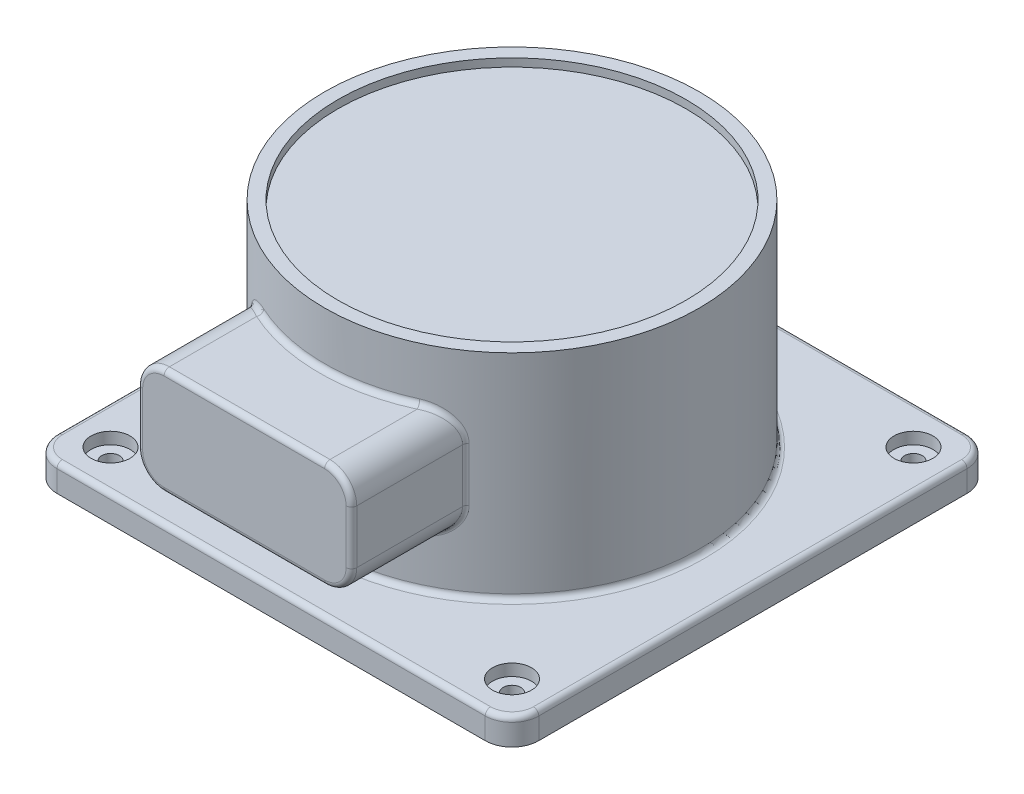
ISO-10303-21;
HEADER;
FILE_DESCRIPTION(('STEP AP214'),'2;1');
FILE_NAME('part.step','',(''),(''),'','','');
FILE_SCHEMA(('AUTOMOTIVE_DESIGN { 1 0 10303 214 1 1 1 1 }'));
ENDSEC;
DATA;
#1=APPLICATION_CONTEXT('core data for automotive mechanical design processes');
#2=APPLICATION_PROTOCOL_DEFINITION('international standard','automotive_design',2000,#1);
#3=PRODUCT_CONTEXT('',#1,'mechanical');
#4=PRODUCT('Part','Part','',(#3));
#5=PRODUCT_RELATED_PRODUCT_CATEGORY('part','',(#4));
#6=PRODUCT_DEFINITION_FORMATION('','',#4);
#7=PRODUCT_DEFINITION_CONTEXT('part definition',#1,'design');
#8=PRODUCT_DEFINITION('design','',#6,#7);
#9=PRODUCT_DEFINITION_SHAPE('','',#8);
#10=(LENGTH_UNIT() NAMED_UNIT(*) SI_UNIT(.MILLI.,.METRE.));
#11=(NAMED_UNIT(*) PLANE_ANGLE_UNIT() SI_UNIT($,.RADIAN.));
#12=(NAMED_UNIT(*) SI_UNIT($,.STERADIAN.) SOLID_ANGLE_UNIT());
#13=UNCERTAINTY_MEASURE_WITH_UNIT(LENGTH_MEASURE(1.E-05),#10,'distance_accuracy_value','');
#14=(GEOMETRIC_REPRESENTATION_CONTEXT(3) GLOBAL_UNCERTAINTY_ASSIGNED_CONTEXT((#13)) GLOBAL_UNIT_ASSIGNED_CONTEXT((#10,
#11,#12)) REPRESENTATION_CONTEXT('',''));
#15=CARTESIAN_POINT('',(0.,0.,0.));
#16=DIRECTION('',(0.,0.,1.));
#17=DIRECTION('',(1.,0.,0.));
#18=AXIS2_PLACEMENT_3D('',#15,#16,#17);
#19=CARTESIAN_POINT('',(0.,90.,0.));
#20=DIRECTION('',(0.,-1.,0.));
#21=DIRECTION('',(0.,0.,-1.));
#22=AXIS2_PLACEMENT_3D('',#19,#20,#21);
#23=CYLINDRICAL_SURFACE('',#22,70.);
#24=CARTESIAN_POINT('',(0.,12.,0.));
#25=DIRECTION('',(0.,-1.,0.));
#26=DIRECTION('',(0.,0.,-1.));
#27=AXIS2_PLACEMENT_3D('',#24,#25,#26);
#28=CIRCLE('',#27,70.);
#29=CARTESIAN_POINT('',(0.,12.,-70.));
#30=VERTEX_POINT('',#29);
#31=EDGE_CURVE('E485',#30,#30,#28,.F.);
#32=ORIENTED_EDGE('',*,*,#31,.T.);
#33=EDGE_LOOP('',(#32));
#34=FACE_BOUND('',#33,.T.);
#35=CARTESIAN_POINT('',(0.,72.,0.));
#36=DIRECTION('',(0.,-1.,0.));
#37=DIRECTION('',(0.,0.,-1.));
#38=AXIS2_PLACEMENT_3D('',#35,#36,#37);
#39=CIRCLE('',#38,70.);
#40=CARTESIAN_POINT('',(-29.1666666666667,72.,63.6341540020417));
#41=VERTEX_POINT('',#40);
#42=CARTESIAN_POINT('',(29.1666666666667,72.,63.6341540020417));
#43=VERTEX_POINT('',#42);
#44=EDGE_CURVE('E489',#41,#43,#39,.F.);
#45=ORIENTED_EDGE('',*,*,#44,.T.);
#46=CARTESIAN_POINT('',(25.1891347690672,71.2810585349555,65.3108527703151));
#47=CARTESIAN_POINT('',(25.8657077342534,69.1379619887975,65.0499116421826));
#48=CARTESIAN_POINT('',(26.5906869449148,69.4008821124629,67.1768771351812));
#49=CARTESIAN_POINT('',(25.5132488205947,71.4019945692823,65.1858780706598));
#50=CARTESIAN_POINT('',(26.1242932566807,69.2558553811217,64.9463455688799));
#51=CARTESIAN_POINT('',(26.8684989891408,69.5016621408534,67.0483317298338));
#52=CARTESIAN_POINT('',(25.8410700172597,71.5075248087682,65.0566439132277));
#53=CARTESIAN_POINT('',(26.389200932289,69.3632700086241,64.8385841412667));
#54=CARTESIAN_POINT('',(27.1494885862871,69.5896040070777,66.9154051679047));
#55=CARTESIAN_POINT('',(26.5013178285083,71.6879129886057,64.7904755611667));
#56=CARTESIAN_POINT('',(26.9276692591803,69.5547588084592,64.615743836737));
#57=CARTESIAN_POINT('',(27.7154152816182,69.7399274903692,66.6416320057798));
#58=CARTESIAN_POINT('',(26.8337418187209,71.7627877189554,64.653545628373));
#59=CARTESIAN_POINT('',(27.2009010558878,69.6390011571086,64.5008413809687));
#60=CARTESIAN_POINT('',(28.0003501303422,69.8023230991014,66.5007897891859));
#61=CARTESIAN_POINT('',(27.499868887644,71.8819791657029,64.3730359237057));
#62=CARTESIAN_POINT('',(27.7535688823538,69.7833272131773,64.2643147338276));
#63=CARTESIAN_POINT('',(28.5713161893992,69.9016493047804,66.2122655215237));
#64=CARTESIAN_POINT('',(27.8335662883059,71.9263758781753,64.2294746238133));
#65=CARTESIAN_POINT('',(28.0326950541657,69.8436766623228,64.1428778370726));
#66=CARTESIAN_POINT('',(28.8573425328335,69.938646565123,66.0646024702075));
#67=CARTESIAN_POINT('',(28.5007941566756,71.9853891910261,63.9361987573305));
#68=CARTESIAN_POINT('',(28.59587793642,69.9399519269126,63.893487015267));
#69=CARTESIAN_POINT('',(29.4292521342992,69.9878243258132,65.7629472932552));
#70=CARTESIAN_POINT('',(28.8343245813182,72.000000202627,63.7864830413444));
#71=CARTESIAN_POINT('',(28.8797020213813,69.976120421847,63.7656845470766));
#72=CARTESIAN_POINT('',(29.7151353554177,70.0000001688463,65.6089539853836));
#73=CARTESIAN_POINT('',(29.5343600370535,71.9999997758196,63.4656216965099));
#74=CARTESIAN_POINT('',(29.4802128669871,70.0260915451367,63.4904397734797));
#75=CARTESIAN_POINT('',(30.3151657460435,69.9999998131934,65.2789251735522));
#76=CARTESIAN_POINT('',(29.900598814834,71.9821146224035,63.2938905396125));
#77=CARTESIAN_POINT('',(29.797372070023,70.0375010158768,63.34233735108));
#78=CARTESIAN_POINT('',(30.6290846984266,69.9850955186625,65.1022874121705));
#79=CARTESIAN_POINT('',(30.6275995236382,71.9114693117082,62.9453157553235));
#80=CARTESIAN_POINT('',(30.4325906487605,70.0294972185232,63.0398506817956));
#81=CARTESIAN_POINT('',(31.2522281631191,69.9262244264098,64.7437533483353));
#82=CARTESIAN_POINT('',(30.988358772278,71.8586926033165,62.7684697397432));
#83=CARTESIAN_POINT('',(30.7504996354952,70.0104793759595,62.8856128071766));
#84=CARTESIAN_POINT('',(31.5614503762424,69.8822438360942,64.5618545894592));
#85=CARTESIAN_POINT('',(31.7019949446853,71.7191804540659,62.4110795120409));
#86=CARTESIAN_POINT('',(31.3844971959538,69.9414389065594,62.5720345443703));
#87=CARTESIAN_POINT('',(32.1731385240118,69.7659837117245,64.1942532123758));
#88=CARTESIAN_POINT('',(32.0548673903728,71.6324262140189,62.2305333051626));
#89=CARTESIAN_POINT('',(31.7005249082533,69.891822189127,62.4128010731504));
#90=CARTESIAN_POINT('',(32.4756006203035,69.6936885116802,64.0085485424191));
#91=CARTESIAN_POINT('',(32.7503900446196,71.4259026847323,61.8673256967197));
#92=CARTESIAN_POINT('',(32.3279589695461,69.7616032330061,62.0906604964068));
#93=CARTESIAN_POINT('',(33.0717628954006,69.5215855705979,63.6349635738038));
#94=CARTESIAN_POINT('',(33.0930364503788,71.3061212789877,61.6846635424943));
#95=CARTESIAN_POINT('',(32.6393920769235,69.6814079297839,61.9278177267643));
#96=CARTESIAN_POINT('',(33.365459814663,69.4217677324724,63.4470825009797));
#97=CARTESIAN_POINT('',(33.7653623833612,71.0346704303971,61.3192165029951));
#98=CARTESIAN_POINT('',(33.2544025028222,69.4903396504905,61.6003252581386));
#99=CARTESIAN_POINT('',(33.9417391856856,69.195558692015,63.0711941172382));
#100=CARTESIAN_POINT('',(34.0950618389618,70.8830524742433,61.1364322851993));
#101=CARTESIAN_POINT('',(33.5580936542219,69.3799148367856,61.435702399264));
#102=CARTESIAN_POINT('',(34.2243387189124,69.0692103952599,62.8831874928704));
#103=CARTESIAN_POINT('',(34.7398954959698,70.5487910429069,60.7723395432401));
#104=CARTESIAN_POINT('',(34.1553097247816,69.1287825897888,61.106297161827));
#105=CARTESIAN_POINT('',(34.7770532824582,68.7906592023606,62.5086921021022));
#106=CARTESIAN_POINT('',(35.0550293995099,70.3661469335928,60.5910310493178));
#107=CARTESIAN_POINT('',(34.449022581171,68.9884329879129,60.9414840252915));
#108=CARTESIAN_POINT('',(35.0471680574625,68.6384557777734,62.322203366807));
#109=CARTESIAN_POINT('',(35.9760906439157,69.7723507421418,60.0518444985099));
#110=CARTESIAN_POINT('',(35.306413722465,68.524773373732,60.4522396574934));
#111=CARTESIAN_POINT('',(35.8366491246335,68.1436256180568,61.7676114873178));
#112=CARTESIAN_POINT('',(36.5579802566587,69.315212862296,59.6985394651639));
#113=CARTESIAN_POINT('',(35.8585936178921,68.1549421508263,60.1264228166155));
#114=CARTESIAN_POINT('',(36.3354116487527,67.7626773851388,61.4042120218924));
#115=CARTESIAN_POINT('',(37.3681328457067,68.5429556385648,59.1922807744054));
#116=CARTESIAN_POINT('',(36.6353752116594,67.5092589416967,59.6547487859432));
#117=CARTESIAN_POINT('',(37.0298281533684,67.1191296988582,60.8834887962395));
#118=CARTESIAN_POINT('',(37.6282599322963,68.2703873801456,59.0271269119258));
#119=CARTESIAN_POINT('',(36.8846805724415,67.280275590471,59.5010546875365));
#120=CARTESIAN_POINT('',(37.252794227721,66.8919894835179,60.7136162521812));
#121=CARTESIAN_POINT('',(38.1250040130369,67.6970191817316,58.7075026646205));
#122=CARTESIAN_POINT('',(37.3619048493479,66.7940699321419,59.2029624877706));
#123=CARTESIAN_POINT('',(37.678574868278,66.4141826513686,60.3848598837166));
#124=CARTESIAN_POINT('',(38.3616182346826,67.396215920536,58.5530335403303));
#125=CARTESIAN_POINT('',(37.5902214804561,66.53693656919,59.0583560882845));
#126=CARTESIAN_POINT('',(37.8813870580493,66.1635132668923,60.2259773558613));
#127=CARTESIAN_POINT('',(38.8079683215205,66.7682250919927,58.258159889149));
#128=CARTESIAN_POINT('',(38.0216911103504,65.9962007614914,58.7818528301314));
#129=CARTESIAN_POINT('',(38.263972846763,65.6401875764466,59.9226787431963));
#130=CARTESIAN_POINT('',(39.0177440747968,66.4410778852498,58.1177345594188));
#131=CARTESIAN_POINT('',(38.2253039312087,65.7126296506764,58.649697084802));
#132=CARTESIAN_POINT('',(38.4437806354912,65.3675649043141,59.7782412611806));
#133=CARTESIAN_POINT('',(39.4076778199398,65.7618036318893,57.8540430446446));
#134=CARTESIAN_POINT('',(38.6042004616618,65.1205956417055,58.401281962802));
#135=CARTESIAN_POINT('',(38.7780095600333,64.8015030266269,59.5070157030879));
#136=CARTESIAN_POINT('',(39.5878504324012,65.4096890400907,57.7307683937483));
#137=CARTESIAN_POINT('',(38.7799275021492,64.8120182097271,58.2847543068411));
#138=CARTESIAN_POINT('',(38.9324432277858,64.5080742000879,59.380218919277));
#139=CARTESIAN_POINT('',(39.8668336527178,64.7906182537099,57.5382934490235));
#140=CARTESIAN_POINT('',(39.0524243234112,64.2668078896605,58.1025595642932));
#141=CARTESIAN_POINT('',(39.1715717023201,63.9921818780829,59.182244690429));
#142=CARTESIAN_POINT('',(39.973944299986,64.5292919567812,57.4638858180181));
#143=CARTESIAN_POINT('',(39.1571593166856,64.0361724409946,58.0320592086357));
#144=CARTESIAN_POINT('',(39.2633808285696,63.7744099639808,59.1057111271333));
#145=CARTESIAN_POINT('',(40.1707152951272,63.996720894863,57.3265037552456));
#146=CARTESIAN_POINT('',(39.3496288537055,63.5651212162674,57.9018554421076));
#147=CARTESIAN_POINT('',(39.4320416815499,63.3306007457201,58.96440386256));
#148=CARTESIAN_POINT('',(40.2603798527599,63.7254785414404,57.2635265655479));
#149=CARTESIAN_POINT('',(39.4375008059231,63.3245862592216,57.8420620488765));
#150=CARTESIAN_POINT('',(39.5088970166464,63.1045654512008,58.8996273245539));
#151=CARTESIAN_POINT('',(40.4210026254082,63.1750893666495,57.1502598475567));
#152=CARTESIAN_POINT('',(39.5949204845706,62.835720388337,57.7345197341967));
#153=CARTESIAN_POINT('',(39.6465736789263,62.6459078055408,58.7831244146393));
#154=CARTESIAN_POINT('',(40.4919994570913,62.8959602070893,57.0999441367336));
#155=CARTESIAN_POINT('',(39.6646221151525,62.5872560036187,57.6866681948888));
#156=CARTESIAN_POINT('',(39.7074281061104,62.4133001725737,58.7313711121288));
#157=CARTESIAN_POINT('',(40.6145401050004,62.3311182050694,57.0128476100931));
#158=CARTESIAN_POINT('',(39.7849008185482,62.083935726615,57.6038574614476));
#159=CARTESIAN_POINT('',(39.8124629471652,61.9425985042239,58.6417861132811));
#160=CARTESIAN_POINT('',(40.6660911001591,62.0454078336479,56.9760617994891));
#161=CARTESIAN_POINT('',(39.8355791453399,61.8289025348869,57.5688293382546));
#162=CARTESIAN_POINT('',(39.8566495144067,61.7045065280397,58.6039492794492));
#163=CARTESIAN_POINT('',(40.7492525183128,61.4676188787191,56.9166149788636));
#164=CARTESIAN_POINT('',(39.9172931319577,61.3128758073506,57.5122513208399));
#165=CARTESIAN_POINT('',(39.9279307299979,61.2230157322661,58.5428039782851));
#166=CARTESIAN_POINT('',(40.7807420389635,61.1755124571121,56.8940396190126));
#167=CARTESIAN_POINT('',(39.9482777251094,61.0516478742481,57.4907362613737));
#168=CARTESIAN_POINT('',(39.9549217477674,60.9795937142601,58.5195836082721));
#169=CARTESIAN_POINT('',(40.8227808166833,60.5889370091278,56.8638834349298));
#170=CARTESIAN_POINT('',(39.9896120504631,60.5270556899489,57.4620176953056));
#171=CARTESIAN_POINT('',(39.9909549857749,60.4907808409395,58.4885658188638));
#172=CARTESIAN_POINT('',(40.8333335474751,60.2944683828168,56.8563001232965));
#173=CARTESIAN_POINT('',(40.0000003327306,60.263471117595,57.454787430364));
#174=CARTESIAN_POINT('',(40.0000001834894,60.2453903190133,58.4807658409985));
#175=CARTESIAN_POINT('',(40.8333331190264,59.7053045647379,56.8563005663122));
#176=CARTESIAN_POINT('',(39.9999996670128,59.7363257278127,57.4547880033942));
#177=CARTESIAN_POINT('',(39.9999998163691,59.7544204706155,58.4807662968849));
#178=CARTESIAN_POINT('',(40.8227636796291,59.4106093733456,56.86389602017));
#179=CARTESIAN_POINT('',(39.9895946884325,59.4725387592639,57.4620299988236));
#180=CARTESIAN_POINT('',(39.9909402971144,59.5088411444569,58.4885787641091));
#181=CARTESIAN_POINT('',(40.7806519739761,58.8234460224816,56.8941039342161));
#182=CARTESIAN_POINT('',(39.9481896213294,58.9474199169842,57.4907972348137));
#183=CARTESIAN_POINT('',(39.9548445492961,59.0195383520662,58.5196497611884));
#184=CARTESIAN_POINT('',(40.7490964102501,58.5309793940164,56.9167259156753));
#185=CARTESIAN_POINT('',(39.9171412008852,58.6858683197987,57.5123560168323));
#186=CARTESIAN_POINT('',(39.9277969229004,58.7758161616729,58.5429180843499));
#187=CARTESIAN_POINT('',(40.6652731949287,57.9492301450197,56.9766471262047));
#188=CARTESIAN_POINT('',(39.8347728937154,58.1663061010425,57.5693880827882));
#189=CARTESIAN_POINT('',(39.8559484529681,58.2910251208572,58.604551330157));
#190=CARTESIAN_POINT('',(40.6128960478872,57.659972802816,57.0140239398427));
#191=CARTESIAN_POINT('',(39.7832770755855,57.9081146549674,57.6049823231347));
#192=CARTESIAN_POINT('',(39.8110537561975,58.0499773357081,58.6429960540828));
#193=CARTESIAN_POINT('',(40.4883278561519,57.0885074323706,57.1025457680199));
#194=CARTESIAN_POINT('',(39.661023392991,57.3988970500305,57.6891387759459));
#195=CARTESIAN_POINT('',(39.7042810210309,57.5737561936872,58.7340470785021));
#196=CARTESIAN_POINT('',(40.4161518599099,56.8062942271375,57.153680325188));
#197=CARTESIAN_POINT('',(39.590182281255,57.1476793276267,57.7377577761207));
#198=CARTESIAN_POINT('',(39.6424158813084,57.3385785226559,58.7866426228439));
#199=CARTESIAN_POINT('',(40.3344829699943,56.5285157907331,57.2112705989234));
#200=CARTESIAN_POINT('',(39.5102548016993,56.9014161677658,57.7923591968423));
#201=CARTESIAN_POINT('',(39.5724139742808,57.1070964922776,58.8458783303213));
#202=(BOUNDED_SURFACE() B_SPLINE_SURFACE(3,2,((#46,#47,#48),(#49,#50,#51),(#52,#53,#54),(#55,
#56,#57),(#58,#59,#60),(#61,#62,#63),(#64,#65,#66),(#67,#68,#69),(#70,#71,#72),(#73,#74,#75),
(#76,#77,#78),(#79,#80,#81),(#82,#83,#84),(#85,#86,#87),(#88,#89,#90),(#91,#92,#93),(#94,#95,
#96),(#97,#98,#99),(#100,#101,#102),(#103,#104,#105),(#106,#107,#108),(#109,#110,#111),(#112,
#113,#114),(#115,#116,#117),(#118,#119,#120),(#121,#122,#123),(#124,#125,#126),(#127,#128,#129),
(#130,#131,#132),(#133,#134,#135),(#136,#137,#138),(#139,#140,#141),(#142,#143,#144),(#145,#146,
#147),(#148,#149,#150),(#151,#152,#153),(#154,#155,#156),(#157,#158,#159),(#160,#161,#162),
(#163,#164,#165),(#166,#167,#168),(#169,#170,#171),(#172,#173,#174),(#175,#176,#177),(#178,#179,
#180),(#181,#182,#183),(#184,#185,#186),(#187,#188,#189),(#190,#191,#192),(#193,#194,#195),
(#196,#197,#198),(#199,#200,#201)),.UNSPECIFIED.,.F.,.F.,.F.) B_SPLINE_SURFACE_WITH_KNOTS((4,2,
2,2,2,2,2,2,2,2,2,2,2,2,2,2,2,2,2,2,2,2,2,2,2,4),(3,3),(0.,1.13116551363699,2.26171065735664,
3.38927698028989,4.51705485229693,5.76479465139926,7.01312675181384,8.26215051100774,
9.5116331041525,10.7591103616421,12.0066131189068,14.5005052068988,15.7532012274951,
17.0060447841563,18.2570041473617,19.5073438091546,20.3877258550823,21.2678951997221,
22.1462292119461,23.024238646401,23.9074906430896,24.7905960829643,25.6743824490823,
26.5587293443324,27.4477896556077,28.3361760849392),(0.,1.),
.UNSPECIFIED.) GEOMETRIC_REPRESENTATION_ITEM() RATIONAL_B_SPLINE_SURFACE(((1.,0.662313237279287,
1.),(1.,0.66548929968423,1.),(1.,0.668827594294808,1.),(1.,0.675795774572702,1.),(1.,
0.6794254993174,1.),(1.,0.686937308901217,1.),(1.,0.690818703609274,1.),(1.,0.698805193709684,
1.),(1.,0.702910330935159,1.),(1.,0.711749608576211,1.),(1.,0.716504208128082,1.),(1.,
0.726179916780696,1.),(1.,0.731101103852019,1.),(1.,0.741050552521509,1.),(1.,0.746078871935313,
1.),(1.,0.756180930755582,1.),(1.,0.7612546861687,1.),(1.,0.771377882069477,1.),(1.,
0.776427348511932,1.),(1.,0.786447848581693,1.),(1.,0.791418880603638,1.),(1.,0.806133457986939,
1.),(1.,0.815683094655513,1.),(1.,0.829223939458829,1.),(1.,0.833616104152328,1.),(1.,
0.84207137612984,1.),(1.,0.846134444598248,1.),(1.,0.85385100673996,1.),(1.,0.857505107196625,
1.),(1.,0.864334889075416,1.),(1.,0.867510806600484,1.),(1.,0.872449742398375,1.),(1.,
0.874352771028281,1.),(1.,0.877857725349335,1.),(1.,0.879459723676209,1.),(1.,0.882335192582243,
1.),(1.,0.883609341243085,1.),(1.,0.885811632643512,1.),(1.,0.886739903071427,1.),(1.,
0.888238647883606,1.),(1.,0.888806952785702,1.),(1.,0.889565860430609,1.),(1.,0.889756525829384,
1.),(1.,0.889756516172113,1.),(1.,0.889565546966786,1.),(1.,0.888805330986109,1.),(1.,
0.888235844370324,1.),(1.,0.886725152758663,1.),(1.,0.88578198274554,1.),(1.,0.883543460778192,
1.),(1.,0.882248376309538,1.),(1.,0.880786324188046,1.))) REPRESENTATION_ITEM('') SURFACE());
#203=CARTESIAN_POINT('',(25.1891347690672,71.2810585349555,65.3108527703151));
#204=CARTESIAN_POINT('',(25.5132488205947,71.4019945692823,65.1858780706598));
#205=CARTESIAN_POINT('',(25.8410700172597,71.5075248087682,65.0566439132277));
#206=CARTESIAN_POINT('',(26.5013178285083,71.6879129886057,64.7904755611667));
#207=CARTESIAN_POINT('',(26.8337418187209,71.7627877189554,64.653545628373));
#208=CARTESIAN_POINT('',(27.499868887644,71.8819791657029,64.3730359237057));
#209=CARTESIAN_POINT('',(27.8335662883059,71.9263758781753,64.2294746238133));
#210=CARTESIAN_POINT('',(28.5007941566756,71.9853891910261,63.9361987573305));
#211=CARTESIAN_POINT('',(28.8343245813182,72.000000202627,63.7864830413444));
#212=CARTESIAN_POINT('',(29.5343600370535,71.9999997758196,63.4656216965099));
#213=CARTESIAN_POINT('',(29.900598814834,71.9821146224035,63.2938905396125));
#214=CARTESIAN_POINT('',(30.6275995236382,71.9114693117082,62.9453157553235));
#215=CARTESIAN_POINT('',(30.988358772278,71.8586926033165,62.7684697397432));
#216=CARTESIAN_POINT('',(31.7019949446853,71.7191804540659,62.4110795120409));
#217=CARTESIAN_POINT('',(32.0548673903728,71.6324262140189,62.2305333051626));
#218=CARTESIAN_POINT('',(32.7503900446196,71.4259026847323,61.8673256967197));
#219=CARTESIAN_POINT('',(33.0930364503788,71.3061212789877,61.6846635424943));
#220=CARTESIAN_POINT('',(33.7653623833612,71.0346704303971,61.3192165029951));
#221=CARTESIAN_POINT('',(34.0950618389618,70.8830524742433,61.1364322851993));
#222=CARTESIAN_POINT('',(34.7398954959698,70.5487910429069,60.7723395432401));
#223=CARTESIAN_POINT('',(35.0550293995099,70.3661469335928,60.5910310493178));
#224=CARTESIAN_POINT('',(35.9760906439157,69.7723507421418,60.0518444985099));
#225=CARTESIAN_POINT('',(36.5579802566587,69.315212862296,59.6985394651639));
#226=CARTESIAN_POINT('',(37.3681328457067,68.5429556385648,59.1922807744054));
#227=CARTESIAN_POINT('',(37.6282599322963,68.2703873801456,59.0271269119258));
#228=CARTESIAN_POINT('',(38.1250040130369,67.6970191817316,58.7075026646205));
#229=CARTESIAN_POINT('',(38.3616182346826,67.3962159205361,58.5530335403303));
#230=CARTESIAN_POINT('',(38.8079683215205,66.7682250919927,58.258159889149));
#231=CARTESIAN_POINT('',(39.0177440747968,66.4410778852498,58.1177345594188));
#232=CARTESIAN_POINT('',(39.4076778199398,65.7618036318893,57.8540430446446));
#233=CARTESIAN_POINT('',(39.5878504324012,65.4096890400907,57.7307683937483));
#234=CARTESIAN_POINT('',(39.8668336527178,64.7906182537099,57.5382934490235));
#235=CARTESIAN_POINT('',(39.973944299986,64.5292919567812,57.4638858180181));
#236=CARTESIAN_POINT('',(40.1707152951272,63.996720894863,57.3265037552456));
#237=CARTESIAN_POINT('',(40.2603798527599,63.7254785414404,57.2635265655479));
#238=CARTESIAN_POINT('',(40.4210026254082,63.1750893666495,57.1502598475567));
#239=CARTESIAN_POINT('',(40.4919994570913,62.8959602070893,57.0999441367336));
#240=CARTESIAN_POINT('',(40.6145401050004,62.3311182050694,57.0128476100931));
#241=CARTESIAN_POINT('',(40.6660911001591,62.0454078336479,56.9760617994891));
#242=CARTESIAN_POINT('',(40.7492525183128,61.4676188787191,56.9166149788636));
#243=CARTESIAN_POINT('',(40.7807420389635,61.1755124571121,56.8940396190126));
#244=CARTESIAN_POINT('',(40.8227808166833,60.5889370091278,56.8638834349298));
#245=CARTESIAN_POINT('',(40.8333335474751,60.2944683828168,56.8563001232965));
#246=CARTESIAN_POINT('',(40.8333331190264,59.7053045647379,56.8563005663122));
#247=CARTESIAN_POINT('',(40.8227636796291,59.4106093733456,56.86389602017));
#248=CARTESIAN_POINT('',(40.7806519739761,58.8234460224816,56.8941039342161));
#249=CARTESIAN_POINT('',(40.7490964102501,58.5309793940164,56.9167259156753));
#250=CARTESIAN_POINT('',(40.6652731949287,57.9492301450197,56.9766471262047));
#251=CARTESIAN_POINT('',(40.6128960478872,57.659972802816,57.0140239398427));
#252=CARTESIAN_POINT('',(40.4883278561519,57.0885074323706,57.1025457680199));
#253=CARTESIAN_POINT('',(40.4161518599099,56.8062942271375,57.153680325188));
#254=CARTESIAN_POINT('',(40.3344829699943,56.5285157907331,57.2112705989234));
#255=B_SPLINE_CURVE_WITH_KNOTS('',3,(#203,#204,#205,#206,#207,#208,#209,#210,#211,#212,#213,
#214,#215,#216,#217,#218,#219,#220,#221,#222,#223,#224,#225,#226,#227,#228,#229,#230,#231,#232,
#233,#234,#235,#236,#237,#238,#239,#240,#241,#242,#243,#244,#245,#246,#247,#248,#249,#250,#251,
#252,#253,#254),.UNSPECIFIED.,.F.,.F.,(4,2,2,2,2,2,2,2,2,2,2,2,2,2,2,2,2,2,2,2,2,2,2,2,2,4),(0.,
1.13116551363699,2.26171065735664,3.38927698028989,4.51705485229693,5.76479465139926,
7.01312675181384,8.26215051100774,9.5116331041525,10.7591103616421,12.0066131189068,
14.5005052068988,15.7532012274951,17.0060447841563,18.2570041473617,19.5073438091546,
20.3877258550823,21.2678951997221,22.1462292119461,23.024238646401,23.9074906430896,
24.7905960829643,25.6743824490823,26.5587293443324,27.4477896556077,28.3361760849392),.UNSPECIFIED.);
#256=CARTESIAN_POINT('',(40.8333333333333,60.,56.856300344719));
#257=VERTEX_POINT('',#256);
#258=EDGE_CURVE('E776',#43,#257,#255,.T.);
#259=ORIENTED_EDGE('',*,*,#258,.T.);
#260=DIRECTION('',(0.,-1.,0.));
#261=VECTOR('',#260,1.);
#262=CARTESIAN_POINT('',(40.8333333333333,90.,56.856300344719));
#263=LINE('',#262,#261);
#264=CARTESIAN_POINT('',(40.8333333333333,40.,56.856300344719));
#265=VERTEX_POINT('',#264);
#266=EDGE_CURVE('E782',#257,#265,#263,.T.);
#267=ORIENTED_EDGE('',*,*,#266,.T.);
#268=CARTESIAN_POINT('',(40.3344829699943,43.4714842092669,57.2112705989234));
#269=CARTESIAN_POINT('',(39.5102548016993,43.0985838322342,57.7923591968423));
#270=CARTESIAN_POINT('',(39.5724139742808,42.8929035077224,58.8458783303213));
#271=CARTESIAN_POINT('',(40.4160610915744,43.1940134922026,57.1537443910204));
#272=CARTESIAN_POINT('',(39.5900934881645,42.8525929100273,57.7378184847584));
#273=CARTESIAN_POINT('',(39.6423380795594,42.6616779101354,58.786708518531));
#274=CARTESIAN_POINT('',(40.4881675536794,42.9121186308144,57.1026593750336));
#275=CARTESIAN_POINT('',(39.6608662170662,42.6016593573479,57.689246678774));
#276=CARTESIAN_POINT('',(39.7041436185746,42.4267655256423,58.7341639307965));
#277=CARTESIAN_POINT('',(40.6126138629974,42.3414303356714,57.0142248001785));
#278=CARTESIAN_POINT('',(39.7830002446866,42.0931355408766,57.6051731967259));
#279=CARTESIAN_POINT('',(39.8108118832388,41.9511919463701,58.6432026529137));
#280=CARTESIAN_POINT('',(40.6649475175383,42.0526347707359,56.9768795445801));
#281=CARTESIAN_POINT('',(39.8344530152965,41.8353577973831,57.5696091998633));
#282=CARTESIAN_POINT('',(39.8556693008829,41.7105289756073,58.6047903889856));
#283=CARTESIAN_POINT('',(40.7488612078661,41.4710444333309,56.9168944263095));
#284=CARTESIAN_POINT('',(39.9169098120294,41.3159411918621,57.5125165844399));
#285=CARTESIAN_POINT('',(39.9275953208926,41.2258703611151,58.5430914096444));
#286=CARTESIAN_POINT('',(40.7804960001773,41.1782623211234,56.8942157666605));
#287=CARTESIAN_POINT('',(39.9480362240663,41.054107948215,57.4909037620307));
#288=CARTESIAN_POINT('',(39.9547108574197,40.9818852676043,58.5197647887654));
#289=CARTESIAN_POINT('',(40.8227302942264,40.5903201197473,56.8639200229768));
#290=CARTESIAN_POINT('',(39.9895617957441,40.528293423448,57.4620529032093));
#291=CARTESIAN_POINT('',(39.9909116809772,40.491933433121,58.4886034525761));
#292=CARTESIAN_POINT('',(40.8333331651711,40.2951604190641,56.8563005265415));
#293=CARTESIAN_POINT('',(39.9999997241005,40.2640903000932,57.4547879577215));
#294=CARTESIAN_POINT('',(39.9999998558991,40.2459670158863,58.4807662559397));
#295=CARTESIAN_POINT('',(40.8333335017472,39.7043979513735,56.8563001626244));
#296=CARTESIAN_POINT('',(40.0000002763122,39.7355145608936,57.4547874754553));
#297=CARTESIAN_POINT('',(40.0000001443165,39.7536649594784,58.480765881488));
#298=CARTESIAN_POINT('',(40.8226992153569,39.4087951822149,56.8639421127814));
#299=CARTESIAN_POINT('',(39.9895316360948,39.4709139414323,57.4620736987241));
#300=CARTESIAN_POINT('',(39.9908850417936,39.5073293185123,58.488626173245));
#301=CARTESIAN_POINT('',(40.7803395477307,38.8200138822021,56.8943282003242));
#302=CARTESIAN_POINT('',(39.9478818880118,38.944350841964,57.4910111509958));
#303=CARTESIAN_POINT('',(39.9545767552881,39.0166782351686,58.5198804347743));
#304=CARTESIAN_POINT('',(40.7486130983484,38.5268354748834,56.9170731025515));
#305=CARTESIAN_POINT('',(39.9166640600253,38.6821652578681,57.5126878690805));
#306=CARTESIAN_POINT('',(39.9273826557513,38.7723628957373,58.5432751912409));
#307=CARTESIAN_POINT('',(40.6645949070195,37.9453250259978,56.9771302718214));
#308=CARTESIAN_POINT('',(39.8341083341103,38.1628197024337,57.5698467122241));
#309=CARTESIAN_POINT('',(39.8553670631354,38.2877708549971,58.6050482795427));
#310=CARTESIAN_POINT('',(40.612309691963,37.6569914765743,57.0144379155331));
#311=CARTESIAN_POINT('',(39.7827080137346,37.9054501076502,57.6053718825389));
#312=CARTESIAN_POINT('',(39.8105511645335,38.0474928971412,58.6434218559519));
#313=CARTESIAN_POINT('',(40.48797251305,37.0871712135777,57.1028010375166));
#314=CARTESIAN_POINT('',(39.6606687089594,37.3977175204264,57.689385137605));
#315=CARTESIAN_POINT('',(39.7039764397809,37.5726426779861,58.7343096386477));
#316=CARTESIAN_POINT('',(40.4159206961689,36.8056844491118,57.1538564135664));
#317=CARTESIAN_POINT('',(39.5899325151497,37.1471699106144,57.7379394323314));
#318=CARTESIAN_POINT('',(39.6422177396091,37.3380703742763,58.7868237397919));
#319=CARTESIAN_POINT('',(40.2534546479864,36.2527405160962,57.2683961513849));
#320=CARTESIAN_POINT('',(39.4307154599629,36.6560892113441,57.8466844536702));
#321=CARTESIAN_POINT('',(39.5029611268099,36.8772837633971,58.9046360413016));
#322=CARTESIAN_POINT('',(40.1631345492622,35.9812400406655,57.3318167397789));
#323=CARTESIAN_POINT('',(39.3422055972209,36.4153543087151,57.906895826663));
#324=CARTESIAN_POINT('',(39.4255438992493,36.6510333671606,58.969868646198));
#325=CARTESIAN_POINT('',(39.9650216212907,35.4482140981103,57.4700934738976));
#326=CARTESIAN_POINT('',(39.1484352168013,35.9439590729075,58.0379406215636));
#327=CARTESIAN_POINT('',(39.2557328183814,36.206845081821,59.1120961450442));
#328=CARTESIAN_POINT('',(39.8572224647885,35.186692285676,57.5449537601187));
#329=CARTESIAN_POINT('',(39.0430342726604,35.7131812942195,58.1088658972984));
#330=CARTESIAN_POINT('',(39.1633335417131,35.9889102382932,59.1890952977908));
#331=CARTESIAN_POINT('',(39.5092720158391,34.4188543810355,57.7849180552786));
#332=CARTESIAN_POINT('',(38.7027309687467,35.0361585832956,58.3363087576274));
#333=CARTESIAN_POINT('',(38.8650903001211,35.3490453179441,59.4359157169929));
#334=CARTESIAN_POINT('',(39.2445286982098,33.9291352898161,57.9654333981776));
#335=CARTESIAN_POINT('',(38.444398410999,34.6077641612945,58.5070179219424));
#336=CARTESIAN_POINT('',(38.638167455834,34.9409460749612,59.6215886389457));
#337=CARTESIAN_POINT('',(38.6344666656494,32.9625837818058,58.3739962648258));
#338=CARTESIAN_POINT('',(37.8525651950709,33.76901400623,58.8913686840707));
#339=CARTESIAN_POINT('',(38.1152571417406,34.1354864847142,60.041824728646));
#340=CARTESIAN_POINT('',(38.2842460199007,32.4902935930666,58.6047635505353));
#341=CARTESIAN_POINT('',(37.5134091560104,33.3634010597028,59.1080804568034));
#342=CARTESIAN_POINT('',(37.8150680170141,33.7419113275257,60.279185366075));
#343=CARTESIAN_POINT('',(37.5284425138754,31.6111531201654,59.0916096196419));
#344=CARTESIAN_POINT('',(36.7871016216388,32.6173813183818,59.562238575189));
#345=CARTESIAN_POINT('',(37.167236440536,33.0092942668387,60.7799413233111));
#346=CARTESIAN_POINT('',(37.1228437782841,31.2043216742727,59.3476956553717));
#347=CARTESIAN_POINT('',(36.3985059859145,32.2773116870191,59.8004404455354));
#348=CARTESIAN_POINT('',(36.8195803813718,32.6702680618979,61.0433441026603));
#349=CARTESIAN_POINT('',(36.1891611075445,30.393341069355,59.9224077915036));
#350=CARTESIAN_POINT('',(35.5102575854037,31.6094124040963,60.332055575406));
#351=CARTESIAN_POINT('',(36.019280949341,31.9944508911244,61.6344765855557));
#352=CARTESIAN_POINT('',(35.65210006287,30.002382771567,60.2440862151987));
#353=CARTESIAN_POINT('',(35.0028759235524,31.2967623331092,60.6276268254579));
#354=CARTESIAN_POINT('',(35.558942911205,31.6686523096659,61.9653458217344));
#355=CARTESIAN_POINT('',(34.5260197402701,29.3198653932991,60.8964582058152));
#356=CARTESIAN_POINT('',(33.9514698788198,30.7667380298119,61.2216947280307));
#357=CARTESIAN_POINT('',(34.5937312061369,31.099887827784,62.6363570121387));
#358=CARTESIAN_POINT('',(33.936959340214,29.0283858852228,61.2271587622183));
#359=CARTESIAN_POINT('',(33.406066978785,30.551387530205,61.5205453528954));
#360=CARTESIAN_POINT('',(34.0888222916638,30.8569882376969,62.9765061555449));
#361=CARTESIAN_POINT('',(32.6694376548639,28.5307532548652,61.913373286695));
#362=CARTESIAN_POINT('',(32.2470333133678,30.2037163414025,62.1354714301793));
#363=CARTESIAN_POINT('',(33.0023751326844,30.4422943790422,63.682326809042));
#364=CARTESIAN_POINT('',(31.9875958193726,28.333331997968,62.2687472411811));
#365=CARTESIAN_POINT('',(31.6318983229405,30.0826731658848,62.4501947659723));
#366=CARTESIAN_POINT('',(32.4179392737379,30.2777766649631,64.0478543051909));
#367=CARTESIAN_POINT('',(30.9430269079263,28.1343079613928,62.7907799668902));
#368=CARTESIAN_POINT('',(30.7105668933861,29.9867913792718,62.9050615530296));
#369=CARTESIAN_POINT('',(31.5225944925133,30.1119233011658,64.5848022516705));
#370=CARTESIAN_POINT('',(30.5911698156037,28.0841511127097,62.9629680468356));
#371=CARTESIAN_POINT('',(30.4007276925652,29.9693830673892,63.0551620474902));
#372=CARTESIAN_POINT('',(31.22100269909,30.0701259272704,64.7619099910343));
#373=CARTESIAN_POINT('',(29.8822208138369,28.0170055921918,63.3025023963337));
#374=CARTESIAN_POINT('',(29.7815727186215,29.9630851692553,63.3497096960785));
#375=CARTESIAN_POINT('',(30.6133321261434,30.0141713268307,65.1111453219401));
#376=CARTESIAN_POINT('',(29.5251313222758,28.0000020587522,63.4698508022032));
#377=CARTESIAN_POINT('',(29.4723959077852,29.9745614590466,63.4940216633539));
#378=CARTESIAN_POINT('',(30.3072554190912,30.0000017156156,65.2832751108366));
#379=CARTESIAN_POINT('',(28.8343296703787,27.9999980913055,63.7864815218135));
#380=CARTESIAN_POINT('',(28.8797039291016,30.0238770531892,63.7656846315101));
#381=CARTESIAN_POINT('',(29.7151397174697,29.9999984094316,65.6089524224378));
#382=CARTESIAN_POINT('',(28.5008106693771,28.0146095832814,63.9361915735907));
#383=CARTESIAN_POINT('',(28.5958913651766,30.0600456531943,63.8934812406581));
#384=CARTESIAN_POINT('',(29.4292662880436,30.0121746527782,65.7629399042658));
#385=CARTESIAN_POINT('',(27.8335937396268,28.0736214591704,64.2294624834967));
#386=CARTESIAN_POINT('',(28.032718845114,30.1563193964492,64.1428671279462));
#387=CARTESIAN_POINT('',(28.8573660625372,30.0613512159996,66.0645899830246));
#388=CARTESIAN_POINT('',(27.4998958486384,28.1180170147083,64.3730243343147));
#389=CARTESIAN_POINT('',(27.7535915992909,30.2166677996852,64.2643048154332));
#390=CARTESIAN_POINT('',(28.5713392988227,30.0983475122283,66.212253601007));
#391=CARTESIAN_POINT('',(26.8337598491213,28.2372080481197,64.6535382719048));
#392=CARTESIAN_POINT('',(27.2009155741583,30.3609940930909,64.5008353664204));
#393=CARTESIAN_POINT('',(28.0003655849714,30.1976733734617,66.500782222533));
#394=CARTESIAN_POINT('',(26.501327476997,28.3120843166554,64.7904717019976));
#395=CARTESIAN_POINT('',(26.9276769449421,30.4452383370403,64.6157406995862));
#396=CARTESIAN_POINT('',(27.7154235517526,30.2600702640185,66.6416280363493));
#397=CARTESIAN_POINT('',(25.8410710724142,28.492474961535,65.0566434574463));
#398=CARTESIAN_POINT('',(26.3892019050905,30.6367297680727,64.8385836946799));
#399=CARTESIAN_POINT('',(27.1494894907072,30.4103958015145,66.915404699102));
#400=CARTESIAN_POINT('',(25.5132495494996,28.5980053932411,65.1858777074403));
#401=CARTESIAN_POINT('',(26.1242940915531,30.7441446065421,64.9463451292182));
#402=CARTESIAN_POINT('',(26.8684996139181,30.4983378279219,67.0483313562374));
#403=CARTESIAN_POINT('',(25.1891347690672,28.7189414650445,65.3108527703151));
#404=CARTESIAN_POINT('',(25.8657077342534,30.8620380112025,65.0499116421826));
#405=CARTESIAN_POINT('',(26.5906869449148,30.5991178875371,67.1768771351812));
#406=(BOUNDED_SURFACE() B_SPLINE_SURFACE(3,2,((#268,#269,#270),(#271,#272,#273),(#274,#275,
#276),(#277,#278,#279),(#280,#281,#282),(#283,#284,#285),(#286,#287,#288),(#289,#290,#291),
(#292,#293,#294),(#295,#296,#297),(#298,#299,#300),(#301,#302,#303),(#304,#305,#306),(#307,#308,
#309),(#310,#311,#312),(#313,#314,#315),(#316,#317,#318),(#319,#320,#321),(#322,#323,#324),
(#325,#326,#327),(#328,#329,#330),(#331,#332,#333),(#334,#335,#336),(#337,#338,#339),(#340,#341,
#342),(#343,#344,#345),(#346,#347,#348),(#349,#350,#351),(#352,#353,#354),(#355,#356,#357),
(#358,#359,#360),(#361,#362,#363),(#364,#365,#366),(#367,#368,#369),(#370,#371,#372),(#373,#374,
#375),(#376,#377,#378),(#379,#380,#381),(#382,#383,#384),(#385,#386,#387),(#388,#389,#390),
(#391,#392,#393),(#394,#395,#396),(#397,#398,#399),(#400,#401,#402),(#403,#404,#405)),
.UNSPECIFIED.,.F.,.F.,.F.) B_SPLINE_SURFACE_WITH_KNOTS((4,2,2,2,2,2,2,2,2,2,2,2,2,2,2,2,2,2,2,2,
2,2,4),(3,3),(0.,0.887401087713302,1.77507987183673,2.66040080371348,3.54557990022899,
4.43208343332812,5.31863186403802,6.20489906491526,7.09115967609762,7.97296487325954,
8.85508999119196,10.6189262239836,12.5310041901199,14.4436314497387,16.6944085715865,
18.946981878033,21.3804482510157,22.5974035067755,23.8138131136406,24.9415614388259,
26.069126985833,27.1997008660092,28.3308679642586),(0.,1.),
.UNSPECIFIED.) GEOMETRIC_REPRESENTATION_ITEM() RATIONAL_B_SPLINE_SURFACE(((1.,0.880786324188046,
1.),(1.,0.882246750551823,1.),(1.,0.883540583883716,1.),(1.,0.88577690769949,1.),(1.,
0.886719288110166,1.),(1.,0.888231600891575,1.),(1.,0.888802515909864,1.),(1.,0.889564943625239,
1.),(1.,0.8897565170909,1.),(1.,0.88975652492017,1.),(1.,0.88956438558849,1.),(1.,
0.888799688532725,1.),(1.,0.88822711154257,1.),(1.,0.886712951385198,1.),(1.,0.885771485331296,
1.),(1.,0.883537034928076,1.),(1.,0.882244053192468,1.),(1.,0.879335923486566,1.),(1.,
0.877722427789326,1.),(1.,0.874194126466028,1.),(1.,0.872279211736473,1.),(1.,0.866120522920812,
1.),(1.,0.86146210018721,1.),(1.,0.850833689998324,1.),(1.,0.844786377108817,1.),(1.,
0.831912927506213,1.),(1.,0.825086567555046,1.),(1.,0.809634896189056,1.),(1.,0.800904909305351,
1.),(1.,0.783053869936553,1.),(1.,0.773932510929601,1.),(1.,0.754913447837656,1.),(1.,
0.745012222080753,1.),(1.,0.730480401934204,1.),(1.,0.72568937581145,1.),(1.,0.716265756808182,
1.),(1.,0.711633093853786,1.),(1.,0.702910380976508,1.),(1.,0.698805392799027,1.),(1.,
0.690819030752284,1.),(1.,0.686937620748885,1.),(1.,0.679425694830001,1.),(1.,0.675795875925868,
1.),(1.,0.668827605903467,1.),(1.,0.665489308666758,1.),(1.,0.662313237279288,1.))) REPRESENTATION_ITEM('') SURFACE());
#407=CARTESIAN_POINT('',(40.3344829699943,43.4714842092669,57.2112705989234));
#408=CARTESIAN_POINT('',(40.4160610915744,43.1940134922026,57.1537443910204));
#409=CARTESIAN_POINT('',(40.4881675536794,42.9121186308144,57.1026593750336));
#410=CARTESIAN_POINT('',(40.6126138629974,42.3414303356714,57.0142248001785));
#411=CARTESIAN_POINT('',(40.6649475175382,42.0526347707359,56.9768795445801));
#412=CARTESIAN_POINT('',(40.7488612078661,41.4710444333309,56.9168944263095));
#413=CARTESIAN_POINT('',(40.7804960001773,41.1782623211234,56.8942157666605));
#414=CARTESIAN_POINT('',(40.8227302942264,40.5903201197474,56.8639200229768));
#415=CARTESIAN_POINT('',(40.8333331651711,40.2951604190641,56.8563005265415));
#416=CARTESIAN_POINT('',(40.8333335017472,39.7043979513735,56.8563001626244));
#417=CARTESIAN_POINT('',(40.8226992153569,39.4087951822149,56.8639421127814));
#418=CARTESIAN_POINT('',(40.7803395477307,38.8200138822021,56.8943282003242));
#419=CARTESIAN_POINT('',(40.7486130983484,38.5268354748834,56.9170731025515));
#420=CARTESIAN_POINT('',(40.6645949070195,37.9453250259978,56.9771302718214));
#421=CARTESIAN_POINT('',(40.612309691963,37.6569914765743,57.0144379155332));
#422=CARTESIAN_POINT('',(40.48797251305,37.0871712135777,57.1028010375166));
#423=CARTESIAN_POINT('',(40.4159206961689,36.8056844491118,57.1538564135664));
#424=CARTESIAN_POINT('',(40.2534546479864,36.2527405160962,57.2683961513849));
#425=CARTESIAN_POINT('',(40.1631345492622,35.9812400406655,57.3318167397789));
#426=CARTESIAN_POINT('',(39.9650216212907,35.4482140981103,57.4700934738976));
#427=CARTESIAN_POINT('',(39.8572224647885,35.186692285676,57.5449537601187));
#428=CARTESIAN_POINT('',(39.5092720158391,34.4188543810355,57.7849180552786));
#429=CARTESIAN_POINT('',(39.2445286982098,33.9291352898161,57.9654333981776));
#430=CARTESIAN_POINT('',(38.6344666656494,32.9625837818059,58.3739962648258));
#431=CARTESIAN_POINT('',(38.2842460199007,32.4902935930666,58.6047635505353));
#432=CARTESIAN_POINT('',(37.5284425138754,31.6111531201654,59.0916096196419));
#433=CARTESIAN_POINT('',(37.1228437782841,31.2043216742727,59.3476956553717));
#434=CARTESIAN_POINT('',(36.1891611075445,30.393341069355,59.9224077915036));
#435=CARTESIAN_POINT('',(35.65210006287,30.002382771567,60.2440862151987));
#436=CARTESIAN_POINT('',(34.5260197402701,29.3198653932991,60.8964582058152));
#437=CARTESIAN_POINT('',(33.936959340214,29.0283858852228,61.2271587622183));
#438=CARTESIAN_POINT('',(32.6694376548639,28.5307532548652,61.913373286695));
#439=CARTESIAN_POINT('',(31.9875958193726,28.333331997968,62.2687472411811));
#440=CARTESIAN_POINT('',(30.9430269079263,28.1343079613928,62.7907799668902));
#441=CARTESIAN_POINT('',(30.5911698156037,28.0841511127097,62.9629680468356));
#442=CARTESIAN_POINT('',(29.8822208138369,28.0170055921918,63.3025023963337));
#443=CARTESIAN_POINT('',(29.5251313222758,28.0000020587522,63.4698508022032));
#444=CARTESIAN_POINT('',(28.8343296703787,27.9999980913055,63.7864815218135));
#445=CARTESIAN_POINT('',(28.5008106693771,28.0146095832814,63.9361915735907));
#446=CARTESIAN_POINT('',(27.8335937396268,28.0736214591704,64.2294624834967));
#447=CARTESIAN_POINT('',(27.4998958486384,28.1180170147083,64.3730243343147));
#448=CARTESIAN_POINT('',(26.8337598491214,28.2372080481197,64.6535382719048));
#449=CARTESIAN_POINT('',(26.501327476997,28.3120843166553,64.7904717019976));
#450=CARTESIAN_POINT('',(25.8410710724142,28.492474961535,65.0566434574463));
#451=CARTESIAN_POINT('',(25.5132495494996,28.5980053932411,65.1858777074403));
#452=CARTESIAN_POINT('',(25.1891347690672,28.7189414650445,65.3108527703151));
#453=B_SPLINE_CURVE_WITH_KNOTS('',3,(#407,#408,#409,#410,#411,#412,#413,#414,#415,#416,#417,
#418,#419,#420,#421,#422,#423,#424,#425,#426,#427,#428,#429,#430,#431,#432,#433,#434,#435,#436,
#437,#438,#439,#440,#441,#442,#443,#444,#445,#446,#447,#448,#449,#450,#451,#452),.UNSPECIFIED.,
.F.,.F.,(4,2,2,2,2,2,2,2,2,2,2,2,2,2,2,2,2,2,2,2,2,2,4),(0.,0.887401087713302,1.77507987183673,
2.66040080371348,3.54557990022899,4.43208343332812,5.31863186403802,6.20489906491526,
7.09115967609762,7.97296487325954,8.85508999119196,10.6189262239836,12.5310041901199,
14.4436314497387,16.6944085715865,18.946981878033,21.3804482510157,22.5974035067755,
23.8138131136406,24.9415614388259,26.069126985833,27.1997008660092,28.3308679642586),.UNSPECIFIED.);
#454=CARTESIAN_POINT('',(29.1666666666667,28.,63.6341540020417));
#455=VERTEX_POINT('',#454);
#456=EDGE_CURVE('E868',#265,#455,#453,.T.);
#457=ORIENTED_EDGE('',*,*,#456,.T.);
#458=CARTESIAN_POINT('',(0.,28.,0.));
#459=DIRECTION('',(0.,1.,0.));
#460=DIRECTION('',(-1.,0.,0.));
#461=AXIS2_PLACEMENT_3D('',#458,#459,#460);
#462=CIRCLE('',#461,70.);
#463=CARTESIAN_POINT('',(-29.1666666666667,28.,63.6341540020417));
#464=VERTEX_POINT('',#463);
#465=EDGE_CURVE('E867',#455,#464,#462,.F.);
#466=ORIENTED_EDGE('',*,*,#465,.T.);
#467=CARTESIAN_POINT('',(-25.1891347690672,28.7189414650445,65.3108527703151));
#468=CARTESIAN_POINT('',(-25.8657077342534,30.8620380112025,65.0499116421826));
#469=CARTESIAN_POINT('',(-26.5906869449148,30.5991178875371,67.1768771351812));
#470=CARTESIAN_POINT('',(-25.5132488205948,28.5980054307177,65.1858780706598));
#471=CARTESIAN_POINT('',(-26.1242932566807,30.7441446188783,64.9463455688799));
#472=CARTESIAN_POINT('',(-26.8684989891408,30.4983378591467,67.0483317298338));
#473=CARTESIAN_POINT('',(-25.8410700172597,28.4924751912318,65.0566439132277));
#474=CARTESIAN_POINT('',(-26.3892009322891,30.6367299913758,64.8385841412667));
#475=CARTESIAN_POINT('',(-27.1494885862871,30.4103959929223,66.9154051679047));
#476=CARTESIAN_POINT('',(-26.5013178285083,28.3120870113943,64.7904755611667));
#477=CARTESIAN_POINT('',(-26.9276692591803,30.4452411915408,64.615743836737));
#478=CARTESIAN_POINT('',(-27.7154152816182,30.2600725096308,66.6416320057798));
#479=CARTESIAN_POINT('',(-26.8337418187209,28.2372122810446,64.653545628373));
#480=CARTESIAN_POINT('',(-27.2009010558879,30.3609988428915,64.5008413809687));
#481=CARTESIAN_POINT('',(-28.0003501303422,30.1976769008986,66.5007897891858));
#482=CARTESIAN_POINT('',(-27.499868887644,28.1180208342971,64.3730359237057));
#483=CARTESIAN_POINT('',(-27.7535688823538,30.2166727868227,64.2643147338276));
#484=CARTESIAN_POINT('',(-28.5713161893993,30.0983506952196,66.2122655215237));
#485=CARTESIAN_POINT('',(-27.8335662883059,28.0736241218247,64.2294746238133));
#486=CARTESIAN_POINT('',(-28.0326950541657,30.1563233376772,64.1428778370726));
#487=CARTESIAN_POINT('',(-28.8573425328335,30.061353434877,66.0646024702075));
#488=CARTESIAN_POINT('',(-28.5007941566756,28.014610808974,63.9361987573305));
#489=CARTESIAN_POINT('',(-28.59587793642,30.0600480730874,63.893487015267));
#490=CARTESIAN_POINT('',(-29.4292521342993,30.0121756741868,65.7629472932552));
#491=CARTESIAN_POINT('',(-28.8343245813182,27.999999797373,63.7864830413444));
#492=CARTESIAN_POINT('',(-28.8797020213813,30.023879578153,63.7656845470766));
#493=CARTESIAN_POINT('',(-29.7151353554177,29.9999998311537,65.6089539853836));
#494=CARTESIAN_POINT('',(-29.5343600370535,28.0000002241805,63.4656216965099));
#495=CARTESIAN_POINT('',(-29.4802128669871,29.9739084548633,63.4904397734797));
#496=CARTESIAN_POINT('',(-30.3151657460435,30.0000001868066,65.2789251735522));
#497=CARTESIAN_POINT('',(-29.900598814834,28.0178853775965,63.2938905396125));
#498=CARTESIAN_POINT('',(-29.797372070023,29.9624989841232,63.34233735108));
#499=CARTESIAN_POINT('',(-30.6290846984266,30.0149044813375,65.1022874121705));
#500=CARTESIAN_POINT('',(-30.6275995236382,28.0885306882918,62.9453157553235));
#501=CARTESIAN_POINT('',(-30.4325906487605,29.9705027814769,63.0398506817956));
#502=CARTESIAN_POINT('',(-31.2522281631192,30.0737755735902,64.7437533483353));
#503=CARTESIAN_POINT('',(-30.988358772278,28.1413073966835,62.7684697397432));
#504=CARTESIAN_POINT('',(-30.7504996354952,29.9895206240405,62.8856128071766));
#505=CARTESIAN_POINT('',(-31.5614503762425,30.1177561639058,64.5618545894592));
#506=CARTESIAN_POINT('',(-31.7019949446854,28.2808195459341,62.4110795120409));
#507=CARTESIAN_POINT('',(-31.3844971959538,30.0585610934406,62.5720345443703));
#508=CARTESIAN_POINT('',(-32.1731385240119,30.2340162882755,64.1942532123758));
#509=CARTESIAN_POINT('',(-32.0548673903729,28.3675737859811,62.2305333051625));
#510=CARTESIAN_POINT('',(-31.7005249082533,30.108177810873,62.4128010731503));
#511=CARTESIAN_POINT('',(-32.4756006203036,30.3063114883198,64.0085485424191));
#512=CARTESIAN_POINT('',(-32.7503900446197,28.5740973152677,61.8673256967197));
#513=CARTESIAN_POINT('',(-32.3279589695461,30.2383967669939,62.0906604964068));
#514=CARTESIAN_POINT('',(-33.0717628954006,30.4784144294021,63.6349635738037));
#515=CARTESIAN_POINT('',(-33.0930364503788,28.6938787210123,61.6846635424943));
#516=CARTESIAN_POINT('',(-32.6393920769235,30.3185920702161,61.9278177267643));
#517=CARTESIAN_POINT('',(-33.3654598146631,30.5782322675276,63.4470825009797));
#518=CARTESIAN_POINT('',(-33.7653623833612,28.9653295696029,61.3192165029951));
#519=CARTESIAN_POINT('',(-33.2544025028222,30.5096603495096,61.6003252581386));
#520=CARTESIAN_POINT('',(-33.9417391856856,30.8044413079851,63.0711941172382));
#521=CARTESIAN_POINT('',(-34.0950618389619,29.1169475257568,61.1364322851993));
#522=CARTESIAN_POINT('',(-33.558093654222,30.6200851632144,61.435702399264));
#523=CARTESIAN_POINT('',(-34.2243387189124,30.9307896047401,62.8831874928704));
#524=CARTESIAN_POINT('',(-34.7398954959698,29.4512089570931,60.7723395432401));
#525=CARTESIAN_POINT('',(-34.1553097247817,30.8712174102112,61.106297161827));
#526=CARTESIAN_POINT('',(-34.7770532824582,31.2093407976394,62.5086921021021));
#527=CARTESIAN_POINT('',(-35.05502939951,29.6338530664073,60.5910310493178));
#528=CARTESIAN_POINT('',(-34.4490225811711,31.0115670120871,60.9414840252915));
#529=CARTESIAN_POINT('',(-35.0471680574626,31.3615442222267,62.322203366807));
#530=CARTESIAN_POINT('',(-35.9760906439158,30.2276492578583,60.0518444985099));
#531=CARTESIAN_POINT('',(-35.306413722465,31.475226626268,60.4522396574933));
#532=CARTESIAN_POINT('',(-35.8366491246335,31.8563743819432,61.7676114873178));
#533=CARTESIAN_POINT('',(-36.5579802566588,30.684787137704,59.6985394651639));
#534=CARTESIAN_POINT('',(-35.8585936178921,31.8450578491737,60.1264228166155));
#535=CARTESIAN_POINT('',(-36.3354116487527,32.2373226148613,61.4042120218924));
#536=CARTESIAN_POINT('',(-37.3681328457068,31.4570443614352,59.1922807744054));
#537=CARTESIAN_POINT('',(-36.6353752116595,32.4907410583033,59.6547487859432));
#538=CARTESIAN_POINT('',(-37.0298281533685,32.8808703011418,60.8834887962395));
#539=CARTESIAN_POINT('',(-37.6282599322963,31.7296126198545,59.0271269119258));
#540=CARTESIAN_POINT('',(-36.8846805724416,32.719724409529,59.5010546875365));
#541=CARTESIAN_POINT('',(-37.252794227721,33.1080105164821,60.7136162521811));
#542=CARTESIAN_POINT('',(-38.125004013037,32.3029808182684,58.7075026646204));
#543=CARTESIAN_POINT('',(-37.3619048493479,33.2059300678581,59.2029624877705));
#544=CARTESIAN_POINT('',(-37.6785748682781,33.5858173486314,60.3848598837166));
#545=CARTESIAN_POINT('',(-38.3616182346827,32.603784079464,58.5530335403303));
#546=CARTESIAN_POINT('',(-37.5902214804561,33.46306343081,59.0583560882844));
#547=CARTESIAN_POINT('',(-37.8813870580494,33.8364867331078,60.2259773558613));
#548=CARTESIAN_POINT('',(-38.8079683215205,33.2317749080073,58.258159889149));
#549=CARTESIAN_POINT('',(-38.0216911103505,34.0037992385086,58.7818528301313));
#550=CARTESIAN_POINT('',(-38.2639728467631,34.3598124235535,59.9226787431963));
#551=CARTESIAN_POINT('',(-39.0177440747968,33.5589221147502,58.1177345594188));
#552=CARTESIAN_POINT('',(-38.2253039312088,34.2873703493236,58.6496970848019));
#553=CARTESIAN_POINT('',(-38.4437806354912,34.6324350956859,59.7782412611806));
#554=CARTESIAN_POINT('',(-39.4076778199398,34.2381963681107,57.8540430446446));
#555=CARTESIAN_POINT('',(-38.6042004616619,34.8794043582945,58.4012819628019));
#556=CARTESIAN_POINT('',(-38.7780095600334,35.1984969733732,59.5070157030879));
#557=CARTESIAN_POINT('',(-39.5878504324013,34.5903109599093,57.7307683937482));
#558=CARTESIAN_POINT('',(-38.7799275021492,35.187981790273,58.2847543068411));
#559=CARTESIAN_POINT('',(-38.9324432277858,35.4919257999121,59.380218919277));
#560=CARTESIAN_POINT('',(-39.8668336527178,35.2093817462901,57.5382934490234));
#561=CARTESIAN_POINT('',(-39.0524243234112,35.7331921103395,58.1025595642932));
#562=CARTESIAN_POINT('',(-39.1715717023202,36.0078181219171,59.182244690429));
#563=CARTESIAN_POINT('',(-39.973944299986,35.4707080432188,57.4638858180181));
#564=CARTESIAN_POINT('',(-39.1571593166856,35.9638275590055,58.0320592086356));
#565=CARTESIAN_POINT('',(-39.2633808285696,36.2255900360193,59.1057111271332));
#566=CARTESIAN_POINT('',(-40.1707152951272,36.003279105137,57.3265037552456));
#567=CARTESIAN_POINT('',(-39.3496288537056,36.4348787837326,57.9018554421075));
#568=CARTESIAN_POINT('',(-39.43204168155,36.6693992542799,58.96440386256));
#569=CARTESIAN_POINT('',(-40.26037985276,36.2745214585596,57.2635265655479));
#570=CARTESIAN_POINT('',(-39.4375008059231,36.6754137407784,57.8420620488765));
#571=CARTESIAN_POINT('',(-39.5088970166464,36.8954345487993,58.8996273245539));
#572=CARTESIAN_POINT('',(-40.4210026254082,36.8249106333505,57.1502598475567));
#573=CARTESIAN_POINT('',(-39.5949204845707,37.164279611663,57.7345197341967));
#574=CARTESIAN_POINT('',(-39.6465736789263,37.3540921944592,58.7831244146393));
#575=CARTESIAN_POINT('',(-40.4919994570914,37.1040397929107,57.0999441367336));
#576=CARTESIAN_POINT('',(-39.6646221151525,37.4127439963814,57.6866681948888));
#577=CARTESIAN_POINT('',(-39.7074281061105,37.5866998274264,58.7313711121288));
#578=CARTESIAN_POINT('',(-40.6145401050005,37.6688817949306,57.0128476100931));
#579=CARTESIAN_POINT('',(-39.7849008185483,37.916064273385,57.6038574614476));
#580=CARTESIAN_POINT('',(-39.8124629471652,38.0574014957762,58.6417861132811));
#581=CARTESIAN_POINT('',(-40.6660911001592,37.9545921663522,56.9760617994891));
#582=CARTESIAN_POINT('',(-39.8355791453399,38.1710974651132,57.5688293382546));
#583=CARTESIAN_POINT('',(-39.8566495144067,38.2954934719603,58.6039492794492));
#584=CARTESIAN_POINT('',(-40.7492525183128,38.5323811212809,56.9166149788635));
#585=CARTESIAN_POINT('',(-39.9172931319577,38.6871241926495,57.5122513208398));
#586=CARTESIAN_POINT('',(-39.9279307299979,38.7769842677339,58.5428039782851));
#587=CARTESIAN_POINT('',(-40.7807420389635,38.824487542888,56.8940396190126));
#588=CARTESIAN_POINT('',(-39.9482777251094,38.948352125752,57.4907362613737));
#589=CARTESIAN_POINT('',(-39.9549217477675,39.0204062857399,58.5195836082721));
#590=CARTESIAN_POINT('',(-40.8227808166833,39.4110629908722,56.8638834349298));
#591=CARTESIAN_POINT('',(-39.9896120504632,39.4729443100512,57.4620176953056));
#592=CARTESIAN_POINT('',(-39.9909549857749,39.5092191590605,58.4885658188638));
#593=CARTESIAN_POINT('',(-40.8333335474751,39.7055316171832,56.8563001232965));
#594=CARTESIAN_POINT('',(-40.0000003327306,39.736528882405,57.4547874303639));
#595=CARTESIAN_POINT('',(-40.0000001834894,39.7546096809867,58.4807658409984));
#596=CARTESIAN_POINT('',(-40.8333331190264,40.2946954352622,56.8563005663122));
#597=CARTESIAN_POINT('',(-39.9999996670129,40.2636742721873,57.4547880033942));
#598=CARTESIAN_POINT('',(-39.9999998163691,40.2455795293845,58.4807662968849));
#599=CARTESIAN_POINT('',(-40.8227636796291,40.5893906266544,56.86389602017));
#600=CARTESIAN_POINT('',(-39.9895946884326,40.5274612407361,57.4620299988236));
#601=CARTESIAN_POINT('',(-39.9909402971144,40.4911588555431,58.4885787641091));
#602=CARTESIAN_POINT('',(-40.7806519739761,41.1765539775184,56.8941039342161));
#603=CARTESIAN_POINT('',(-39.9481896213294,41.0525800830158,57.4907972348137));
#604=CARTESIAN_POINT('',(-39.9548445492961,40.9804616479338,58.5196497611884));
#605=CARTESIAN_POINT('',(-40.7490964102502,41.4690206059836,56.9167259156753));
#606=CARTESIAN_POINT('',(-39.9171412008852,41.3141316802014,57.5123560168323));
#607=CARTESIAN_POINT('',(-39.9277969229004,41.2241838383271,58.5429180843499));
#608=CARTESIAN_POINT('',(-40.6652731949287,42.0507698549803,56.9766471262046));
#609=CARTESIAN_POINT('',(-39.8347728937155,41.8336938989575,57.5693880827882));
#610=CARTESIAN_POINT('',(-39.8559484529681,41.7089748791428,58.604551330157));
#611=CARTESIAN_POINT('',(-40.6128960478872,42.340027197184,57.0140239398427));
#612=CARTESIAN_POINT('',(-39.7832770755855,42.0918853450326,57.6049823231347));
#613=CARTESIAN_POINT('',(-39.8110537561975,41.9500226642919,58.6429960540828));
#614=CARTESIAN_POINT('',(-40.4883278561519,42.9114925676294,57.1025457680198));
#615=CARTESIAN_POINT('',(-39.6610233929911,42.6011029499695,57.6891387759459));
#616=CARTESIAN_POINT('',(-39.7042810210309,42.4262438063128,58.7340470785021));
#617=CARTESIAN_POINT('',(-40.4161518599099,43.1937057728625,57.153680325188));
#618=CARTESIAN_POINT('',(-39.590182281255,42.8523206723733,57.7377577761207));
#619=CARTESIAN_POINT('',(-39.6424158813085,42.6614214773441,58.7866426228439));
#620=CARTESIAN_POINT('',(-40.3344829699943,43.4714842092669,57.2112705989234));
#621=CARTESIAN_POINT('',(-39.5102548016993,43.0985838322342,57.7923591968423));
#622=CARTESIAN_POINT('',(-39.5724139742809,42.8929035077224,58.8458783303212));
#623=(BOUNDED_SURFACE() B_SPLINE_SURFACE(3,2,((#467,#468,#469),(#470,#471,#472),(#473,#474,
#475),(#476,#477,#478),(#479,#480,#481),(#482,#483,#484),(#485,#486,#487),(#488,#489,#490),
(#491,#492,#493),(#494,#495,#496),(#497,#498,#499),(#500,#501,#502),(#503,#504,#505),(#506,#507,
#508),(#509,#510,#511),(#512,#513,#514),(#515,#516,#517),(#518,#519,#520),(#521,#522,#523),
(#524,#525,#526),(#527,#528,#529),(#530,#531,#532),(#533,#534,#535),(#536,#537,#538),(#539,#540,
#541),(#542,#543,#544),(#545,#546,#547),(#548,#549,#550),(#551,#552,#553),(#554,#555,#556),
(#557,#558,#559),(#560,#561,#562),(#563,#564,#565),(#566,#567,#568),(#569,#570,#571),(#572,#573,
#574),(#575,#576,#577),(#578,#579,#580),(#581,#582,#583),(#584,#585,#586),(#587,#588,#589),
(#590,#591,#592),(#593,#594,#595),(#596,#597,#598),(#599,#600,#601),(#602,#603,#604),(#605,#606,
#607),(#608,#609,#610),(#611,#612,#613),(#614,#615,#616),(#617,#618,#619),(#620,#621,#622)),
.UNSPECIFIED.,.F.,.F.,.F.) B_SPLINE_SURFACE_WITH_KNOTS((4,2,2,2,2,2,2,2,2,2,2,2,2,2,2,2,2,2,2,2,
2,2,2,2,2,4),(3,3),(0.,1.131165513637,2.26171065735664,3.3892769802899,4.51705485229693,
5.76479465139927,7.01312675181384,8.26215051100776,9.51163310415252,10.7591103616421,
12.0066131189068,14.5005052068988,15.7532012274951,17.0060447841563,18.2570041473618,
19.5073438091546,20.3877258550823,21.2678951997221,22.1462292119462,23.0242386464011,
23.9074906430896,24.7905960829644,25.6743824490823,26.5587293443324,27.4477896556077,
28.3361760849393),(0.,1.),
.UNSPECIFIED.) GEOMETRIC_REPRESENTATION_ITEM() RATIONAL_B_SPLINE_SURFACE(((1.,0.662313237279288,
1.),(1.,0.66548929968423,1.),(1.,0.668827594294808,1.),(1.,0.675795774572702,1.),(1.,
0.6794254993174,1.),(1.,0.686937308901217,1.),(1.,0.690818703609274,1.),(1.,0.698805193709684,
1.),(1.,0.702910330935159,1.),(1.,0.711749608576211,1.),(1.,0.716504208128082,1.),(1.,
0.726179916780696,1.),(1.,0.73110110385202,1.),(1.,0.741050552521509,1.),(1.,0.746078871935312,
1.),(1.,0.756180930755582,1.),(1.,0.7612546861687,1.),(1.,0.771377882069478,1.),(1.,
0.776427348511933,1.),(1.,0.786447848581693,1.),(1.,0.791418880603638,1.),(1.,0.806133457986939,
1.),(1.,0.815683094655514,1.),(1.,0.82922393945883,1.),(1.,0.833616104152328,1.),(1.,
0.84207137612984,1.),(1.,0.846134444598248,1.),(1.,0.85385100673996,1.),(1.,0.857505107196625,
1.),(1.,0.864334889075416,1.),(1.,0.867510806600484,1.),(1.,0.872449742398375,1.),(1.,
0.874352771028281,1.),(1.,0.877857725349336,1.),(1.,0.879459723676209,1.),(1.,0.882335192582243,
1.),(1.,0.883609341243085,1.),(1.,0.885811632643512,1.),(1.,0.886739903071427,1.),(1.,
0.888238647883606,1.),(1.,0.888806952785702,1.),(1.,0.889565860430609,1.),(1.,0.889756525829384,
1.),(1.,0.889756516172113,1.),(1.,0.889565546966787,1.),(1.,0.88880533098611,1.),(1.,
0.888235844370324,1.),(1.,0.886725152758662,1.),(1.,0.88578198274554,1.),(1.,0.883543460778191,
1.),(1.,0.882248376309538,1.),(1.,0.880786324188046,1.))) REPRESENTATION_ITEM('') SURFACE());
#624=CARTESIAN_POINT('',(-25.1891347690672,28.7189414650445,65.3108527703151));
#625=CARTESIAN_POINT('',(-25.5132488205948,28.5980054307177,65.1858780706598));
#626=CARTESIAN_POINT('',(-25.8410700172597,28.4924751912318,65.0566439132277));
#627=CARTESIAN_POINT('',(-26.5013178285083,28.3120870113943,64.7904755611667));
#628=CARTESIAN_POINT('',(-26.8337418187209,28.2372122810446,64.653545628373));
#629=CARTESIAN_POINT('',(-27.499868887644,28.1180208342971,64.3730359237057));
#630=CARTESIAN_POINT('',(-27.8335662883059,28.0736241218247,64.2294746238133));
#631=CARTESIAN_POINT('',(-28.5007941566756,28.014610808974,63.9361987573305));
#632=CARTESIAN_POINT('',(-28.8343245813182,27.999999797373,63.7864830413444));
#633=CARTESIAN_POINT('',(-29.5343600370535,28.0000002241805,63.4656216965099));
#634=CARTESIAN_POINT('',(-29.900598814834,28.0178853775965,63.2938905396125));
#635=CARTESIAN_POINT('',(-30.6275995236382,28.0885306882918,62.9453157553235));
#636=CARTESIAN_POINT('',(-30.988358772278,28.1413073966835,62.7684697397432));
#637=CARTESIAN_POINT('',(-31.7019949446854,28.2808195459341,62.4110795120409));
#638=CARTESIAN_POINT('',(-32.0548673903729,28.3675737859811,62.2305333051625));
#639=CARTESIAN_POINT('',(-32.7503900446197,28.5740973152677,61.8673256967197));
#640=CARTESIAN_POINT('',(-33.0930364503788,28.6938787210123,61.6846635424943));
#641=CARTESIAN_POINT('',(-33.7653623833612,28.9653295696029,61.3192165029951));
#642=CARTESIAN_POINT('',(-34.0950618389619,29.1169475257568,61.1364322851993));
#643=CARTESIAN_POINT('',(-34.7398954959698,29.4512089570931,60.7723395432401));
#644=CARTESIAN_POINT('',(-35.05502939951,29.6338530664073,60.5910310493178));
#645=CARTESIAN_POINT('',(-35.9760906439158,30.2276492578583,60.0518444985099));
#646=CARTESIAN_POINT('',(-36.5579802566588,30.684787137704,59.6985394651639));
#647=CARTESIAN_POINT('',(-37.3681328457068,31.4570443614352,59.1922807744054));
#648=CARTESIAN_POINT('',(-37.6282599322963,31.7296126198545,59.0271269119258));
#649=CARTESIAN_POINT('',(-38.125004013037,32.3029808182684,58.7075026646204));
#650=CARTESIAN_POINT('',(-38.3616182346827,32.603784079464,58.5530335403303));
#651=CARTESIAN_POINT('',(-38.8079683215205,33.2317749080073,58.258159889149));
#652=CARTESIAN_POINT('',(-39.0177440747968,33.5589221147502,58.1177345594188));
#653=CARTESIAN_POINT('',(-39.4076778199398,34.2381963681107,57.8540430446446));
#654=CARTESIAN_POINT('',(-39.5878504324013,34.5903109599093,57.7307683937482));
#655=CARTESIAN_POINT('',(-39.8668336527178,35.2093817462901,57.5382934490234));
#656=CARTESIAN_POINT('',(-39.973944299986,35.4707080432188,57.4638858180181));
#657=CARTESIAN_POINT('',(-40.1707152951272,36.003279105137,57.3265037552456));
#658=CARTESIAN_POINT('',(-40.26037985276,36.2745214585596,57.2635265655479));
#659=CARTESIAN_POINT('',(-40.4210026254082,36.8249106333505,57.1502598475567));
#660=CARTESIAN_POINT('',(-40.4919994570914,37.1040397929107,57.0999441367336));
#661=CARTESIAN_POINT('',(-40.6145401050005,37.6688817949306,57.0128476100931));
#662=CARTESIAN_POINT('',(-40.6660911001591,37.9545921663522,56.9760617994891));
#663=CARTESIAN_POINT('',(-40.7492525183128,38.5323811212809,56.9166149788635));
#664=CARTESIAN_POINT('',(-40.7807420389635,38.824487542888,56.8940396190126));
#665=CARTESIAN_POINT('',(-40.8227808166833,39.4110629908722,56.8638834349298));
#666=CARTESIAN_POINT('',(-40.8333335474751,39.7055316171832,56.8563001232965));
#667=CARTESIAN_POINT('',(-40.8333331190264,40.2946954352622,56.8563005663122));
#668=CARTESIAN_POINT('',(-40.8227636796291,40.5893906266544,56.86389602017));
#669=CARTESIAN_POINT('',(-40.7806519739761,41.1765539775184,56.8941039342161));
#670=CARTESIAN_POINT('',(-40.7490964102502,41.4690206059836,56.9167259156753));
#671=CARTESIAN_POINT('',(-40.6652731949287,42.0507698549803,56.9766471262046));
#672=CARTESIAN_POINT('',(-40.6128960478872,42.340027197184,57.0140239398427));
#673=CARTESIAN_POINT('',(-40.4883278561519,42.9114925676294,57.1025457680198));
#674=CARTESIAN_POINT('',(-40.4161518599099,43.1937057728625,57.153680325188));
#675=CARTESIAN_POINT('',(-40.3344829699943,43.4714842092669,57.2112705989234));
#676=B_SPLINE_CURVE_WITH_KNOTS('',3,(#624,#625,#626,#627,#628,#629,#630,#631,#632,#633,#634,
#635,#636,#637,#638,#639,#640,#641,#642,#643,#644,#645,#646,#647,#648,#649,#650,#651,#652,#653,
#654,#655,#656,#657,#658,#659,#660,#661,#662,#663,#664,#665,#666,#667,#668,#669,#670,#671,#672,
#673,#674,#675),.UNSPECIFIED.,.F.,.F.,(4,2,2,2,2,2,2,2,2,2,2,2,2,2,2,2,2,2,2,2,2,2,2,2,2,4),(0.,
1.131165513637,2.26171065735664,3.3892769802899,4.51705485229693,5.76479465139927,
7.01312675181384,8.26215051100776,9.51163310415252,10.7591103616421,12.0066131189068,
14.5005052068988,15.7532012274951,17.0060447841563,18.2570041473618,19.5073438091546,
20.3877258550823,21.2678951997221,22.1462292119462,23.0242386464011,23.9074906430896,
24.7905960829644,25.6743824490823,26.5587293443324,27.4477896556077,28.3361760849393),.UNSPECIFIED.);
#677=CARTESIAN_POINT('',(-40.8333333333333,40.,56.856300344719));
#678=VERTEX_POINT('',#677);
#679=EDGE_CURVE('E862',#464,#678,#676,.T.);
#680=ORIENTED_EDGE('',*,*,#679,.T.);
#681=DIRECTION('',(0.,-1.,0.));
#682=VECTOR('',#681,1.);
#683=CARTESIAN_POINT('',(-40.8333333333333,90.,56.856300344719));
#684=LINE('',#683,#682);
#685=CARTESIAN_POINT('',(-40.8333333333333,60.,56.856300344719));
#686=VERTEX_POINT('',#685);
#687=EDGE_CURVE('E860',#678,#686,#684,.F.);
#688=ORIENTED_EDGE('',*,*,#687,.T.);
#689=CARTESIAN_POINT('',(-40.3344829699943,56.5285157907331,57.2112705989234));
#690=CARTESIAN_POINT('',(-39.5102548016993,56.9014161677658,57.7923591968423));
#691=CARTESIAN_POINT('',(-39.5724139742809,57.1070964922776,58.8458783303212));
#692=CARTESIAN_POINT('',(-40.4160610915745,56.8059865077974,57.1537443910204));
#693=CARTESIAN_POINT('',(-39.5900934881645,57.1474070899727,57.7378184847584));
#694=CARTESIAN_POINT('',(-39.6423380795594,57.3383220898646,58.786708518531));
#695=CARTESIAN_POINT('',(-40.4881675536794,57.0878813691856,57.1026593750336));
#696=CARTESIAN_POINT('',(-39.6608662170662,57.3983406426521,57.689246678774));
#697=CARTESIAN_POINT('',(-39.7041436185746,57.5732344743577,58.7341639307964));
#698=CARTESIAN_POINT('',(-40.6126138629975,57.6585696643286,57.0142248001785));
#699=CARTESIAN_POINT('',(-39.7830002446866,57.9068644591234,57.6051731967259));
#700=CARTESIAN_POINT('',(-39.8108118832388,58.0488080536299,58.6432026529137));
#701=CARTESIAN_POINT('',(-40.6649475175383,57.9473652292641,56.9768795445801));
#702=CARTESIAN_POINT('',(-39.8344530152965,58.164642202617,57.5696091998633));
#703=CARTESIAN_POINT('',(-39.8556693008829,58.2894710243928,58.6047903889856));
#704=CARTESIAN_POINT('',(-40.7488612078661,58.5289555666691,56.9168944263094));
#705=CARTESIAN_POINT('',(-39.9169098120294,58.6840588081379,57.5125165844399));
#706=CARTESIAN_POINT('',(-39.9275953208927,58.7741296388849,58.5430914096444));
#707=CARTESIAN_POINT('',(-40.7804960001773,58.8217376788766,56.8942157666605));
#708=CARTESIAN_POINT('',(-39.9480362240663,58.945892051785,57.4909037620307));
#709=CARTESIAN_POINT('',(-39.9547108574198,59.0181147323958,58.5197647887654));
#710=CARTESIAN_POINT('',(-40.8227302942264,59.4096798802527,56.8639200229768));
#711=CARTESIAN_POINT('',(-39.9895617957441,59.471706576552,57.4620529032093));
#712=CARTESIAN_POINT('',(-39.9909116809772,59.508066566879,58.4886034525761));
#713=CARTESIAN_POINT('',(-40.8333331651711,59.7048395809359,56.8563005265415));
#714=CARTESIAN_POINT('',(-39.9999997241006,59.7359096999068,57.4547879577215));
#715=CARTESIAN_POINT('',(-39.9999998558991,59.7540329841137,58.4807662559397));
#716=CARTESIAN_POINT('',(-40.8333335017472,60.2956020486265,56.8563001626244));
#717=CARTESIAN_POINT('',(-40.0000002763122,60.2644854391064,57.4547874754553));
#718=CARTESIAN_POINT('',(-40.0000001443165,60.2463350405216,58.480765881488));
#719=CARTESIAN_POINT('',(-40.8226992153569,60.5912048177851,56.8639421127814));
#720=CARTESIAN_POINT('',(-39.9895316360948,60.5290860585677,57.462073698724));
#721=CARTESIAN_POINT('',(-39.9908850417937,60.4926706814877,58.4886261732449));
#722=CARTESIAN_POINT('',(-40.7803395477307,61.1799861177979,56.8943282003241));
#723=CARTESIAN_POINT('',(-39.9478818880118,61.055649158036,57.4910111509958));
#724=CARTESIAN_POINT('',(-39.9545767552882,60.9833217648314,58.5198804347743));
#725=CARTESIAN_POINT('',(-40.7486130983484,61.4731645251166,56.9170731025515));
#726=CARTESIAN_POINT('',(-39.9166640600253,61.3178347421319,57.5126878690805));
#727=CARTESIAN_POINT('',(-39.9273826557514,61.2276371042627,58.5432751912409));
#728=CARTESIAN_POINT('',(-40.6645949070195,62.0546749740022,56.9771302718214));
#729=CARTESIAN_POINT('',(-39.8341083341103,61.8371802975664,57.569846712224));
#730=CARTESIAN_POINT('',(-39.8553670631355,61.712229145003,58.6050482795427));
#731=CARTESIAN_POINT('',(-40.612309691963,62.3430085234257,57.0144379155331));
#732=CARTESIAN_POINT('',(-39.7827080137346,62.0945498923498,57.6053718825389));
#733=CARTESIAN_POINT('',(-39.8105511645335,61.9525071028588,58.6434218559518));
#734=CARTESIAN_POINT('',(-40.48797251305,62.9128287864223,57.1028010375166));
#735=CARTESIAN_POINT('',(-39.6606687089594,62.6022824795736,57.689385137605));
#736=CARTESIAN_POINT('',(-39.7039764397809,62.4273573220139,58.7343096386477));
#737=CARTESIAN_POINT('',(-40.415920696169,63.1943155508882,57.1538564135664));
#738=CARTESIAN_POINT('',(-39.5899325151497,62.8528300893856,57.7379394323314));
#739=CARTESIAN_POINT('',(-39.6422177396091,62.6619296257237,58.7868237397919));
#740=CARTESIAN_POINT('',(-40.2534546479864,63.7472594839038,57.2683961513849));
#741=CARTESIAN_POINT('',(-39.4307154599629,63.3439107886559,57.8466844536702));
#742=CARTESIAN_POINT('',(-39.5029611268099,63.1227162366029,58.9046360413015));
#743=CARTESIAN_POINT('',(-40.1631345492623,64.0187599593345,57.3318167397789));
#744=CARTESIAN_POINT('',(-39.3422055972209,63.5846456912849,57.906895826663));
#745=CARTESIAN_POINT('',(-39.4255438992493,63.3489666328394,58.9698686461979));
#746=CARTESIAN_POINT('',(-39.9650216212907,64.5517859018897,57.4700934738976));
#747=CARTESIAN_POINT('',(-39.1484352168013,64.0560409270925,58.0379406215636));
#748=CARTESIAN_POINT('',(-39.2557328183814,63.793154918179,59.1120961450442));
#749=CARTESIAN_POINT('',(-39.8572224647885,64.813307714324,57.5449537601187));
#750=CARTESIAN_POINT('',(-39.0430342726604,64.2868187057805,58.1088658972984));
#751=CARTESIAN_POINT('',(-39.1633335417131,64.0110897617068,59.1890952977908));
#752=CARTESIAN_POINT('',(-39.5092720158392,65.5811456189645,57.7849180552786));
#753=CARTESIAN_POINT('',(-38.7027309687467,64.9638414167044,58.3363087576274));
#754=CARTESIAN_POINT('',(-38.8650903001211,64.6509546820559,59.4359157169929));
#755=CARTESIAN_POINT('',(-39.2445286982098,66.0708647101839,57.9654333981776));
#756=CARTESIAN_POINT('',(-38.444398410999,65.3922358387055,58.5070179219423));
#757=CARTESIAN_POINT('',(-38.6381674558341,65.0590539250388,59.6215886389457));
#758=CARTESIAN_POINT('',(-38.6344666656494,67.0374162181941,58.3739962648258));
#759=CARTESIAN_POINT('',(-37.8525651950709,66.2309859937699,58.8913686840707));
#760=CARTESIAN_POINT('',(-38.1152571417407,65.8645135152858,60.0418247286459));
#761=CARTESIAN_POINT('',(-38.2842460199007,67.5097064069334,58.6047635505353));
#762=CARTESIAN_POINT('',(-37.5134091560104,66.6365989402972,59.1080804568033));
#763=CARTESIAN_POINT('',(-37.8150680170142,66.2580886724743,60.279185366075));
#764=CARTESIAN_POINT('',(-37.5284425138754,68.3888468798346,59.0916096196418));
#765=CARTESIAN_POINT('',(-36.7871016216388,67.3826186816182,59.562238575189));
#766=CARTESIAN_POINT('',(-37.1672364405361,66.9907057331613,60.7799413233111));
#767=CARTESIAN_POINT('',(-37.1228437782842,68.7956783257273,59.3476956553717));
#768=CARTESIAN_POINT('',(-36.3985059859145,67.7226883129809,59.8004404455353));
#769=CARTESIAN_POINT('',(-36.8195803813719,67.3297319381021,61.0433441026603));
#770=CARTESIAN_POINT('',(-36.1891611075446,69.606658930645,59.9224077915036));
#771=CARTESIAN_POINT('',(-35.5102575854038,68.3905875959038,60.3320555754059));
#772=CARTESIAN_POINT('',(-36.0192809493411,68.0055491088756,61.6344765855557));
#773=CARTESIAN_POINT('',(-35.65210006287,69.997617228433,60.2440862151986));
#774=CARTESIAN_POINT('',(-35.0028759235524,68.7032376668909,60.6276268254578));
#775=CARTESIAN_POINT('',(-35.558942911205,68.3313476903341,61.9653458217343));
#776=CARTESIAN_POINT('',(-34.5260197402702,70.6801346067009,60.8964582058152));
#777=CARTESIAN_POINT('',(-33.9514698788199,69.2332619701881,61.2216947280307));
#778=CARTESIAN_POINT('',(-34.5937312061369,68.900112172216,62.6363570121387));
#779=CARTESIAN_POINT('',(-33.936959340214,70.9716141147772,61.2271587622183));
#780=CARTESIAN_POINT('',(-33.406066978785,69.4486124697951,61.5205453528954));
#781=CARTESIAN_POINT('',(-34.0888222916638,69.1430117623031,62.9765061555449));
#782=CARTESIAN_POINT('',(-32.6694376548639,71.4692467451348,61.913373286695));
#783=CARTESIAN_POINT('',(-32.2470333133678,69.7962836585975,62.1354714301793));
#784=CARTESIAN_POINT('',(-33.0023751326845,69.5577056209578,63.682326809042));
#785=CARTESIAN_POINT('',(-31.9875958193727,71.666668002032,62.2687472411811));
#786=CARTESIAN_POINT('',(-31.6318983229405,69.9173268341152,62.4501947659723));
#787=CARTESIAN_POINT('',(-32.4179392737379,69.7222233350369,64.0478543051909));
#788=CARTESIAN_POINT('',(-30.9430269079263,71.8656920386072,62.7907799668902));
#789=CARTESIAN_POINT('',(-30.7105668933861,70.0132086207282,62.9050615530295));
#790=CARTESIAN_POINT('',(-31.5225944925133,69.8880766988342,64.5848022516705));
#791=CARTESIAN_POINT('',(-30.5911698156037,71.9158488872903,62.9629680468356));
#792=CARTESIAN_POINT('',(-30.4007276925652,70.0306169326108,63.0551620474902));
#793=CARTESIAN_POINT('',(-31.22100269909,69.9298740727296,64.7619099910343));
#794=CARTESIAN_POINT('',(-29.882220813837,71.9829944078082,63.3025023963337));
#795=CARTESIAN_POINT('',(-29.7815727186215,70.0369148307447,63.3497096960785));
#796=CARTESIAN_POINT('',(-30.6133321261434,69.9858286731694,65.1111453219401));
#797=CARTESIAN_POINT('',(-29.5251313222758,71.9999979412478,63.4698508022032));
#798=CARTESIAN_POINT('',(-29.4723959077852,70.0254385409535,63.4940216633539));
#799=CARTESIAN_POINT('',(-30.3072554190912,69.9999982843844,65.2832751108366));
#800=CARTESIAN_POINT('',(-28.8343296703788,72.0000019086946,63.7864815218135));
#801=CARTESIAN_POINT('',(-28.8797039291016,69.9761229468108,63.7656846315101));
#802=CARTESIAN_POINT('',(-29.7151397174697,70.0000015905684,65.6089524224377));
#803=CARTESIAN_POINT('',(-28.5008106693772,71.9853904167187,63.9361915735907));
#804=CARTESIAN_POINT('',(-28.5958913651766,69.9399543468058,63.893481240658));
#805=CARTESIAN_POINT('',(-29.4292662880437,69.9878253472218,65.7629399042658));
#806=CARTESIAN_POINT('',(-27.8335937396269,71.9263785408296,64.2294624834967));
#807=CARTESIAN_POINT('',(-28.0327188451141,69.8436806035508,64.1428671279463));
#808=CARTESIAN_POINT('',(-28.8573660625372,69.9386487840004,66.0645899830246));
#809=CARTESIAN_POINT('',(-27.4998958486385,71.8819829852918,64.3730243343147));
#810=CARTESIAN_POINT('',(-27.7535915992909,69.7833322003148,64.2643048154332));
#811=CARTESIAN_POINT('',(-28.5713392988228,69.9016524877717,66.212253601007));
#812=CARTESIAN_POINT('',(-26.8337598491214,71.7627919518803,64.6535382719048));
#813=CARTESIAN_POINT('',(-27.2009155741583,69.6390059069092,64.5008353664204));
#814=CARTESIAN_POINT('',(-28.0003655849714,69.8023266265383,66.500782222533));
#815=CARTESIAN_POINT('',(-26.5013274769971,71.6879156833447,64.7904717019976));
#816=CARTESIAN_POINT('',(-26.9276769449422,69.5547616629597,64.6157406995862));
#817=CARTESIAN_POINT('',(-27.7154235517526,69.7399297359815,66.6416280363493));
#818=CARTESIAN_POINT('',(-25.8410710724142,71.507525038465,65.0566434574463));
#819=CARTESIAN_POINT('',(-26.3892019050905,69.3632702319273,64.8385836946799));
#820=CARTESIAN_POINT('',(-27.1494894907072,69.5896041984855,66.915404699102));
#821=CARTESIAN_POINT('',(-25.5132495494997,71.4019946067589,65.1858777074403));
#822=CARTESIAN_POINT('',(-26.1242940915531,69.2558553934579,64.9463451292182));
#823=CARTESIAN_POINT('',(-26.8684996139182,69.5016621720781,67.0483313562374));
#824=CARTESIAN_POINT('',(-25.1891347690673,71.2810585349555,65.3108527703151));
#825=CARTESIAN_POINT('',(-25.8657077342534,69.1379619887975,65.0499116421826));
#826=CARTESIAN_POINT('',(-26.5906869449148,69.4008821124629,67.1768771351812));
#827=(BOUNDED_SURFACE() B_SPLINE_SURFACE(3,2,((#689,#690,#691),(#692,#693,#694),(#695,#696,
#697),(#698,#699,#700),(#701,#702,#703),(#704,#705,#706),(#707,#708,#709),(#710,#711,#712),
(#713,#714,#715),(#716,#717,#718),(#719,#720,#721),(#722,#723,#724),(#725,#726,#727),(#728,#729,
#730),(#731,#732,#733),(#734,#735,#736),(#737,#738,#739),(#740,#741,#742),(#743,#744,#745),
(#746,#747,#748),(#749,#750,#751),(#752,#753,#754),(#755,#756,#757),(#758,#759,#760),(#761,#762,
#763),(#764,#765,#766),(#767,#768,#769),(#770,#771,#772),(#773,#774,#775),(#776,#777,#778),
(#779,#780,#781),(#782,#783,#784),(#785,#786,#787),(#788,#789,#790),(#791,#792,#793),(#794,#795,
#796),(#797,#798,#799),(#800,#801,#802),(#803,#804,#805),(#806,#807,#808),(#809,#810,#811),
(#812,#813,#814),(#815,#816,#817),(#818,#819,#820),(#821,#822,#823),(#824,#825,#826)),
.UNSPECIFIED.,.F.,.F.,.F.) B_SPLINE_SURFACE_WITH_KNOTS((4,2,2,2,2,2,2,2,2,2,2,2,2,2,2,2,2,2,2,2,
2,2,4),(3,3),(0.,0.887401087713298,1.77507987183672,2.66040080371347,3.54557990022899,
4.43208343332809,5.31863186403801,6.20489906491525,7.09115967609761,7.97296487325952,
8.85508999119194,10.6189262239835,12.5310041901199,14.4436314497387,16.6944085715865,
18.9469818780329,21.3804482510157,22.5974035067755,23.8138131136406,24.9415614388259,
26.069126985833,27.1997008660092,28.3308679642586),(0.,1.),
.UNSPECIFIED.) GEOMETRIC_REPRESENTATION_ITEM() RATIONAL_B_SPLINE_SURFACE(((1.,0.880786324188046,
1.),(1.,0.882246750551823,1.),(1.,0.883540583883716,1.),(1.,0.88577690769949,1.),(1.,
0.886719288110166,1.),(1.,0.888231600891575,1.),(1.,0.888802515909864,1.),(1.,0.889564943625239,
1.),(1.,0.889756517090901,1.),(1.,0.889756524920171,1.),(1.,0.889564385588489,1.),(1.,
0.888799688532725,1.),(1.,0.888227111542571,1.),(1.,0.886712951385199,1.),(1.,0.885771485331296,
1.),(1.,0.883537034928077,1.),(1.,0.882244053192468,1.),(1.,0.879335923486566,1.),(1.,
0.877722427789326,1.),(1.,0.874194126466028,1.),(1.,0.872279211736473,1.),(1.,0.866120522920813,
1.),(1.,0.86146210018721,1.),(1.,0.850833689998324,1.),(1.,0.844786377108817,1.),(1.,
0.831912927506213,1.),(1.,0.825086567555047,1.),(1.,0.809634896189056,1.),(1.,0.800904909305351,
1.),(1.,0.783053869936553,1.),(1.,0.773932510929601,1.),(1.,0.754913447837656,1.),(1.,
0.745012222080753,1.),(1.,0.730480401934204,1.),(1.,0.72568937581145,1.),(1.,0.716265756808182,
1.),(1.,0.711633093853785,1.),(1.,0.702910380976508,1.),(1.,0.698805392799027,1.),(1.,
0.690819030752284,1.),(1.,0.686937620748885,1.),(1.,0.679425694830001,1.),(1.,0.675795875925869,
1.),(1.,0.668827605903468,1.),(1.,0.665489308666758,1.),(1.,0.662313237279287,1.))) REPRESENTATION_ITEM('') SURFACE());
#828=CARTESIAN_POINT('',(-40.3344829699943,56.5285157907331,57.2112705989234));
#829=CARTESIAN_POINT('',(-40.4160610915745,56.8059865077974,57.1537443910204));
#830=CARTESIAN_POINT('',(-40.4881675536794,57.0878813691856,57.1026593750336));
#831=CARTESIAN_POINT('',(-40.6126138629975,57.6585696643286,57.0142248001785));
#832=CARTESIAN_POINT('',(-40.6649475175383,57.9473652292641,56.9768795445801));
#833=CARTESIAN_POINT('',(-40.7488612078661,58.5289555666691,56.9168944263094));
#834=CARTESIAN_POINT('',(-40.7804960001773,58.8217376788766,56.8942157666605));
#835=CARTESIAN_POINT('',(-40.8227302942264,59.4096798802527,56.8639200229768));
#836=CARTESIAN_POINT('',(-40.8333331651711,59.7048395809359,56.8563005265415));
#837=CARTESIAN_POINT('',(-40.8333335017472,60.2956020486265,56.8563001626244));
#838=CARTESIAN_POINT('',(-40.8226992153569,60.5912048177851,56.8639421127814));
#839=CARTESIAN_POINT('',(-40.7803395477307,61.1799861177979,56.8943282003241));
#840=CARTESIAN_POINT('',(-40.7486130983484,61.4731645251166,56.9170731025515));
#841=CARTESIAN_POINT('',(-40.6645949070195,62.0546749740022,56.9771302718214));
#842=CARTESIAN_POINT('',(-40.612309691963,62.3430085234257,57.0144379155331));
#843=CARTESIAN_POINT('',(-40.48797251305,62.9128287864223,57.1028010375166));
#844=CARTESIAN_POINT('',(-40.415920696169,63.1943155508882,57.1538564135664));
#845=CARTESIAN_POINT('',(-40.2534546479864,63.7472594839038,57.2683961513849));
#846=CARTESIAN_POINT('',(-40.1631345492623,64.0187599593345,57.3318167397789));
#847=CARTESIAN_POINT('',(-39.9650216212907,64.5517859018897,57.4700934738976));
#848=CARTESIAN_POINT('',(-39.8572224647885,64.813307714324,57.5449537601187));
#849=CARTESIAN_POINT('',(-39.5092720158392,65.5811456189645,57.7849180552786));
#850=CARTESIAN_POINT('',(-39.2445286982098,66.0708647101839,57.9654333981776));
#851=CARTESIAN_POINT('',(-38.6344666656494,67.0374162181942,58.3739962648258));
#852=CARTESIAN_POINT('',(-38.2842460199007,67.5097064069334,58.6047635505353));
#853=CARTESIAN_POINT('',(-37.5284425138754,68.3888468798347,59.0916096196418));
#854=CARTESIAN_POINT('',(-37.1228437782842,68.7956783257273,59.3476956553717));
#855=CARTESIAN_POINT('',(-36.1891611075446,69.606658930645,59.9224077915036));
#856=CARTESIAN_POINT('',(-35.65210006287,69.997617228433,60.2440862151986));
#857=CARTESIAN_POINT('',(-34.5260197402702,70.6801346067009,60.8964582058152));
#858=CARTESIAN_POINT('',(-33.936959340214,70.9716141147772,61.2271587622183));
#859=CARTESIAN_POINT('',(-32.6694376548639,71.4692467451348,61.913373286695));
#860=CARTESIAN_POINT('',(-31.9875958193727,71.666668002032,62.2687472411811));
#861=CARTESIAN_POINT('',(-30.9430269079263,71.8656920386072,62.7907799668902));
#862=CARTESIAN_POINT('',(-30.5911698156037,71.9158488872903,62.9629680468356));
#863=CARTESIAN_POINT('',(-29.882220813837,71.9829944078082,63.3025023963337));
#864=CARTESIAN_POINT('',(-29.5251313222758,71.9999979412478,63.4698508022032));
#865=CARTESIAN_POINT('',(-28.8343296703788,72.0000019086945,63.7864815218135));
#866=CARTESIAN_POINT('',(-28.5008106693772,71.9853904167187,63.9361915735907));
#867=CARTESIAN_POINT('',(-27.8335937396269,71.9263785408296,64.2294624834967));
#868=CARTESIAN_POINT('',(-27.4998958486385,71.8819829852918,64.3730243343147));
#869=CARTESIAN_POINT('',(-26.8337598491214,71.7627919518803,64.6535382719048));
#870=CARTESIAN_POINT('',(-26.5013274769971,71.6879156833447,64.7904717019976));
#871=CARTESIAN_POINT('',(-25.8410710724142,71.507525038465,65.0566434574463));
#872=CARTESIAN_POINT('',(-25.5132495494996,71.4019946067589,65.1858777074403));
#873=CARTESIAN_POINT('',(-25.1891347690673,71.2810585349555,65.3108527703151));
#874=B_SPLINE_CURVE_WITH_KNOTS('',3,(#828,#829,#830,#831,#832,#833,#834,#835,#836,#837,#838,
#839,#840,#841,#842,#843,#844,#845,#846,#847,#848,#849,#850,#851,#852,#853,#854,#855,#856,#857,
#858,#859,#860,#861,#862,#863,#864,#865,#866,#867,#868,#869,#870,#871,#872,#873),.UNSPECIFIED.,
.F.,.F.,(4,2,2,2,2,2,2,2,2,2,2,2,2,2,2,2,2,2,2,2,2,2,4),(0.,0.887401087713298,1.77507987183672,
2.66040080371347,3.54557990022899,4.43208343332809,5.31863186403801,6.20489906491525,
7.09115967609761,7.97296487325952,8.85508999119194,10.6189262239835,12.5310041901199,
14.4436314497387,16.6944085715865,18.9469818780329,21.3804482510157,22.5974035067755,
23.8138131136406,24.9415614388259,26.069126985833,27.1997008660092,28.3308679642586),.UNSPECIFIED.);
#875=EDGE_CURVE('E855',#686,#41,#874,.T.);
#876=ORIENTED_EDGE('',*,*,#875,.T.);
#877=EDGE_LOOP('',(#45,#259,#267,#457,#466,#680,#688,#876));
#878=FACE_BOUND('',#877,.T.);
#879=CARTESIAN_POINT('',(0.,90.,0.));
#880=DIRECTION('',(0.,1.,0.));
#881=DIRECTION('',(0.,0.,1.));
#882=AXIS2_PLACEMENT_3D('',#879,#880,#881);
#883=CIRCLE('',#882,70.);
#884=CARTESIAN_POINT('',(0.,90.,70.));
#885=VERTEX_POINT('',#884);
#886=EDGE_CURVE('E242',#885,#885,#883,.T.);
#887=ORIENTED_EDGE('',*,*,#886,.F.);
#888=EDGE_LOOP('',(#887));
#889=FACE_BOUND('',#888,.T.);
#890=ADVANCED_FACE('F32',(#34,#878,#889),#23,.T.);
#891=CARTESIAN_POINT('',(90.,10.,90.));
#892=DIRECTION('',(-1.,0.,0.));
#893=DIRECTION('',(0.,0.,1.));
#894=AXIS2_PLACEMENT_3D('',#891,#892,#893);
#895=PLANE('',#894);
#896=DIRECTION('',(0.,-1.,0.));
#897=VECTOR('',#896,1.);
#898=CARTESIAN_POINT('',(90.,10.,-80.));
#899=LINE('',#898,#897);
#900=CARTESIAN_POINT('',(90.,0.,-79.9999999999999));
#901=VERTEX_POINT('',#900);
#902=CARTESIAN_POINT('',(90.,8.,-80.));
#903=VERTEX_POINT('',#902);
#904=EDGE_CURVE('E226',#901,#903,#899,.F.);
#905=ORIENTED_EDGE('',*,*,#904,.T.);
#906=DIRECTION('',(0.,0.,-1.));
#907=VECTOR('',#906,1.);
#908=CARTESIAN_POINT('',(90.,8.,90.));
#909=LINE('',#908,#907);
#910=CARTESIAN_POINT('',(90.,8.,80.));
#911=VERTEX_POINT('',#910);
#912=EDGE_CURVE('E57',#903,#911,#909,.F.);
#913=ORIENTED_EDGE('',*,*,#912,.T.);
#914=DIRECTION('',(0.,-1.,0.));
#915=VECTOR('',#914,1.);
#916=CARTESIAN_POINT('',(90.,10.,80.));
#917=LINE('',#916,#915);
#918=CARTESIAN_POINT('',(90.,0.,80.));
#919=VERTEX_POINT('',#918);
#920=EDGE_CURVE('E218',#911,#919,#917,.T.);
#921=ORIENTED_EDGE('',*,*,#920,.T.);
#922=DIRECTION('',(0.,0.,-1.));
#923=VECTOR('',#922,1.);
#924=CARTESIAN_POINT('',(90.,0.,90.));
#925=LINE('',#924,#923);
#926=EDGE_CURVE('E222',#919,#901,#925,.T.);
#927=ORIENTED_EDGE('',*,*,#926,.T.);
#928=EDGE_LOOP('',(#905,#913,#921,#927));
#929=FACE_BOUND('',#928,.T.);
#930=ADVANCED_FACE('F220',(#929),#895,.F.);
#931=CARTESIAN_POINT('',(-90.,10.,-90.));
#932=DIRECTION('',(0.,0.,1.));
#933=DIRECTION('',(1.,0.,0.));
#934=AXIS2_PLACEMENT_3D('',#931,#932,#933);
#935=PLANE('',#934);
#936=DIRECTION('',(0.,-1.,0.));
#937=VECTOR('',#936,1.);
#938=CARTESIAN_POINT('',(-80.,10.,-90.));
#939=LINE('',#938,#937);
#940=CARTESIAN_POINT('',(-80.,0.,-90.));
#941=VERTEX_POINT('',#940);
#942=CARTESIAN_POINT('',(-80.,8.,-90.));
#943=VERTEX_POINT('',#942);
#944=EDGE_CURVE('E269',#941,#943,#939,.F.);
#945=ORIENTED_EDGE('',*,*,#944,.T.);
#946=DIRECTION('',(-1.,0.,0.));
#947=VECTOR('',#946,1.);
#948=CARTESIAN_POINT('',(-90.,8.,-90.));
#949=LINE('',#948,#947);
#950=CARTESIAN_POINT('',(80.,8.,-90.));
#951=VERTEX_POINT('',#950);
#952=EDGE_CURVE('E754',#943,#951,#949,.F.);
#953=ORIENTED_EDGE('',*,*,#952,.T.);
#954=DIRECTION('',(0.,-1.,0.));
#955=VECTOR('',#954,1.);
#956=CARTESIAN_POINT('',(80.,10.,-90.));
#957=LINE('',#956,#955);
#958=CARTESIAN_POINT('',(79.9999999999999,0.,-90.));
#959=VERTEX_POINT('',#958);
#960=EDGE_CURVE('E267',#951,#959,#957,.T.);
#961=ORIENTED_EDGE('',*,*,#960,.T.);
#962=DIRECTION('',(-1.,0.,0.));
#963=VECTOR('',#962,1.);
#964=CARTESIAN_POINT('',(-90.,0.,-90.));
#965=LINE('',#964,#963);
#966=EDGE_CURVE('E241',#959,#941,#965,.T.);
#967=ORIENTED_EDGE('',*,*,#966,.T.);
#968=EDGE_LOOP('',(#945,#953,#961,#967));
#969=FACE_BOUND('',#968,.T.);
#970=ADVANCED_FACE('F480',(#969),#935,.F.);
#971=CARTESIAN_POINT('',(-90.,10.,90.));
#972=DIRECTION('',(1.,0.,0.));
#973=DIRECTION('',(0.,0.,-1.));
#974=AXIS2_PLACEMENT_3D('',#971,#972,#973);
#975=PLANE('',#974);
#976=DIRECTION('',(0.,-1.,0.));
#977=VECTOR('',#976,1.);
#978=CARTESIAN_POINT('',(-90.,10.,80.));
#979=LINE('',#978,#977);
#980=CARTESIAN_POINT('',(-90.,0.,80.));
#981=VERTEX_POINT('',#980);
#982=CARTESIAN_POINT('',(-90.,8.,80.));
#983=VERTEX_POINT('',#982);
#984=EDGE_CURVE('E262',#981,#983,#979,.F.);
#985=ORIENTED_EDGE('',*,*,#984,.T.);
#986=DIRECTION('',(0.,0.,1.));
#987=VECTOR('',#986,1.);
#988=CARTESIAN_POINT('',(-90.,8.,90.));
#989=LINE('',#988,#987);
#990=CARTESIAN_POINT('',(-90.,8.,-80.));
#991=VERTEX_POINT('',#990);
#992=EDGE_CURVE('E698',#983,#991,#989,.F.);
#993=ORIENTED_EDGE('',*,*,#992,.T.);
#994=DIRECTION('',(0.,-1.,0.));
#995=VECTOR('',#994,1.);
#996=CARTESIAN_POINT('',(-90.,10.,-80.));
#997=LINE('',#996,#995);
#998=CARTESIAN_POINT('',(-90.,0.,-79.9999999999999));
#999=VERTEX_POINT('',#998);
#1000=EDGE_CURVE('E265',#991,#999,#997,.T.);
#1001=ORIENTED_EDGE('',*,*,#1000,.T.);
#1002=DIRECTION('',(0.,0.,1.));
#1003=VECTOR('',#1002,1.);
#1004=CARTESIAN_POINT('',(-90.,0.,90.));
#1005=LINE('',#1004,#1003);
#1006=EDGE_CURVE('E245',#999,#981,#1005,.T.);
#1007=ORIENTED_EDGE('',*,*,#1006,.T.);
#1008=EDGE_LOOP('',(#985,#993,#1001,#1007));
#1009=FACE_BOUND('',#1008,.T.);
#1010=ADVANCED_FACE('F661',(#1009),#975,.F.);
#1011=CARTESIAN_POINT('',(-90.,10.,90.));
#1012=DIRECTION('',(0.,0.,-1.));
#1013=DIRECTION('',(-1.,0.,0.));
#1014=AXIS2_PLACEMENT_3D('',#1011,#1012,#1013);
#1015=PLANE('',#1014);
#1016=DIRECTION('',(0.,-1.,0.));
#1017=VECTOR('',#1016,1.);
#1018=CARTESIAN_POINT('',(80.,10.,90.));
#1019=LINE('',#1018,#1017);
#1020=CARTESIAN_POINT('',(79.9999999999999,0.,90.));
#1021=VERTEX_POINT('',#1020);
#1022=CARTESIAN_POINT('',(80.,8.,90.));
#1023=VERTEX_POINT('',#1022);
#1024=EDGE_CURVE('E230',#1021,#1023,#1019,.F.);
#1025=ORIENTED_EDGE('',*,*,#1024,.T.);
#1026=DIRECTION('',(1.,0.,0.));
#1027=VECTOR('',#1026,1.);
#1028=CARTESIAN_POINT('',(-90.,8.,90.));
#1029=LINE('',#1028,#1027);
#1030=CARTESIAN_POINT('',(-80.,8.,90.));
#1031=VERTEX_POINT('',#1030);
#1032=EDGE_CURVE('E11',#1023,#1031,#1029,.F.);
#1033=ORIENTED_EDGE('',*,*,#1032,.T.);
#1034=DIRECTION('',(0.,-1.,0.));
#1035=VECTOR('',#1034,1.);
#1036=CARTESIAN_POINT('',(-80.,10.,90.));
#1037=LINE('',#1036,#1035);
#1038=CARTESIAN_POINT('',(-80.,0.,90.));
#1039=VERTEX_POINT('',#1038);
#1040=EDGE_CURVE('E234',#1031,#1039,#1037,.T.);
#1041=ORIENTED_EDGE('',*,*,#1040,.T.);
#1042=DIRECTION('',(1.,0.,0.));
#1043=VECTOR('',#1042,1.);
#1044=CARTESIAN_POINT('',(-90.,0.,90.));
#1045=LINE('',#1044,#1043);
#1046=EDGE_CURVE('E254',#1039,#1021,#1045,.T.);
#1047=ORIENTED_EDGE('',*,*,#1046,.T.);
#1048=EDGE_LOOP('',(#1025,#1033,#1041,#1047));
#1049=FACE_BOUND('',#1048,.T.);
#1050=ADVANCED_FACE('F656',(#1049),#1015,.F.);
#1051=CARTESIAN_POINT('',(0.,10.,0.));
#1052=DIRECTION('',(0.,-1.,0.));
#1053=DIRECTION('',(0.,0.,-1.));
#1054=AXIS2_PLACEMENT_3D('',#1051,#1052,#1053);
#1055=PLANE('',#1054);
#1056=CARTESIAN_POINT('',(0.,10.,0.));
#1057=DIRECTION('',(0.,-1.,0.));
#1058=DIRECTION('',(0.,0.,-1.));
#1059=AXIS2_PLACEMENT_3D('',#1056,#1057,#1058);
#1060=CIRCLE('',#1059,72.);
#1061=CARTESIAN_POINT('',(0.,10.,-72.));
#1062=VERTEX_POINT('',#1061);
#1063=EDGE_CURVE('E699',#1062,#1062,#1060,.T.);
#1064=ORIENTED_EDGE('',*,*,#1063,.T.);
#1065=EDGE_LOOP('',(#1064));
#1066=FACE_BOUND('',#1065,.T.);
#1067=DIRECTION('',(0.,0.,1.));
#1068=VECTOR('',#1067,1.);
#1069=CARTESIAN_POINT('',(-88.,10.,0.));
#1070=LINE('',#1069,#1068);
#1071=CARTESIAN_POINT('',(-88.,10.,-80.));
#1072=VERTEX_POINT('',#1071);
#1073=CARTESIAN_POINT('',(-88.,10.,80.));
#1074=VERTEX_POINT('',#1073);
#1075=EDGE_CURVE('E762',#1072,#1074,#1070,.T.);
#1076=ORIENTED_EDGE('',*,*,#1075,.T.);
#1077=CARTESIAN_POINT('',(-80.,10.,80.));
#1078=DIRECTION('',(0.,-1.,0.));
#1079=DIRECTION('',(0.,0.,-1.));
#1080=AXIS2_PLACEMENT_3D('',#1077,#1078,#1079);
#1081=CIRCLE('',#1080,8.);
#1082=CARTESIAN_POINT('',(-80.,10.,88.));
#1083=VERTEX_POINT('',#1082);
#1084=EDGE_CURVE('E760',#1074,#1083,#1081,.F.);
#1085=ORIENTED_EDGE('',*,*,#1084,.T.);
#1086=DIRECTION('',(1.,0.,0.));
#1087=VECTOR('',#1086,1.);
#1088=CARTESIAN_POINT('',(0.,10.,88.));
#1089=LINE('',#1088,#1087);
#1090=CARTESIAN_POINT('',(80.,10.,88.));
#1091=VERTEX_POINT('',#1090);
#1092=EDGE_CURVE('E703',#1083,#1091,#1089,.T.);
#1093=ORIENTED_EDGE('',*,*,#1092,.T.);
#1094=CARTESIAN_POINT('',(80.,10.,80.));
#1095=DIRECTION('',(0.,-1.,0.));
#1096=DIRECTION('',(0.,0.,-1.));
#1097=AXIS2_PLACEMENT_3D('',#1094,#1095,#1096);
#1098=CIRCLE('',#1097,8.);
#1099=CARTESIAN_POINT('',(88.,10.,80.));
#1100=VERTEX_POINT('',#1099);
#1101=EDGE_CURVE('E772',#1091,#1100,#1098,.F.);
#1102=ORIENTED_EDGE('',*,*,#1101,.T.);
#1103=DIRECTION('',(0.,0.,-1.));
#1104=VECTOR('',#1103,1.);
#1105=CARTESIAN_POINT('',(88.,10.,0.));
#1106=LINE('',#1105,#1104);
#1107=CARTESIAN_POINT('',(88.,10.,-80.));
#1108=VERTEX_POINT('',#1107);
#1109=EDGE_CURVE('E770',#1100,#1108,#1106,.T.);
#1110=ORIENTED_EDGE('',*,*,#1109,.T.);
#1111=CARTESIAN_POINT('',(80.,10.,-80.));
#1112=DIRECTION('',(0.,-1.,0.));
#1113=DIRECTION('',(0.,0.,-1.));
#1114=AXIS2_PLACEMENT_3D('',#1111,#1112,#1113);
#1115=CIRCLE('',#1114,8.);
#1116=CARTESIAN_POINT('',(80.,10.,-88.));
#1117=VERTEX_POINT('',#1116);
#1118=EDGE_CURVE('E768',#1108,#1117,#1115,.F.);
#1119=ORIENTED_EDGE('',*,*,#1118,.T.);
#1120=DIRECTION('',(-1.,0.,0.));
#1121=VECTOR('',#1120,1.);
#1122=CARTESIAN_POINT('',(0.,10.,-88.));
#1123=LINE('',#1122,#1121);
#1124=CARTESIAN_POINT('',(-80.,10.,-88.));
#1125=VERTEX_POINT('',#1124);
#1126=EDGE_CURVE('E766',#1117,#1125,#1123,.T.);
#1127=ORIENTED_EDGE('',*,*,#1126,.T.);
#1128=CARTESIAN_POINT('',(-80.,10.,-80.));
#1129=DIRECTION('',(0.,-1.,0.));
#1130=DIRECTION('',(0.,0.,-1.));
#1131=AXIS2_PLACEMENT_3D('',#1128,#1129,#1130);
#1132=CIRCLE('',#1131,8.);
#1133=EDGE_CURVE('E764',#1125,#1072,#1132,.F.);
#1134=ORIENTED_EDGE('',*,*,#1133,.T.);
#1135=EDGE_LOOP('',(#1076,#1085,#1093,#1102,#1110,#1119,#1127,#1134));
#1136=FACE_BOUND('',#1135,.T.);
#1137=CARTESIAN_POINT('',(-75.,10.,-75.));
#1138=DIRECTION('',(0.,1.,0.));
#1139=DIRECTION('',(0.,0.,1.));
#1140=AXIS2_PLACEMENT_3D('',#1137,#1138,#1139);
#1141=CIRCLE('',#1140,7.27499999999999);
#1142=CARTESIAN_POINT('',(-75.,10.,-67.725));
#1143=VERTEX_POINT('',#1142);
#1144=EDGE_CURVE('E590',#1143,#1143,#1141,.T.);
#1145=ORIENTED_EDGE('',*,*,#1144,.F.);
#1146=EDGE_LOOP('',(#1145));
#1147=FACE_BOUND('',#1146,.T.);
#1148=CARTESIAN_POINT('',(75.,10.,-75.));
#1149=DIRECTION('',(0.,1.,0.));
#1150=DIRECTION('',(0.,0.,1.));
#1151=AXIS2_PLACEMENT_3D('',#1148,#1149,#1150);
#1152=CIRCLE('',#1151,7.27499999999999);
#1153=CARTESIAN_POINT('',(75.,10.,-67.725));
#1154=VERTEX_POINT('',#1153);
#1155=EDGE_CURVE('E605',#1154,#1154,#1152,.T.);
#1156=ORIENTED_EDGE('',*,*,#1155,.F.);
#1157=EDGE_LOOP('',(#1156));
#1158=FACE_BOUND('',#1157,.T.);
#1159=CARTESIAN_POINT('',(75.,10.,75.));
#1160=DIRECTION('',(0.,1.,0.));
#1161=DIRECTION('',(0.,0.,1.));
#1162=AXIS2_PLACEMENT_3D('',#1159,#1160,#1161);
#1163=CIRCLE('',#1162,7.27499999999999);
#1164=CARTESIAN_POINT('',(75.,10.,82.275));
#1165=VERTEX_POINT('',#1164);
#1166=EDGE_CURVE('E617',#1165,#1165,#1163,.T.);
#1167=ORIENTED_EDGE('',*,*,#1166,.F.);
#1168=EDGE_LOOP('',(#1167));
#1169=FACE_BOUND('',#1168,.T.);
#1170=CARTESIAN_POINT('',(-75.,10.,75.));
#1171=DIRECTION('',(0.,1.,0.));
#1172=DIRECTION('',(0.,0.,1.));
#1173=AXIS2_PLACEMENT_3D('',#1170,#1171,#1172);
#1174=CIRCLE('',#1173,7.27499999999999);
#1175=CARTESIAN_POINT('',(-75.,10.,82.275));
#1176=VERTEX_POINT('',#1175);
#1177=EDGE_CURVE('E629',#1176,#1176,#1174,.T.);
#1178=ORIENTED_EDGE('',*,*,#1177,.F.);
#1179=EDGE_LOOP('',(#1178));
#1180=FACE_BOUND('',#1179,.T.);
#1181=ADVANCED_FACE('F504',(#1066,#1136,#1147,#1158,#1169,#1180),#1055,.F.);
#1182=CARTESIAN_POINT('',(0.,0.,0.));
#1183=DIRECTION('',(0.,-1.,0.));
#1184=DIRECTION('',(0.,0.,-1.));
#1185=AXIS2_PLACEMENT_3D('',#1182,#1183,#1184);
#1186=PLANE('',#1185);
#1187=CARTESIAN_POINT('',(-75.,0.,-75.));
#1188=DIRECTION('',(0.,1.,0.));
#1189=DIRECTION('',(0.,0.,1.));
#1190=AXIS2_PLACEMENT_3D('',#1187,#1188,#1189);
#1191=CIRCLE('',#1190,3.3);
#1192=CARTESIAN_POINT('',(-75.,0.,-71.7));
#1193=VERTEX_POINT('',#1192);
#1194=EDGE_CURVE('E602',#1193,#1193,#1191,.T.);
#1195=ORIENTED_EDGE('',*,*,#1194,.T.);
#1196=EDGE_LOOP('',(#1195));
#1197=FACE_BOUND('',#1196,.T.);
#1198=CARTESIAN_POINT('',(75.,0.,-75.));
#1199=DIRECTION('',(0.,1.,0.));
#1200=DIRECTION('',(0.,0.,1.));
#1201=AXIS2_PLACEMENT_3D('',#1198,#1199,#1200);
#1202=CIRCLE('',#1201,3.3);
#1203=CARTESIAN_POINT('',(75.,0.,-71.7));
#1204=VERTEX_POINT('',#1203);
#1205=EDGE_CURVE('E614',#1204,#1204,#1202,.T.);
#1206=ORIENTED_EDGE('',*,*,#1205,.T.);
#1207=EDGE_LOOP('',(#1206));
#1208=FACE_BOUND('',#1207,.T.);
#1209=CARTESIAN_POINT('',(75.,0.,75.));
#1210=DIRECTION('',(0.,1.,0.));
#1211=DIRECTION('',(0.,0.,1.));
#1212=AXIS2_PLACEMENT_3D('',#1209,#1210,#1211);
#1213=CIRCLE('',#1212,3.3);
#1214=CARTESIAN_POINT('',(75.,0.,78.3));
#1215=VERTEX_POINT('',#1214);
#1216=EDGE_CURVE('E626',#1215,#1215,#1213,.T.);
#1217=ORIENTED_EDGE('',*,*,#1216,.T.);
#1218=EDGE_LOOP('',(#1217));
#1219=FACE_BOUND('',#1218,.T.);
#1220=CARTESIAN_POINT('',(-75.,0.,75.));
#1221=DIRECTION('',(0.,1.,0.));
#1222=DIRECTION('',(0.,0.,1.));
#1223=AXIS2_PLACEMENT_3D('',#1220,#1221,#1222);
#1224=CIRCLE('',#1223,3.3);
#1225=CARTESIAN_POINT('',(-75.,0.,78.3));
#1226=VERTEX_POINT('',#1225);
#1227=EDGE_CURVE('E638',#1226,#1226,#1224,.T.);
#1228=ORIENTED_EDGE('',*,*,#1227,.T.);
#1229=EDGE_LOOP('',(#1228));
#1230=FACE_BOUND('',#1229,.T.);
#1231=ORIENTED_EDGE('',*,*,#926,.F.);
#1232=CARTESIAN_POINT('',(80.,0.,80.));
#1233=DIRECTION('',(0.,-1.,0.));
#1234=DIRECTION('',(0.,0.,-1.));
#1235=AXIS2_PLACEMENT_3D('',#1232,#1233,#1234);
#1236=CIRCLE('',#1235,10.);
#1237=EDGE_CURVE('E228',#919,#1021,#1236,.T.);
#1238=ORIENTED_EDGE('',*,*,#1237,.T.);
#1239=ORIENTED_EDGE('',*,*,#1046,.F.);
#1240=CARTESIAN_POINT('',(-80.,0.,80.));
#1241=DIRECTION('',(0.,-1.,0.));
#1242=DIRECTION('',(0.,0.,-1.));
#1243=AXIS2_PLACEMENT_3D('',#1240,#1241,#1242);
#1244=CIRCLE('',#1243,10.);
#1245=EDGE_CURVE('E225',#1039,#981,#1244,.T.);
#1246=ORIENTED_EDGE('',*,*,#1245,.T.);
#1247=ORIENTED_EDGE('',*,*,#1006,.F.);
#1248=CARTESIAN_POINT('',(-80.,0.,-80.));
#1249=DIRECTION('',(0.,-1.,0.));
#1250=DIRECTION('',(0.,0.,-1.));
#1251=AXIS2_PLACEMENT_3D('',#1248,#1249,#1250);
#1252=CIRCLE('',#1251,10.);
#1253=EDGE_CURVE('E235',#999,#941,#1252,.T.);
#1254=ORIENTED_EDGE('',*,*,#1253,.T.);
#1255=ORIENTED_EDGE('',*,*,#966,.F.);
#1256=CARTESIAN_POINT('',(80.,0.,-80.));
#1257=DIRECTION('',(0.,-1.,0.));
#1258=DIRECTION('',(0.,0.,-1.));
#1259=AXIS2_PLACEMENT_3D('',#1256,#1257,#1258);
#1260=CIRCLE('',#1259,10.);
#1261=EDGE_CURVE('E240',#959,#901,#1260,.T.);
#1262=ORIENTED_EDGE('',*,*,#1261,.T.);
#1263=EDGE_LOOP('',(#1231,#1238,#1239,#1246,#1247,#1254,#1255,#1262));
#1264=FACE_BOUND('',#1263,.T.);
#1265=ADVANCED_FACE('F237',(#1197,#1208,#1219,#1230,#1264),#1186,.T.);
#1266=CARTESIAN_POINT('',(0.,90.,0.));
#1267=DIRECTION('',(0.,1.,0.));
#1268=DIRECTION('',(0.,0.,1.));
#1269=AXIS2_PLACEMENT_3D('',#1266,#1267,#1268);
#1270=PLANE('',#1269);
#1271=CARTESIAN_POINT('',(0.,90.,0.));
#1272=DIRECTION('',(0.,1.,0.));
#1273=DIRECTION('',(0.,0.,1.));
#1274=AXIS2_PLACEMENT_3D('',#1271,#1272,#1273);
#1275=CIRCLE('',#1274,65.);
#1276=CARTESIAN_POINT('',(0.,90.,65.));
#1277=VERTEX_POINT('',#1276);
#1278=EDGE_CURVE('E641',#1277,#1277,#1275,.T.);
#1279=ORIENTED_EDGE('',*,*,#1278,.F.);
#1280=EDGE_LOOP('',(#1279));
#1281=FACE_BOUND('',#1280,.T.);
#1282=ORIENTED_EDGE('',*,*,#886,.T.);
#1283=EDGE_LOOP('',(#1282));
#1284=FACE_BOUND('',#1283,.T.);
#1285=ADVANCED_FACE('F493',(#1281,#1284),#1270,.T.);
#1286=CARTESIAN_POINT('',(-40.,70.,100.));
#1287=DIRECTION('',(1.,0.,0.));
#1288=DIRECTION('',(0.,0.,-1.));
#1289=AXIS2_PLACEMENT_3D('',#1286,#1287,#1288);
#1290=PLANE('',#1289);
#1291=DIRECTION('',(0.,0.,-1.));
#1292=VECTOR('',#1291,1.);
#1293=CARTESIAN_POINT('',(-40.,40.,100.));
#1294=LINE('',#1293,#1292);
#1295=CARTESIAN_POINT('',(-40.,40.,58.4807660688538));
#1296=VERTEX_POINT('',#1295);
#1297=CARTESIAN_POINT('',(-40.,40.,98.));
#1298=VERTEX_POINT('',#1297);
#1299=EDGE_CURVE('E281',#1296,#1298,#1294,.F.);
#1300=ORIENTED_EDGE('',*,*,#1299,.T.);
#1301=DIRECTION('',(0.,-1.,0.));
#1302=VECTOR('',#1301,1.);
#1303=CARTESIAN_POINT('',(-40.,70.,98.));
#1304=LINE('',#1303,#1302);
#1305=CARTESIAN_POINT('',(-40.,60.,98.));
#1306=VERTEX_POINT('',#1305);
#1307=EDGE_CURVE('E833',#1298,#1306,#1304,.F.);
#1308=ORIENTED_EDGE('',*,*,#1307,.T.);
#1309=DIRECTION('',(0.,0.,-1.));
#1310=VECTOR('',#1309,1.);
#1311=CARTESIAN_POINT('',(-40.,60.,100.));
#1312=LINE('',#1311,#1310);
#1313=CARTESIAN_POINT('',(-40.,60.,58.4807660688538));
#1314=VERTEX_POINT('',#1313);
#1315=EDGE_CURVE('E278',#1306,#1314,#1312,.T.);
#1316=ORIENTED_EDGE('',*,*,#1315,.T.);
#1317=DIRECTION('',(0.,1.,0.));
#1318=VECTOR('',#1317,1.);
#1319=CARTESIAN_POINT('',(-40.,40.,58.4807660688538));
#1320=LINE('',#1319,#1318);
#1321=EDGE_CURVE('E830',#1314,#1296,#1320,.F.);
#1322=ORIENTED_EDGE('',*,*,#1321,.T.);
#1323=EDGE_LOOP('',(#1300,#1308,#1316,#1322));
#1324=FACE_BOUND('',#1323,.T.);
#1325=ADVANCED_FACE('F495',(#1324),#1290,.F.);
#1326=CARTESIAN_POINT('',(40.,70.,100.));
#1327=DIRECTION('',(-1.,0.,0.));
#1328=DIRECTION('',(0.,-1.,0.));
#1329=AXIS2_PLACEMENT_3D('',#1326,#1327,#1328);
#1330=PLANE('',#1329);
#1331=DIRECTION('',(0.,0.,-1.));
#1332=VECTOR('',#1331,1.);
#1333=CARTESIAN_POINT('',(40.,60.,100.));
#1334=LINE('',#1333,#1332);
#1335=CARTESIAN_POINT('',(40.,60.,58.4807660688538));
#1336=VERTEX_POINT('',#1335);
#1337=CARTESIAN_POINT('',(40.,60.,98.));
#1338=VERTEX_POINT('',#1337);
#1339=EDGE_CURVE('E284',#1336,#1338,#1334,.F.);
#1340=ORIENTED_EDGE('',*,*,#1339,.T.);
#1341=DIRECTION('',(0.,1.,0.));
#1342=VECTOR('',#1341,1.);
#1343=CARTESIAN_POINT('',(40.,70.,98.));
#1344=LINE('',#1343,#1342);
#1345=CARTESIAN_POINT('',(40.,40.,98.));
#1346=VERTEX_POINT('',#1345);
#1347=EDGE_CURVE('E909',#1338,#1346,#1344,.F.);
#1348=ORIENTED_EDGE('',*,*,#1347,.T.);
#1349=DIRECTION('',(0.,0.,-1.));
#1350=VECTOR('',#1349,1.);
#1351=CARTESIAN_POINT('',(40.,40.,100.));
#1352=LINE('',#1351,#1350);
#1353=CARTESIAN_POINT('',(40.,40.,58.4807660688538));
#1354=VERTEX_POINT('',#1353);
#1355=EDGE_CURVE('E287',#1346,#1354,#1352,.T.);
#1356=ORIENTED_EDGE('',*,*,#1355,.T.);
#1357=DIRECTION('',(0.,1.,0.));
#1358=VECTOR('',#1357,1.);
#1359=CARTESIAN_POINT('',(40.,60.,58.4807660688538));
#1360=LINE('',#1359,#1358);
#1361=EDGE_CURVE('E880',#1354,#1336,#1360,.T.);
#1362=ORIENTED_EDGE('',*,*,#1361,.T.);
#1363=EDGE_LOOP('',(#1340,#1348,#1356,#1362));
#1364=FACE_BOUND('',#1363,.T.);
#1365=ADVANCED_FACE('F501',(#1364),#1330,.F.);
#1366=CARTESIAN_POINT('',(40.,30.,100.));
#1367=DIRECTION('',(0.,1.,0.));
#1368=DIRECTION('',(-1.,0.,0.));
#1369=AXIS2_PLACEMENT_3D('',#1366,#1367,#1368);
#1370=PLANE('',#1369);
#1371=DIRECTION('',(0.,0.,-1.));
#1372=VECTOR('',#1371,1.);
#1373=CARTESIAN_POINT('',(30.,30.,100.));
#1374=LINE('',#1373,#1372);
#1375=CARTESIAN_POINT('',(30.,30.,65.4522726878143));
#1376=VERTEX_POINT('',#1375);
#1377=CARTESIAN_POINT('',(30.,30.,98.));
#1378=VERTEX_POINT('',#1377);
#1379=EDGE_CURVE('E272',#1376,#1378,#1374,.F.);
#1380=ORIENTED_EDGE('',*,*,#1379,.T.);
#1381=DIRECTION('',(1.,0.,0.));
#1382=VECTOR('',#1381,1.);
#1383=CARTESIAN_POINT('',(40.,30.,98.));
#1384=LINE('',#1383,#1382);
#1385=CARTESIAN_POINT('',(-30.,30.,98.));
#1386=VERTEX_POINT('',#1385);
#1387=EDGE_CURVE('E822',#1378,#1386,#1384,.F.);
#1388=ORIENTED_EDGE('',*,*,#1387,.T.);
#1389=DIRECTION('',(0.,0.,-1.));
#1390=VECTOR('',#1389,1.);
#1391=CARTESIAN_POINT('',(-30.,30.,100.));
#1392=LINE('',#1391,#1390);
#1393=CARTESIAN_POINT('',(-30.,30.,65.4522726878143));
#1394=VERTEX_POINT('',#1393);
#1395=EDGE_CURVE('E275',#1386,#1394,#1392,.T.);
#1396=ORIENTED_EDGE('',*,*,#1395,.T.);
#1397=CARTESIAN_POINT('',(0.,30.,0.));
#1398=DIRECTION('',(0.,1.,0.));
#1399=DIRECTION('',(-1.,0.,0.));
#1400=AXIS2_PLACEMENT_3D('',#1397,#1398,#1399);
#1401=CIRCLE('',#1400,72.);
#1402=EDGE_CURVE('E898',#1394,#1376,#1401,.T.);
#1403=ORIENTED_EDGE('',*,*,#1402,.T.);
#1404=EDGE_LOOP('',(#1380,#1388,#1396,#1403));
#1405=FACE_BOUND('',#1404,.T.);
#1406=ADVANCED_FACE('F509',(#1405),#1370,.F.);
#1407=CARTESIAN_POINT('',(40.,70.,100.));
#1408=DIRECTION('',(0.,-1.,0.));
#1409=DIRECTION('',(0.,0.,-1.));
#1410=AXIS2_PLACEMENT_3D('',#1407,#1408,#1409);
#1411=PLANE('',#1410);
#1412=DIRECTION('',(0.,0.,-1.));
#1413=VECTOR('',#1412,1.);
#1414=CARTESIAN_POINT('',(-30.,70.,100.));
#1415=LINE('',#1414,#1413);
#1416=CARTESIAN_POINT('',(-30.,70.,65.4522726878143));
#1417=VERTEX_POINT('',#1416);
#1418=CARTESIAN_POINT('',(-30.,70.,98.));
#1419=VERTEX_POINT('',#1418);
#1420=EDGE_CURVE('E293',#1417,#1419,#1415,.F.);
#1421=ORIENTED_EDGE('',*,*,#1420,.T.);
#1422=DIRECTION('',(-1.,0.,0.));
#1423=VECTOR('',#1422,1.);
#1424=CARTESIAN_POINT('',(40.,70.,98.));
#1425=LINE('',#1424,#1423);
#1426=CARTESIAN_POINT('',(30.,70.,98.));
#1427=VERTEX_POINT('',#1426);
#1428=EDGE_CURVE('E41',#1419,#1427,#1425,.F.);
#1429=ORIENTED_EDGE('',*,*,#1428,.T.);
#1430=DIRECTION('',(0.,0.,-1.));
#1431=VECTOR('',#1430,1.);
#1432=CARTESIAN_POINT('',(30.,70.,100.));
#1433=LINE('',#1432,#1431);
#1434=CARTESIAN_POINT('',(30.,70.,65.4522726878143));
#1435=VERTEX_POINT('',#1434);
#1436=EDGE_CURVE('E290',#1427,#1435,#1433,.T.);
#1437=ORIENTED_EDGE('',*,*,#1436,.T.);
#1438=CARTESIAN_POINT('',(0.,70.,0.));
#1439=DIRECTION('',(0.,-1.,0.));
#1440=DIRECTION('',(0.,0.,-1.));
#1441=AXIS2_PLACEMENT_3D('',#1438,#1439,#1440);
#1442=CIRCLE('',#1441,72.);
#1443=EDGE_CURVE('E748',#1435,#1417,#1442,.T.);
#1444=ORIENTED_EDGE('',*,*,#1443,.T.);
#1445=EDGE_LOOP('',(#1421,#1429,#1437,#1444));
#1446=FACE_BOUND('',#1445,.T.);
#1447=ADVANCED_FACE('F512',(#1446),#1411,.F.);
#1448=CARTESIAN_POINT('',(0.,0.,100.));
#1449=DIRECTION('',(0.,0.,-1.));
#1450=DIRECTION('',(-1.,0.,0.));
#1451=AXIS2_PLACEMENT_3D('',#1448,#1449,#1450);
#1452=PLANE('',#1451);
#1453=DIRECTION('',(0.,1.,0.));
#1454=VECTOR('',#1453,1.);
#1455=CARTESIAN_POINT('',(38.,0.,100.));
#1456=LINE('',#1455,#1454);
#1457=CARTESIAN_POINT('',(38.,40.,100.));
#1458=VERTEX_POINT('',#1457);
#1459=CARTESIAN_POINT('',(38.,60.,100.));
#1460=VERTEX_POINT('',#1459);
#1461=EDGE_CURVE('E308',#1458,#1460,#1456,.T.);
#1462=ORIENTED_EDGE('',*,*,#1461,.T.);
#1463=CARTESIAN_POINT('',(30.,60.,100.));
#1464=DIRECTION('',(0.,0.,-1.));
#1465=DIRECTION('',(-1.,0.,0.));
#1466=AXIS2_PLACEMENT_3D('',#1463,#1464,#1465);
#1467=CIRCLE('',#1466,8.);
#1468=CARTESIAN_POINT('',(30.,68.,100.));
#1469=VERTEX_POINT('',#1468);
#1470=EDGE_CURVE('E310',#1460,#1469,#1467,.F.);
#1471=ORIENTED_EDGE('',*,*,#1470,.T.);
#1472=DIRECTION('',(-1.,0.,0.));
#1473=VECTOR('',#1472,1.);
#1474=CARTESIAN_POINT('',(0.,68.,100.));
#1475=LINE('',#1474,#1473);
#1476=CARTESIAN_POINT('',(-30.,68.,100.));
#1477=VERTEX_POINT('',#1476);
#1478=EDGE_CURVE('E296',#1469,#1477,#1475,.T.);
#1479=ORIENTED_EDGE('',*,*,#1478,.T.);
#1480=CARTESIAN_POINT('',(-30.,60.,100.));
#1481=DIRECTION('',(0.,0.,-1.));
#1482=DIRECTION('',(-1.,0.,0.));
#1483=AXIS2_PLACEMENT_3D('',#1480,#1481,#1482);
#1484=CIRCLE('',#1483,8.);
#1485=CARTESIAN_POINT('',(-38.,60.,100.));
#1486=VERTEX_POINT('',#1485);
#1487=EDGE_CURVE('E298',#1477,#1486,#1484,.F.);
#1488=ORIENTED_EDGE('',*,*,#1487,.T.);
#1489=DIRECTION('',(0.,-1.,0.));
#1490=VECTOR('',#1489,1.);
#1491=CARTESIAN_POINT('',(-38.,0.,100.));
#1492=LINE('',#1491,#1490);
#1493=CARTESIAN_POINT('',(-38.,40.,100.));
#1494=VERTEX_POINT('',#1493);
#1495=EDGE_CURVE('E300',#1486,#1494,#1492,.T.);
#1496=ORIENTED_EDGE('',*,*,#1495,.T.);
#1497=CARTESIAN_POINT('',(-30.,40.,100.));
#1498=DIRECTION('',(0.,0.,-1.));
#1499=DIRECTION('',(-1.,0.,0.));
#1500=AXIS2_PLACEMENT_3D('',#1497,#1498,#1499);
#1501=CIRCLE('',#1500,8.);
#1502=CARTESIAN_POINT('',(-30.,32.,100.));
#1503=VERTEX_POINT('',#1502);
#1504=EDGE_CURVE('E302',#1494,#1503,#1501,.F.);
#1505=ORIENTED_EDGE('',*,*,#1504,.T.);
#1506=DIRECTION('',(1.,0.,0.));
#1507=VECTOR('',#1506,1.);
#1508=CARTESIAN_POINT('',(0.,32.,100.));
#1509=LINE('',#1508,#1507);
#1510=CARTESIAN_POINT('',(30.,32.,100.));
#1511=VERTEX_POINT('',#1510);
#1512=EDGE_CURVE('E304',#1503,#1511,#1509,.T.);
#1513=ORIENTED_EDGE('',*,*,#1512,.T.);
#1514=CARTESIAN_POINT('',(30.,40.,100.));
#1515=DIRECTION('',(0.,0.,-1.));
#1516=DIRECTION('',(-1.,0.,0.));
#1517=AXIS2_PLACEMENT_3D('',#1514,#1515,#1516);
#1518=CIRCLE('',#1517,8.);
#1519=EDGE_CURVE('E306',#1511,#1458,#1518,.F.);
#1520=ORIENTED_EDGE('',*,*,#1519,.T.);
#1521=EDGE_LOOP('',(#1462,#1471,#1479,#1488,#1496,#1505,#1513,#1520));
#1522=FACE_BOUND('',#1521,.T.);
#1523=ADVANCED_FACE('F519',(#1522),#1452,.F.);
#1524=CARTESIAN_POINT('',(0.,87.,0.));
#1525=DIRECTION('',(0.,1.,0.));
#1526=DIRECTION('',(0.,0.,1.));
#1527=AXIS2_PLACEMENT_3D('',#1524,#1525,#1526);
#1528=CYLINDRICAL_SURFACE('',#1527,65.);
#1529=CARTESIAN_POINT('',(0.,87.,0.));
#1530=DIRECTION('',(0.,1.,0.));
#1531=DIRECTION('',(0.,0.,1.));
#1532=AXIS2_PLACEMENT_3D('',#1529,#1530,#1531);
#1533=CIRCLE('',#1532,65.);
#1534=CARTESIAN_POINT('',(0.,87.,65.));
#1535=VERTEX_POINT('',#1534);
#1536=EDGE_CURVE('E248',#1535,#1535,#1533,.T.);
#1537=ORIENTED_EDGE('',*,*,#1536,.F.);
#1538=EDGE_LOOP('',(#1537));
#1539=FACE_BOUND('',#1538,.T.);
#1540=ORIENTED_EDGE('',*,*,#1278,.T.);
#1541=EDGE_LOOP('',(#1540));
#1542=FACE_BOUND('',#1541,.T.);
#1543=ADVANCED_FACE('F523',(#1539,#1542),#1528,.F.);
#1544=CARTESIAN_POINT('',(0.,87.,0.));
#1545=DIRECTION('',(0.,1.,0.));
#1546=DIRECTION('',(0.,0.,1.));
#1547=AXIS2_PLACEMENT_3D('',#1544,#1545,#1546);
#1548=PLANE('',#1547);
#1549=ORIENTED_EDGE('',*,*,#1536,.T.);
#1550=EDGE_LOOP('',(#1549));
#1551=FACE_BOUND('',#1550,.T.);
#1552=ADVANCED_FACE('F527',(#1551),#1548,.T.);
#1553=CARTESIAN_POINT('',(-75.,10.,75.));
#1554=DIRECTION('',(0.,1.,0.));
#1555=DIRECTION('',(0.,0.,1.));
#1556=AXIS2_PLACEMENT_3D('',#1553,#1554,#1555);
#1557=CYLINDRICAL_SURFACE('',#1556,3.3);
#1558=ORIENTED_EDGE('',*,*,#1227,.F.);
#1559=EDGE_LOOP('',(#1558));
#1560=FACE_BOUND('',#1559,.T.);
#1561=CARTESIAN_POINT('',(-75.,5.62,75.));
#1562=DIRECTION('',(0.,1.,0.));
#1563=DIRECTION('',(0.,0.,1.));
#1564=AXIS2_PLACEMENT_3D('',#1561,#1562,#1563);
#1565=CIRCLE('',#1564,3.30000000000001);
#1566=CARTESIAN_POINT('',(-75.,5.62,78.3));
#1567=VERTEX_POINT('',#1566);
#1568=EDGE_CURVE('E635',#1567,#1567,#1565,.T.);
#1569=ORIENTED_EDGE('',*,*,#1568,.T.);
#1570=EDGE_LOOP('',(#1569));
#1571=FACE_BOUND('',#1570,.T.);
#1572=ADVANCED_FACE('F531',(#1560,#1571),#1557,.F.);
#1573=CARTESIAN_POINT('',(-71.7,5.62,75.));
#1574=DIRECTION('',(0.,-1.,0.));
#1575=DIRECTION('',(0.,0.,-1.));
#1576=AXIS2_PLACEMENT_3D('',#1573,#1574,#1575);
#1577=PLANE('',#1576);
#1578=ORIENTED_EDGE('',*,*,#1568,.F.);
#1579=EDGE_LOOP('',(#1578));
#1580=FACE_BOUND('',#1579,.T.);
#1581=CARTESIAN_POINT('',(-75.,5.62,75.));
#1582=DIRECTION('',(0.,1.,0.));
#1583=DIRECTION('',(0.,0.,1.));
#1584=AXIS2_PLACEMENT_3D('',#1581,#1582,#1583);
#1585=CIRCLE('',#1584,7.27499999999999);
#1586=CARTESIAN_POINT('',(-75.,5.62,82.275));
#1587=VERTEX_POINT('',#1586);
#1588=EDGE_CURVE('E632',#1587,#1587,#1585,.T.);
#1589=ORIENTED_EDGE('',*,*,#1588,.T.);
#1590=EDGE_LOOP('',(#1589));
#1591=FACE_BOUND('',#1590,.T.);
#1592=ADVANCED_FACE('F535',(#1580,#1591),#1577,.F.);
#1593=CARTESIAN_POINT('',(-75.,10.,75.));
#1594=DIRECTION('',(0.,1.,0.));
#1595=DIRECTION('',(0.,0.,1.));
#1596=AXIS2_PLACEMENT_3D('',#1593,#1594,#1595);
#1597=CYLINDRICAL_SURFACE('',#1596,7.27499999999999);
#1598=ORIENTED_EDGE('',*,*,#1588,.F.);
#1599=EDGE_LOOP('',(#1598));
#1600=FACE_BOUND('',#1599,.T.);
#1601=ORIENTED_EDGE('',*,*,#1177,.T.);
#1602=EDGE_LOOP('',(#1601));
#1603=FACE_BOUND('',#1602,.T.);
#1604=ADVANCED_FACE('F539',(#1600,#1603),#1597,.F.);
#1605=CARTESIAN_POINT('',(75.,10.,75.));
#1606=DIRECTION('',(0.,1.,0.));
#1607=DIRECTION('',(0.,0.,1.));
#1608=AXIS2_PLACEMENT_3D('',#1605,#1606,#1607);
#1609=CYLINDRICAL_SURFACE('',#1608,3.3);
#1610=ORIENTED_EDGE('',*,*,#1216,.F.);
#1611=EDGE_LOOP('',(#1610));
#1612=FACE_BOUND('',#1611,.T.);
#1613=CARTESIAN_POINT('',(75.,5.62,75.));
#1614=DIRECTION('',(0.,1.,0.));
#1615=DIRECTION('',(0.,0.,1.));
#1616=AXIS2_PLACEMENT_3D('',#1613,#1614,#1615);
#1617=CIRCLE('',#1616,3.30000000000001);
#1618=CARTESIAN_POINT('',(75.,5.62,78.3));
#1619=VERTEX_POINT('',#1618);
#1620=EDGE_CURVE('E623',#1619,#1619,#1617,.T.);
#1621=ORIENTED_EDGE('',*,*,#1620,.T.);
#1622=EDGE_LOOP('',(#1621));
#1623=FACE_BOUND('',#1622,.T.);
#1624=ADVANCED_FACE('F543',(#1612,#1623),#1609,.F.);
#1625=CARTESIAN_POINT('',(78.3,5.62,75.));
#1626=DIRECTION('',(0.,-1.,0.));
#1627=DIRECTION('',(0.,0.,-1.));
#1628=AXIS2_PLACEMENT_3D('',#1625,#1626,#1627);
#1629=PLANE('',#1628);
#1630=ORIENTED_EDGE('',*,*,#1620,.F.);
#1631=EDGE_LOOP('',(#1630));
#1632=FACE_BOUND('',#1631,.T.);
#1633=CARTESIAN_POINT('',(75.,5.62,75.));
#1634=DIRECTION('',(0.,1.,0.));
#1635=DIRECTION('',(0.,0.,1.));
#1636=AXIS2_PLACEMENT_3D('',#1633,#1634,#1635);
#1637=CIRCLE('',#1636,7.27499999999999);
#1638=CARTESIAN_POINT('',(75.,5.62,82.275));
#1639=VERTEX_POINT('',#1638);
#1640=EDGE_CURVE('E620',#1639,#1639,#1637,.T.);
#1641=ORIENTED_EDGE('',*,*,#1640,.T.);
#1642=EDGE_LOOP('',(#1641));
#1643=FACE_BOUND('',#1642,.T.);
#1644=ADVANCED_FACE('F547',(#1632,#1643),#1629,.F.);
#1645=CARTESIAN_POINT('',(75.,10.,75.));
#1646=DIRECTION('',(0.,1.,0.));
#1647=DIRECTION('',(0.,0.,1.));
#1648=AXIS2_PLACEMENT_3D('',#1645,#1646,#1647);
#1649=CYLINDRICAL_SURFACE('',#1648,7.27499999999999);
#1650=ORIENTED_EDGE('',*,*,#1640,.F.);
#1651=EDGE_LOOP('',(#1650));
#1652=FACE_BOUND('',#1651,.T.);
#1653=ORIENTED_EDGE('',*,*,#1166,.T.);
#1654=EDGE_LOOP('',(#1653));
#1655=FACE_BOUND('',#1654,.T.);
#1656=ADVANCED_FACE('F551',(#1652,#1655),#1649,.F.);
#1657=CARTESIAN_POINT('',(75.,10.,-75.));
#1658=DIRECTION('',(0.,1.,0.));
#1659=DIRECTION('',(0.,0.,1.));
#1660=AXIS2_PLACEMENT_3D('',#1657,#1658,#1659);
#1661=CYLINDRICAL_SURFACE('',#1660,3.3);
#1662=ORIENTED_EDGE('',*,*,#1205,.F.);
#1663=EDGE_LOOP('',(#1662));
#1664=FACE_BOUND('',#1663,.T.);
#1665=CARTESIAN_POINT('',(75.,5.62,-75.));
#1666=DIRECTION('',(0.,1.,0.));
#1667=DIRECTION('',(0.,0.,1.));
#1668=AXIS2_PLACEMENT_3D('',#1665,#1666,#1667);
#1669=CIRCLE('',#1668,3.30000000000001);
#1670=CARTESIAN_POINT('',(75.,5.62,-71.7));
#1671=VERTEX_POINT('',#1670);
#1672=EDGE_CURVE('E611',#1671,#1671,#1669,.T.);
#1673=ORIENTED_EDGE('',*,*,#1672,.T.);
#1674=EDGE_LOOP('',(#1673));
#1675=FACE_BOUND('',#1674,.T.);
#1676=ADVANCED_FACE('F555',(#1664,#1675),#1661,.F.);
#1677=CARTESIAN_POINT('',(78.3,5.62,-75.));
#1678=DIRECTION('',(0.,-1.,0.));
#1679=DIRECTION('',(0.,0.,-1.));
#1680=AXIS2_PLACEMENT_3D('',#1677,#1678,#1679);
#1681=PLANE('',#1680);
#1682=ORIENTED_EDGE('',*,*,#1672,.F.);
#1683=EDGE_LOOP('',(#1682));
#1684=FACE_BOUND('',#1683,.T.);
#1685=CARTESIAN_POINT('',(75.,5.62,-75.));
#1686=DIRECTION('',(0.,1.,0.));
#1687=DIRECTION('',(0.,0.,1.));
#1688=AXIS2_PLACEMENT_3D('',#1685,#1686,#1687);
#1689=CIRCLE('',#1688,7.27499999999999);
#1690=CARTESIAN_POINT('',(75.,5.62,-67.725));
#1691=VERTEX_POINT('',#1690);
#1692=EDGE_CURVE('E608',#1691,#1691,#1689,.T.);
#1693=ORIENTED_EDGE('',*,*,#1692,.T.);
#1694=EDGE_LOOP('',(#1693));
#1695=FACE_BOUND('',#1694,.T.);
#1696=ADVANCED_FACE('F559',(#1684,#1695),#1681,.F.);
#1697=CARTESIAN_POINT('',(75.,10.,-75.));
#1698=DIRECTION('',(0.,1.,0.));
#1699=DIRECTION('',(0.,0.,1.));
#1700=AXIS2_PLACEMENT_3D('',#1697,#1698,#1699);
#1701=CYLINDRICAL_SURFACE('',#1700,7.27499999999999);
#1702=ORIENTED_EDGE('',*,*,#1692,.F.);
#1703=EDGE_LOOP('',(#1702));
#1704=FACE_BOUND('',#1703,.T.);
#1705=ORIENTED_EDGE('',*,*,#1155,.T.);
#1706=EDGE_LOOP('',(#1705));
#1707=FACE_BOUND('',#1706,.T.);
#1708=ADVANCED_FACE('F563',(#1704,#1707),#1701,.F.);
#1709=CARTESIAN_POINT('',(-75.,10.,-75.));
#1710=DIRECTION('',(0.,1.,0.));
#1711=DIRECTION('',(0.,0.,1.));
#1712=AXIS2_PLACEMENT_3D('',#1709,#1710,#1711);
#1713=CYLINDRICAL_SURFACE('',#1712,3.3);
#1714=ORIENTED_EDGE('',*,*,#1194,.F.);
#1715=EDGE_LOOP('',(#1714));
#1716=FACE_BOUND('',#1715,.T.);
#1717=CARTESIAN_POINT('',(-75.,5.62,-75.));
#1718=DIRECTION('',(0.,1.,0.));
#1719=DIRECTION('',(0.,0.,1.));
#1720=AXIS2_PLACEMENT_3D('',#1717,#1718,#1719);
#1721=CIRCLE('',#1720,3.30000000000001);
#1722=CARTESIAN_POINT('',(-75.,5.62,-71.7));
#1723=VERTEX_POINT('',#1722);
#1724=EDGE_CURVE('E594',#1723,#1723,#1721,.T.);
#1725=ORIENTED_EDGE('',*,*,#1724,.T.);
#1726=EDGE_LOOP('',(#1725));
#1727=FACE_BOUND('',#1726,.T.);
#1728=ADVANCED_FACE('F567',(#1716,#1727),#1713,.F.);
#1729=CARTESIAN_POINT('',(-71.7,5.62,-75.));
#1730=DIRECTION('',(0.,-1.,0.));
#1731=DIRECTION('',(0.,0.,-1.));
#1732=AXIS2_PLACEMENT_3D('',#1729,#1730,#1731);
#1733=PLANE('',#1732);
#1734=ORIENTED_EDGE('',*,*,#1724,.F.);
#1735=EDGE_LOOP('',(#1734));
#1736=FACE_BOUND('',#1735,.T.);
#1737=CARTESIAN_POINT('',(-75.,5.62,-75.));
#1738=DIRECTION('',(0.,1.,0.));
#1739=DIRECTION('',(0.,0.,1.));
#1740=AXIS2_PLACEMENT_3D('',#1737,#1738,#1739);
#1741=CIRCLE('',#1740,7.27499999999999);
#1742=CARTESIAN_POINT('',(-75.,5.62,-67.725));
#1743=VERTEX_POINT('',#1742);
#1744=EDGE_CURVE('E587',#1743,#1743,#1741,.T.);
#1745=ORIENTED_EDGE('',*,*,#1744,.T.);
#1746=EDGE_LOOP('',(#1745));
#1747=FACE_BOUND('',#1746,.T.);
#1748=ADVANCED_FACE('F571',(#1736,#1747),#1733,.F.);
#1749=CARTESIAN_POINT('',(-75.,10.,-75.));
#1750=DIRECTION('',(0.,1.,0.));
#1751=DIRECTION('',(0.,0.,1.));
#1752=AXIS2_PLACEMENT_3D('',#1749,#1750,#1751);
#1753=CYLINDRICAL_SURFACE('',#1752,7.27499999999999);
#1754=ORIENTED_EDGE('',*,*,#1744,.F.);
#1755=EDGE_LOOP('',(#1754));
#1756=FACE_BOUND('',#1755,.T.);
#1757=ORIENTED_EDGE('',*,*,#1144,.T.);
#1758=EDGE_LOOP('',(#1757));
#1759=FACE_BOUND('',#1758,.T.);
#1760=ADVANCED_FACE('F575',(#1756,#1759),#1753,.F.);
#1761=CARTESIAN_POINT('',(80.,10.,80.));
#1762=DIRECTION('',(0.,-1.,0.));
#1763=DIRECTION('',(0.,0.,-1.));
#1764=AXIS2_PLACEMENT_3D('',#1761,#1762,#1763);
#1765=CYLINDRICAL_SURFACE('',#1764,10.);
#1766=ORIENTED_EDGE('',*,*,#920,.F.);
#1767=CARTESIAN_POINT('',(80.,8.,80.));
#1768=DIRECTION('',(0.,-1.,0.));
#1769=DIRECTION('',(0.,0.,-1.));
#1770=AXIS2_PLACEMENT_3D('',#1767,#1768,#1769);
#1771=CIRCLE('',#1770,10.);
#1772=EDGE_CURVE('E49',#911,#1023,#1771,.T.);
#1773=ORIENTED_EDGE('',*,*,#1772,.T.);
#1774=ORIENTED_EDGE('',*,*,#1024,.F.);
#1775=ORIENTED_EDGE('',*,*,#1237,.F.);
#1776=EDGE_LOOP('',(#1766,#1773,#1774,#1775));
#1777=FACE_BOUND('',#1776,.T.);
#1778=ADVANCED_FACE('F229',(#1777),#1765,.T.);
#1779=CARTESIAN_POINT('',(-80.,10.,-80.));
#1780=DIRECTION('',(0.,-1.,0.));
#1781=DIRECTION('',(0.,0.,-1.));
#1782=AXIS2_PLACEMENT_3D('',#1779,#1780,#1781);
#1783=CYLINDRICAL_SURFACE('',#1782,10.);
#1784=ORIENTED_EDGE('',*,*,#1000,.F.);
#1785=CARTESIAN_POINT('',(-80.,8.,-80.));
#1786=DIRECTION('',(0.,-1.,0.));
#1787=DIRECTION('',(0.,0.,-1.));
#1788=AXIS2_PLACEMENT_3D('',#1785,#1786,#1787);
#1789=CIRCLE('',#1788,10.);
#1790=EDGE_CURVE('E756',#991,#943,#1789,.T.);
#1791=ORIENTED_EDGE('',*,*,#1790,.T.);
#1792=ORIENTED_EDGE('',*,*,#944,.F.);
#1793=ORIENTED_EDGE('',*,*,#1253,.F.);
#1794=EDGE_LOOP('',(#1784,#1791,#1792,#1793));
#1795=FACE_BOUND('',#1794,.T.);
#1796=ADVANCED_FACE('F582',(#1795),#1783,.T.);
#1797=CARTESIAN_POINT('',(80.,10.,-80.));
#1798=DIRECTION('',(0.,-1.,0.));
#1799=DIRECTION('',(0.,0.,-1.));
#1800=AXIS2_PLACEMENT_3D('',#1797,#1798,#1799);
#1801=CYLINDRICAL_SURFACE('',#1800,10.);
#1802=ORIENTED_EDGE('',*,*,#960,.F.);
#1803=CARTESIAN_POINT('',(80.,8.,-80.));
#1804=DIRECTION('',(0.,-1.,0.));
#1805=DIRECTION('',(0.,0.,-1.));
#1806=AXIS2_PLACEMENT_3D('',#1803,#1804,#1805);
#1807=CIRCLE('',#1806,10.);
#1808=EDGE_CURVE('E752',#951,#903,#1807,.T.);
#1809=ORIENTED_EDGE('',*,*,#1808,.T.);
#1810=ORIENTED_EDGE('',*,*,#904,.F.);
#1811=ORIENTED_EDGE('',*,*,#1261,.F.);
#1812=EDGE_LOOP('',(#1802,#1809,#1810,#1811));
#1813=FACE_BOUND('',#1812,.T.);
#1814=ADVANCED_FACE('F675',(#1813),#1801,.T.);
#1815=CARTESIAN_POINT('',(-80.,10.,80.));
#1816=DIRECTION('',(0.,-1.,0.));
#1817=DIRECTION('',(0.,0.,-1.));
#1818=AXIS2_PLACEMENT_3D('',#1815,#1816,#1817);
#1819=CYLINDRICAL_SURFACE('',#1818,10.);
#1820=ORIENTED_EDGE('',*,*,#1040,.F.);
#1821=CARTESIAN_POINT('',(-80.,8.,80.));
#1822=DIRECTION('',(0.,-1.,0.));
#1823=DIRECTION('',(0.,0.,-1.));
#1824=AXIS2_PLACEMENT_3D('',#1821,#1822,#1823);
#1825=CIRCLE('',#1824,10.);
#1826=EDGE_CURVE('E691',#1031,#983,#1825,.T.);
#1827=ORIENTED_EDGE('',*,*,#1826,.T.);
#1828=ORIENTED_EDGE('',*,*,#984,.F.);
#1829=ORIENTED_EDGE('',*,*,#1245,.F.);
#1830=EDGE_LOOP('',(#1820,#1827,#1828,#1829));
#1831=FACE_BOUND('',#1830,.T.);
#1832=ADVANCED_FACE('F678',(#1831),#1819,.T.);
#1833=CARTESIAN_POINT('',(-30.,40.,100.));
#1834=DIRECTION('',(0.,0.,-1.));
#1835=DIRECTION('',(-1.,0.,0.));
#1836=AXIS2_PLACEMENT_3D('',#1833,#1834,#1835);
#1837=CYLINDRICAL_SURFACE('',#1836,10.);
#1838=ORIENTED_EDGE('',*,*,#1395,.F.);
#1839=CARTESIAN_POINT('',(-30.,40.,98.));
#1840=DIRECTION('',(0.,0.,-1.));
#1841=DIRECTION('',(-1.,0.,0.));
#1842=AXIS2_PLACEMENT_3D('',#1839,#1840,#1841);
#1843=CIRCLE('',#1842,10.);
#1844=EDGE_CURVE('E826',#1386,#1298,#1843,.T.);
#1845=ORIENTED_EDGE('',*,*,#1844,.T.);
#1846=ORIENTED_EDGE('',*,*,#1299,.F.);
#1847=CARTESIAN_POINT('',(-39.5724139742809,42.8929035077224,58.8458783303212));
#1848=CARTESIAN_POINT('',(-39.6424158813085,42.6614214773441,58.7866426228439));
#1849=CARTESIAN_POINT('',(-39.7042810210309,42.4262438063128,58.7340470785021));
#1850=CARTESIAN_POINT('',(-39.8110537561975,41.9500226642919,58.6429960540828));
#1851=CARTESIAN_POINT('',(-39.8559484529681,41.7089748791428,58.604551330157));
#1852=CARTESIAN_POINT('',(-39.9277969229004,41.2241838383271,58.5429180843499));
#1853=CARTESIAN_POINT('',(-39.9548445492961,40.9804616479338,58.5196497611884));
#1854=CARTESIAN_POINT('',(-39.9909402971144,40.4911588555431,58.4885787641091));
#1855=CARTESIAN_POINT('',(-39.9999998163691,40.2455795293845,58.4807662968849));
#1856=CARTESIAN_POINT('',(-40.0000001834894,39.7546096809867,58.4807658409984));
#1857=CARTESIAN_POINT('',(-39.9909549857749,39.5092191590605,58.4885658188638));
#1858=CARTESIAN_POINT('',(-39.9549217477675,39.0204062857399,58.5195836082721));
#1859=CARTESIAN_POINT('',(-39.9279307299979,38.7769842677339,58.5428039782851));
#1860=CARTESIAN_POINT('',(-39.8566495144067,38.2954934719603,58.6039492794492));
#1861=CARTESIAN_POINT('',(-39.8124629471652,38.0574014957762,58.6417861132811));
#1862=CARTESIAN_POINT('',(-39.7074281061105,37.5866998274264,58.7313711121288));
#1863=CARTESIAN_POINT('',(-39.6465736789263,37.3540921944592,58.7831244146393));
#1864=CARTESIAN_POINT('',(-39.5088970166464,36.8954345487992,58.8996273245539));
#1865=CARTESIAN_POINT('',(-39.43204168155,36.6693992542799,58.96440386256));
#1866=CARTESIAN_POINT('',(-39.2633808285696,36.2255900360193,59.1057111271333));
#1867=CARTESIAN_POINT('',(-39.1715717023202,36.0078181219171,59.182244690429));
#1868=CARTESIAN_POINT('',(-38.9324432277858,35.4919257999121,59.380218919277));
#1869=CARTESIAN_POINT('',(-38.7780095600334,35.1984969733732,59.5070157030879));
#1870=CARTESIAN_POINT('',(-38.4437806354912,34.6324350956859,59.7782412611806));
#1871=CARTESIAN_POINT('',(-38.2639728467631,34.3598124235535,59.9226787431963));
#1872=CARTESIAN_POINT('',(-37.8813870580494,33.8364867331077,60.2259773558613));
#1873=CARTESIAN_POINT('',(-37.6785748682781,33.5858173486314,60.3848598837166));
#1874=CARTESIAN_POINT('',(-37.252794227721,33.1080105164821,60.7136162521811));
#1875=CARTESIAN_POINT('',(-37.0298281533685,32.8808703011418,60.8834887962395));
#1876=CARTESIAN_POINT('',(-36.3354116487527,32.2373226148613,61.4042120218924));
#1877=CARTESIAN_POINT('',(-35.8366491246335,31.8563743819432,61.7676114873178));
#1878=CARTESIAN_POINT('',(-35.0471680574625,31.3615442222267,62.322203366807));
#1879=CARTESIAN_POINT('',(-34.7770532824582,31.2093407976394,62.5086921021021));
#1880=CARTESIAN_POINT('',(-34.2243387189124,30.9307896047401,62.8831874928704));
#1881=CARTESIAN_POINT('',(-33.9417391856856,30.8044413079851,63.0711941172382));
#1882=CARTESIAN_POINT('',(-33.3654598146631,30.5782322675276,63.4470825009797));
#1883=CARTESIAN_POINT('',(-33.0717628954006,30.4784144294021,63.6349635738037));
#1884=CARTESIAN_POINT('',(-32.4756006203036,30.3063114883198,64.0085485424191));
#1885=CARTESIAN_POINT('',(-32.1731385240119,30.2340162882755,64.1942532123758));
#1886=CARTESIAN_POINT('',(-31.5614503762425,30.1177561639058,64.5618545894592));
#1887=CARTESIAN_POINT('',(-31.2522281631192,30.0737755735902,64.7437533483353));
#1888=CARTESIAN_POINT('',(-30.6290846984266,30.0149044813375,65.1022874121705));
#1889=CARTESIAN_POINT('',(-30.3151657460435,30.0000001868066,65.2789251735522));
#1890=CARTESIAN_POINT('',(-29.7151353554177,29.9999998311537,65.6089539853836));
#1891=CARTESIAN_POINT('',(-29.4292521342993,30.0121756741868,65.7629472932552));
#1892=CARTESIAN_POINT('',(-28.8573425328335,30.061353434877,66.0646024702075));
#1893=CARTESIAN_POINT('',(-28.5713161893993,30.0983506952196,66.2122655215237));
#1894=CARTESIAN_POINT('',(-28.0003501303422,30.1976769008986,66.5007897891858));
#1895=CARTESIAN_POINT('',(-27.7154152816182,30.2600725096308,66.6416320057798));
#1896=CARTESIAN_POINT('',(-27.1494885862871,30.4103959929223,66.9154051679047));
#1897=CARTESIAN_POINT('',(-26.8684989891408,30.4983378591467,67.0483317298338));
#1898=CARTESIAN_POINT('',(-26.5906869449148,30.5991178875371,67.1768771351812));
#1899=B_SPLINE_CURVE_WITH_KNOTS('',3,(#1847,#1848,#1849,#1850,#1851,#1852,#1853,#1854,#1855,
#1856,#1857,#1858,#1859,#1860,#1861,#1862,#1863,#1864,#1865,#1866,#1867,#1868,#1869,#1870,#1871,
#1872,#1873,#1874,#1875,#1876,#1877,#1878,#1879,#1880,#1881,#1882,#1883,#1884,#1885,#1886,#1887,
#1888,#1889,#1890,#1891,#1892,#1893,#1894,#1895,#1896,#1897,#1898),.UNSPECIFIED.,.F.,.F.,(4,2,2,
2,2,2,2,2,2,2,2,2,2,2,2,2,2,2,2,2,2,2,2,2,2,4),(0.,0.888386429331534,1.77744674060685,
2.66179363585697,3.5455800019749,4.42868544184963,5.31193743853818,6.18994687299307,
7.06828088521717,7.94845022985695,8.82883227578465,10.0791719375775,11.330131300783,
12.5829748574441,13.8356708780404,16.3295629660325,17.5770657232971,18.8245429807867,
20.0740255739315,21.3230493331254,22.57138143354,23.8191212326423,24.9468991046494,
26.0744654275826,27.2050105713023,28.3361760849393),.UNSPECIFIED.);
#1900=EDGE_CURVE('E831',#1296,#1394,#1899,.T.);
#1901=ORIENTED_EDGE('',*,*,#1900,.T.);
#1902=EDGE_LOOP('',(#1838,#1845,#1846,#1901));
#1903=FACE_BOUND('',#1902,.T.);
#1904=ADVANCED_FACE('F430',(#1903),#1837,.T.);
#1905=CARTESIAN_POINT('',(30.,40.,100.));
#1906=DIRECTION('',(0.,0.,-1.));
#1907=DIRECTION('',(-1.,0.,0.));
#1908=AXIS2_PLACEMENT_3D('',#1905,#1906,#1907);
#1909=CYLINDRICAL_SURFACE('',#1908,10.);
#1910=ORIENTED_EDGE('',*,*,#1355,.F.);
#1911=CARTESIAN_POINT('',(30.,40.,98.));
#1912=DIRECTION('',(0.,0.,-1.));
#1913=DIRECTION('',(-1.,0.,0.));
#1914=AXIS2_PLACEMENT_3D('',#1911,#1912,#1913);
#1915=CIRCLE('',#1914,10.);
#1916=EDGE_CURVE('E900',#1346,#1378,#1915,.T.);
#1917=ORIENTED_EDGE('',*,*,#1916,.T.);
#1918=ORIENTED_EDGE('',*,*,#1379,.F.);
#1919=CARTESIAN_POINT('',(26.5906869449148,30.5991178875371,67.1768771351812));
#1920=CARTESIAN_POINT('',(26.8684996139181,30.4983378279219,67.0483313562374));
#1921=CARTESIAN_POINT('',(27.1494894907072,30.4103958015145,66.915404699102));
#1922=CARTESIAN_POINT('',(27.7154235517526,30.2600702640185,66.6416280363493));
#1923=CARTESIAN_POINT('',(28.0003655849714,30.1976733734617,66.500782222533));
#1924=CARTESIAN_POINT('',(28.5713392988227,30.0983475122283,66.212253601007));
#1925=CARTESIAN_POINT('',(28.8573660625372,30.0613512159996,66.0645899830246));
#1926=CARTESIAN_POINT('',(29.4292662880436,30.0121746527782,65.7629399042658));
#1927=CARTESIAN_POINT('',(29.7151397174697,29.9999984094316,65.6089524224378));
#1928=CARTESIAN_POINT('',(30.3072554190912,30.0000017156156,65.2832751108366));
#1929=CARTESIAN_POINT('',(30.6133321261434,30.0141713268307,65.1111453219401));
#1930=CARTESIAN_POINT('',(31.22100269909,30.0701259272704,64.7619099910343));
#1931=CARTESIAN_POINT('',(31.5225944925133,30.1119233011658,64.5848022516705));
#1932=CARTESIAN_POINT('',(32.4179392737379,30.2777766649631,64.0478543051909));
#1933=CARTESIAN_POINT('',(33.0023751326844,30.4422943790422,63.682326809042));
#1934=CARTESIAN_POINT('',(34.0888222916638,30.8569882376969,62.9765061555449));
#1935=CARTESIAN_POINT('',(34.5937312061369,31.099887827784,62.6363570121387));
#1936=CARTESIAN_POINT('',(35.558942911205,31.6686523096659,61.9653458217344));
#1937=CARTESIAN_POINT('',(36.019280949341,31.9944508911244,61.6344765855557));
#1938=CARTESIAN_POINT('',(36.8195803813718,32.6702680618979,61.0433441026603));
#1939=CARTESIAN_POINT('',(37.167236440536,33.0092942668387,60.7799413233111));
#1940=CARTESIAN_POINT('',(37.8150680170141,33.7419113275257,60.279185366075));
#1941=CARTESIAN_POINT('',(38.1152571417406,34.1354864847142,60.041824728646));
#1942=CARTESIAN_POINT('',(38.638167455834,34.9409460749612,59.6215886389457));
#1943=CARTESIAN_POINT('',(38.8650903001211,35.3490453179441,59.4359157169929));
#1944=CARTESIAN_POINT('',(39.1633335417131,35.9889102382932,59.1890952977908));
#1945=CARTESIAN_POINT('',(39.2557328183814,36.206845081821,59.1120961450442));
#1946=CARTESIAN_POINT('',(39.4255438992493,36.6510333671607,58.969868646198));
#1947=CARTESIAN_POINT('',(39.5029611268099,36.8772837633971,58.9046360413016));
#1948=CARTESIAN_POINT('',(39.6422177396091,37.3380703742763,58.7868237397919));
#1949=CARTESIAN_POINT('',(39.7039764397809,37.5726426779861,58.7343096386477));
#1950=CARTESIAN_POINT('',(39.8105511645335,38.0474928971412,58.6434218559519));
#1951=CARTESIAN_POINT('',(39.8553670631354,38.2877708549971,58.6050482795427));
#1952=CARTESIAN_POINT('',(39.9273826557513,38.7723628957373,58.5432751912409));
#1953=CARTESIAN_POINT('',(39.9545767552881,39.0166782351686,58.5198804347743));
#1954=CARTESIAN_POINT('',(39.9908850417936,39.5073293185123,58.488626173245));
#1955=CARTESIAN_POINT('',(40.0000001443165,39.7536649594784,58.480765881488));
#1956=CARTESIAN_POINT('',(39.9999998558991,40.2459670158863,58.4807662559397));
#1957=CARTESIAN_POINT('',(39.9909116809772,40.491933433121,58.4886034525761));
#1958=CARTESIAN_POINT('',(39.9547108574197,40.9818852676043,58.5197647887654));
#1959=CARTESIAN_POINT('',(39.9275953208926,41.2258703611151,58.5430914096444));
#1960=CARTESIAN_POINT('',(39.8556693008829,41.7105289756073,58.6047903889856));
#1961=CARTESIAN_POINT('',(39.8108118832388,41.9511919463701,58.6432026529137));
#1962=CARTESIAN_POINT('',(39.7041436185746,42.4267655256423,58.7341639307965));
#1963=CARTESIAN_POINT('',(39.6423380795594,42.6616779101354,58.786708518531));
#1964=CARTESIAN_POINT('',(39.5724139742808,42.8929035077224,58.8458783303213));
#1965=B_SPLINE_CURVE_WITH_KNOTS('',3,(#1919,#1920,#1921,#1922,#1923,#1924,#1925,#1926,#1927,
#1928,#1929,#1930,#1931,#1932,#1933,#1934,#1935,#1936,#1937,#1938,#1939,#1940,#1941,#1942,#1943,
#1944,#1945,#1946,#1947,#1948,#1949,#1950,#1951,#1952,#1953,#1954,#1955,#1956,#1957,#1958,#1959,
#1960,#1961,#1962,#1963,#1964),.UNSPECIFIED.,.F.,.F.,(4,2,2,2,2,2,2,2,2,2,2,2,2,2,2,2,2,2,2,2,2,
2,4),(0.,1.13116709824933,2.26174097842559,3.38930652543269,4.51705485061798,5.73346445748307,
6.95041971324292,9.38388608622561,11.636459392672,13.8872365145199,15.7998637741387,
17.711941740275,19.4757779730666,20.357903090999,21.2397082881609,22.1259688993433,
23.0122361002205,23.8987845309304,24.7852880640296,25.6704671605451,26.5557880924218,
27.4434668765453,28.3308679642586),.UNSPECIFIED.);
#1966=EDGE_CURVE('E904',#1376,#1354,#1965,.T.);
#1967=ORIENTED_EDGE('',*,*,#1966,.T.);
#1968=EDGE_LOOP('',(#1910,#1917,#1918,#1967));
#1969=FACE_BOUND('',#1968,.T.);
#1970=ADVANCED_FACE('F379',(#1969),#1909,.T.);
#1971=CARTESIAN_POINT('',(-30.,60.,100.));
#1972=DIRECTION('',(0.,0.,-1.));
#1973=DIRECTION('',(-1.,0.,0.));
#1974=AXIS2_PLACEMENT_3D('',#1971,#1972,#1973);
#1975=CYLINDRICAL_SURFACE('',#1974,10.);
#1976=ORIENTED_EDGE('',*,*,#1315,.F.);
#1977=CARTESIAN_POINT('',(-30.,60.,98.));
#1978=DIRECTION('',(0.,0.,-1.));
#1979=DIRECTION('',(-1.,0.,0.));
#1980=AXIS2_PLACEMENT_3D('',#1977,#1978,#1979);
#1981=CIRCLE('',#1980,10.);
#1982=EDGE_CURVE('E847',#1306,#1419,#1981,.T.);
#1983=ORIENTED_EDGE('',*,*,#1982,.T.);
#1984=ORIENTED_EDGE('',*,*,#1420,.F.);
#1985=CARTESIAN_POINT('',(-26.5906869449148,69.4008821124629,67.1768771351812));
#1986=CARTESIAN_POINT('',(-26.8684996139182,69.5016621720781,67.0483313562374));
#1987=CARTESIAN_POINT('',(-27.1494894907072,69.5896041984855,66.915404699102));
#1988=CARTESIAN_POINT('',(-27.7154235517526,69.7399297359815,66.6416280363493));
#1989=CARTESIAN_POINT('',(-28.0003655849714,69.8023266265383,66.500782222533));
#1990=CARTESIAN_POINT('',(-28.5713392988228,69.9016524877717,66.212253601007));
#1991=CARTESIAN_POINT('',(-28.8573660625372,69.9386487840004,66.0645899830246));
#1992=CARTESIAN_POINT('',(-29.4292662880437,69.9878253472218,65.7629399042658));
#1993=CARTESIAN_POINT('',(-29.7151397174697,70.0000015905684,65.6089524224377));
#1994=CARTESIAN_POINT('',(-30.3072554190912,69.9999982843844,65.2832751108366));
#1995=CARTESIAN_POINT('',(-30.6133321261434,69.9858286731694,65.1111453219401));
#1996=CARTESIAN_POINT('',(-31.22100269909,69.9298740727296,64.7619099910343));
#1997=CARTESIAN_POINT('',(-31.5225944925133,69.8880766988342,64.5848022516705));
#1998=CARTESIAN_POINT('',(-32.4179392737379,69.7222233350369,64.0478543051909));
#1999=CARTESIAN_POINT('',(-33.0023751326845,69.5577056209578,63.682326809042));
#2000=CARTESIAN_POINT('',(-34.0888222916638,69.1430117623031,62.9765061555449));
#2001=CARTESIAN_POINT('',(-34.5937312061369,68.900112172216,62.6363570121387));
#2002=CARTESIAN_POINT('',(-35.558942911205,68.3313476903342,61.9653458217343));
#2003=CARTESIAN_POINT('',(-36.0192809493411,68.0055491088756,61.6344765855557));
#2004=CARTESIAN_POINT('',(-36.8195803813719,67.3297319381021,61.0433441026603));
#2005=CARTESIAN_POINT('',(-37.1672364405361,66.9907057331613,60.7799413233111));
#2006=CARTESIAN_POINT('',(-37.8150680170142,66.2580886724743,60.279185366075));
#2007=CARTESIAN_POINT('',(-38.1152571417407,65.8645135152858,60.0418247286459));
#2008=CARTESIAN_POINT('',(-38.6381674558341,65.0590539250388,59.6215886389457));
#2009=CARTESIAN_POINT('',(-38.8650903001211,64.6509546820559,59.4359157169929));
#2010=CARTESIAN_POINT('',(-39.1633335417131,64.0110897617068,59.1890952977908));
#2011=CARTESIAN_POINT('',(-39.2557328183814,63.793154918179,59.1120961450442));
#2012=CARTESIAN_POINT('',(-39.4255438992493,63.3489666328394,58.9698686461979));
#2013=CARTESIAN_POINT('',(-39.50296112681,63.1227162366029,58.9046360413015));
#2014=CARTESIAN_POINT('',(-39.6422177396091,62.6619296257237,58.7868237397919));
#2015=CARTESIAN_POINT('',(-39.7039764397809,62.427357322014,58.7343096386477));
#2016=CARTESIAN_POINT('',(-39.8105511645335,61.9525071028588,58.6434218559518));
#2017=CARTESIAN_POINT('',(-39.8553670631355,61.712229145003,58.6050482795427));
#2018=CARTESIAN_POINT('',(-39.9273826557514,61.2276371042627,58.5432751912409));
#2019=CARTESIAN_POINT('',(-39.9545767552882,60.9833217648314,58.5198804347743));
#2020=CARTESIAN_POINT('',(-39.9908850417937,60.4926706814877,58.4886261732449));
#2021=CARTESIAN_POINT('',(-40.0000001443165,60.2463350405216,58.480765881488));
#2022=CARTESIAN_POINT('',(-39.9999998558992,59.7540329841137,58.4807662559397));
#2023=CARTESIAN_POINT('',(-39.9909116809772,59.508066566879,58.4886034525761));
#2024=CARTESIAN_POINT('',(-39.9547108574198,59.0181147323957,58.5197647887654));
#2025=CARTESIAN_POINT('',(-39.9275953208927,58.7741296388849,58.5430914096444));
#2026=CARTESIAN_POINT('',(-39.8556693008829,58.2894710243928,58.6047903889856));
#2027=CARTESIAN_POINT('',(-39.8108118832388,58.0488080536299,58.6432026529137));
#2028=CARTESIAN_POINT('',(-39.7041436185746,57.5732344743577,58.7341639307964));
#2029=CARTESIAN_POINT('',(-39.6423380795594,57.3383220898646,58.786708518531));
#2030=CARTESIAN_POINT('',(-39.5724139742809,57.1070964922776,58.8458783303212));
#2031=B_SPLINE_CURVE_WITH_KNOTS('',3,(#1985,#1986,#1987,#1988,#1989,#1990,#1991,#1992,#1993,
#1994,#1995,#1996,#1997,#1998,#1999,#2000,#2001,#2002,#2003,#2004,#2005,#2006,#2007,#2008,#2009,
#2010,#2011,#2012,#2013,#2014,#2015,#2016,#2017,#2018,#2019,#2020,#2021,#2022,#2023,#2024,#2025,
#2026,#2027,#2028,#2029,#2030),.UNSPECIFIED.,.F.,.F.,(4,2,2,2,2,2,2,2,2,2,2,2,2,2,2,2,2,2,2,2,2,
2,4),(0.,1.13116709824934,2.2617409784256,3.3893065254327,4.51705485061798,5.73346445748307,
6.95041971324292,9.38388608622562,11.6364593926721,13.8872365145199,15.7998637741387,
17.711941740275,19.4757779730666,20.3579030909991,21.239708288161,22.1259688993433,
23.0122361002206,23.8987845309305,24.7852880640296,25.6704671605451,26.5557880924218,
27.4434668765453,28.3308679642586),.UNSPECIFIED.);
#2032=EDGE_CURVE('E842',#1417,#1314,#2031,.T.);
#2033=ORIENTED_EDGE('',*,*,#2032,.T.);
#2034=EDGE_LOOP('',(#1976,#1983,#1984,#2033));
#2035=FACE_BOUND('',#2034,.T.);
#2036=ADVANCED_FACE('F402',(#2035),#1975,.T.);
#2037=CARTESIAN_POINT('',(30.,60.,100.));
#2038=DIRECTION('',(0.,0.,-1.));
#2039=DIRECTION('',(-1.,0.,0.));
#2040=AXIS2_PLACEMENT_3D('',#2037,#2038,#2039);
#2041=CYLINDRICAL_SURFACE('',#2040,10.);
#2042=ORIENTED_EDGE('',*,*,#1436,.F.);
#2043=CARTESIAN_POINT('',(30.,60.,98.));
#2044=DIRECTION('',(0.,0.,-1.));
#2045=DIRECTION('',(-1.,0.,0.));
#2046=AXIS2_PLACEMENT_3D('',#2043,#2044,#2045);
#2047=CIRCLE('',#2046,10.);
#2048=EDGE_CURVE('E321',#1427,#1338,#2047,.T.);
#2049=ORIENTED_EDGE('',*,*,#2048,.T.);
#2050=ORIENTED_EDGE('',*,*,#1339,.F.);
#2051=CARTESIAN_POINT('',(39.5724139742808,57.1070964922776,58.8458783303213));
#2052=CARTESIAN_POINT('',(39.6424158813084,57.3385785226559,58.7866426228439));
#2053=CARTESIAN_POINT('',(39.7042810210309,57.5737561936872,58.7340470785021));
#2054=CARTESIAN_POINT('',(39.8110537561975,58.0499773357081,58.6429960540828));
#2055=CARTESIAN_POINT('',(39.8559484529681,58.2910251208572,58.604551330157));
#2056=CARTESIAN_POINT('',(39.9277969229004,58.7758161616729,58.5429180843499));
#2057=CARTESIAN_POINT('',(39.9548445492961,59.0195383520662,58.5196497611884));
#2058=CARTESIAN_POINT('',(39.9909402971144,59.5088411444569,58.4885787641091));
#2059=CARTESIAN_POINT('',(39.9999998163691,59.7544204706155,58.4807662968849));
#2060=CARTESIAN_POINT('',(40.0000001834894,60.2453903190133,58.4807658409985));
#2061=CARTESIAN_POINT('',(39.9909549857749,60.4907808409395,58.4885658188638));
#2062=CARTESIAN_POINT('',(39.9549217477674,60.9795937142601,58.5195836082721));
#2063=CARTESIAN_POINT('',(39.9279307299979,61.2230157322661,58.5428039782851));
#2064=CARTESIAN_POINT('',(39.8566495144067,61.7045065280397,58.6039492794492));
#2065=CARTESIAN_POINT('',(39.8124629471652,61.9425985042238,58.6417861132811));
#2066=CARTESIAN_POINT('',(39.7074281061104,62.4133001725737,58.7313711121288));
#2067=CARTESIAN_POINT('',(39.6465736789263,62.6459078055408,58.7831244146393));
#2068=CARTESIAN_POINT('',(39.5088970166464,63.1045654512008,58.8996273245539));
#2069=CARTESIAN_POINT('',(39.4320416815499,63.3306007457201,58.96440386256));
#2070=CARTESIAN_POINT('',(39.2633808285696,63.7744099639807,59.1057111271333));
#2071=CARTESIAN_POINT('',(39.1715717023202,63.9921818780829,59.182244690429));
#2072=CARTESIAN_POINT('',(38.9324432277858,64.5080742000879,59.380218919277));
#2073=CARTESIAN_POINT('',(38.7780095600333,64.8015030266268,59.5070157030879));
#2074=CARTESIAN_POINT('',(38.4437806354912,65.3675649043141,59.7782412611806));
#2075=CARTESIAN_POINT('',(38.263972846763,65.6401875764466,59.9226787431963));
#2076=CARTESIAN_POINT('',(37.8813870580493,66.1635132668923,60.2259773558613));
#2077=CARTESIAN_POINT('',(37.678574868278,66.4141826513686,60.3848598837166));
#2078=CARTESIAN_POINT('',(37.252794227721,66.8919894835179,60.7136162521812));
#2079=CARTESIAN_POINT('',(37.0298281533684,67.1191296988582,60.8834887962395));
#2080=CARTESIAN_POINT('',(36.3354116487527,67.7626773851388,61.4042120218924));
#2081=CARTESIAN_POINT('',(35.8366491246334,68.1436256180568,61.7676114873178));
#2082=CARTESIAN_POINT('',(35.0471680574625,68.6384557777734,62.322203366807));
#2083=CARTESIAN_POINT('',(34.7770532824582,68.7906592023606,62.5086921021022));
#2084=CARTESIAN_POINT('',(34.2243387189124,69.0692103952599,62.8831874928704));
#2085=CARTESIAN_POINT('',(33.9417391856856,69.195558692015,63.0711941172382));
#2086=CARTESIAN_POINT('',(33.3654598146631,69.4217677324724,63.4470825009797));
#2087=CARTESIAN_POINT('',(33.0717628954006,69.5215855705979,63.6349635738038));
#2088=CARTESIAN_POINT('',(32.4756006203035,69.6936885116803,64.0085485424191));
#2089=CARTESIAN_POINT('',(32.1731385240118,69.7659837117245,64.1942532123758));
#2090=CARTESIAN_POINT('',(31.5614503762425,69.8822438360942,64.5618545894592));
#2091=CARTESIAN_POINT('',(31.2522281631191,69.9262244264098,64.7437533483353));
#2092=CARTESIAN_POINT('',(30.6290846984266,69.9850955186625,65.1022874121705));
#2093=CARTESIAN_POINT('',(30.3151657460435,69.9999998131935,65.2789251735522));
#2094=CARTESIAN_POINT('',(29.7151353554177,70.0000001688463,65.6089539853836));
#2095=CARTESIAN_POINT('',(29.4292521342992,69.9878243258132,65.7629472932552));
#2096=CARTESIAN_POINT('',(28.8573425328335,69.938646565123,66.0646024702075));
#2097=CARTESIAN_POINT('',(28.5713161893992,69.9016493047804,66.2122655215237));
#2098=CARTESIAN_POINT('',(28.0003501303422,69.8023230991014,66.5007897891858));
#2099=CARTESIAN_POINT('',(27.7154152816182,69.7399274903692,66.6416320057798));
#2100=CARTESIAN_POINT('',(27.1494885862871,69.5896040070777,66.9154051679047));
#2101=CARTESIAN_POINT('',(26.8684989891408,69.5016621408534,67.0483317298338));
#2102=CARTESIAN_POINT('',(26.5906869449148,69.4008821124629,67.1768771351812));
#2103=B_SPLINE_CURVE_WITH_KNOTS('',3,(#2051,#2052,#2053,#2054,#2055,#2056,#2057,#2058,#2059,
#2060,#2061,#2062,#2063,#2064,#2065,#2066,#2067,#2068,#2069,#2070,#2071,#2072,#2073,#2074,#2075,
#2076,#2077,#2078,#2079,#2080,#2081,#2082,#2083,#2084,#2085,#2086,#2087,#2088,#2089,#2090,#2091,
#2092,#2093,#2094,#2095,#2096,#2097,#2098,#2099,#2100,#2101,#2102),.UNSPECIFIED.,.F.,.F.,(4,2,2,
2,2,2,2,2,2,2,2,2,2,2,2,2,2,2,2,2,2,2,2,2,2,4),(0.,0.888386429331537,1.77744674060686,
2.66179363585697,3.5455800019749,4.42868544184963,5.31193743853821,6.18994687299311,
7.0682808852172,7.94845022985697,8.82883227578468,10.0791719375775,11.330131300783,
12.5829748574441,13.8356708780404,16.3295629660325,17.5770657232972,18.8245429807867,
20.0740255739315,21.3230493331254,22.57138143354,23.8191212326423,24.9468991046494,
26.0744654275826,27.2050105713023,28.3361760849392),.UNSPECIFIED.);
#2104=EDGE_CURVE('E313',#1336,#1435,#2103,.T.);
#2105=ORIENTED_EDGE('',*,*,#2104,.T.);
#2106=EDGE_LOOP('',(#2042,#2049,#2050,#2105));
#2107=FACE_BOUND('',#2106,.T.);
#2108=ADVANCED_FACE('F323',(#2107),#2041,.T.);
#2109=CARTESIAN_POINT('',(-30.,40.,98.));
#2110=DIRECTION('',(0.,0.,-1.));
#2111=DIRECTION('',(-1.,0.,0.));
#2112=AXIS2_PLACEMENT_3D('',#2109,#2110,#2111);
#2113=TOROIDAL_SURFACE('',#2112,8.,2.);
#2114=CARTESIAN_POINT('',(-38.,40.,98.));
#2115=DIRECTION('',(0.,1.,0.));
#2116=DIRECTION('',(0.,0.,1.));
#2117=AXIS2_PLACEMENT_3D('',#2114,#2115,#2116);
#2118=CIRCLE('',#2117,2.);
#2119=EDGE_CURVE('E597',#1298,#1494,#2118,.T.);
#2120=ORIENTED_EDGE('',*,*,#2119,.F.);
#2121=ORIENTED_EDGE('',*,*,#1844,.F.);
#2122=CARTESIAN_POINT('',(-30.,32.,98.));
#2123=DIRECTION('',(1.,0.,0.));
#2124=DIRECTION('',(0.,0.,-1.));
#2125=AXIS2_PLACEMENT_3D('',#2122,#2123,#2124);
#2126=CIRCLE('',#2125,2.);
#2127=EDGE_CURVE('E592',#1503,#1386,#2126,.T.);
#2128=ORIENTED_EDGE('',*,*,#2127,.F.);
#2129=ORIENTED_EDGE('',*,*,#1504,.F.);
#2130=EDGE_LOOP('',(#2120,#2121,#2128,#2129));
#2131=FACE_BOUND('',#2130,.T.);
#2132=ADVANCED_FACE('F342',(#2131),#2113,.T.);
#2133=CARTESIAN_POINT('',(0.,32.,98.));
#2134=DIRECTION('',(1.,0.,0.));
#2135=DIRECTION('',(0.,1.,0.));
#2136=AXIS2_PLACEMENT_3D('',#2133,#2134,#2135);
#2137=CYLINDRICAL_SURFACE('',#2136,2.);
#2138=ORIENTED_EDGE('',*,*,#2127,.T.);
#2139=ORIENTED_EDGE('',*,*,#1387,.F.);
#2140=CARTESIAN_POINT('',(30.,32.,98.));
#2141=DIRECTION('',(1.,0.,0.));
#2142=DIRECTION('',(0.,0.,-1.));
#2143=AXIS2_PLACEMENT_3D('',#2140,#2141,#2142);
#2144=CIRCLE('',#2143,2.);
#2145=EDGE_CURVE('E731',#1511,#1378,#2144,.T.);
#2146=ORIENTED_EDGE('',*,*,#2145,.F.);
#2147=ORIENTED_EDGE('',*,*,#1512,.F.);
#2148=EDGE_LOOP('',(#2138,#2139,#2146,#2147));
#2149=FACE_BOUND('',#2148,.T.);
#2150=ADVANCED_FACE('F810',(#2149),#2137,.T.);
#2151=CARTESIAN_POINT('',(-38.,0.,98.));
#2152=DIRECTION('',(0.,-1.,0.));
#2153=DIRECTION('',(0.,0.,-1.));
#2154=AXIS2_PLACEMENT_3D('',#2151,#2152,#2153);
#2155=CYLINDRICAL_SURFACE('',#2154,2.);
#2156=ORIENTED_EDGE('',*,*,#2119,.T.);
#2157=ORIENTED_EDGE('',*,*,#1495,.F.);
#2158=CARTESIAN_POINT('',(-38.,60.,98.));
#2159=DIRECTION('',(0.,1.,0.));
#2160=DIRECTION('',(0.,0.,1.));
#2161=AXIS2_PLACEMENT_3D('',#2158,#2159,#2160);
#2162=CIRCLE('',#2161,2.);
#2163=EDGE_CURVE('E734',#1306,#1486,#2162,.T.);
#2164=ORIENTED_EDGE('',*,*,#2163,.F.);
#2165=ORIENTED_EDGE('',*,*,#1307,.F.);
#2166=EDGE_LOOP('',(#2156,#2157,#2164,#2165));
#2167=FACE_BOUND('',#2166,.T.);
#2168=ADVANCED_FACE('F807',(#2167),#2155,.T.);
#2169=CARTESIAN_POINT('',(30.,40.,98.));
#2170=DIRECTION('',(0.,0.,-1.));
#2171=DIRECTION('',(-1.,0.,0.));
#2172=AXIS2_PLACEMENT_3D('',#2169,#2170,#2171);
#2173=TOROIDAL_SURFACE('',#2172,8.,2.);
#2174=ORIENTED_EDGE('',*,*,#2145,.T.);
#2175=ORIENTED_EDGE('',*,*,#1916,.F.);
#2176=CARTESIAN_POINT('',(38.,40.,98.));
#2177=DIRECTION('',(0.,1.,0.));
#2178=DIRECTION('',(0.,0.,1.));
#2179=AXIS2_PLACEMENT_3D('',#2176,#2177,#2178);
#2180=CIRCLE('',#2179,2.);
#2181=EDGE_CURVE('E737',#1458,#1346,#2180,.T.);
#2182=ORIENTED_EDGE('',*,*,#2181,.F.);
#2183=ORIENTED_EDGE('',*,*,#1519,.F.);
#2184=EDGE_LOOP('',(#2174,#2175,#2182,#2183));
#2185=FACE_BOUND('',#2184,.T.);
#2186=ADVANCED_FACE('F803',(#2185),#2173,.T.);
#2187=CARTESIAN_POINT('',(-30.,60.,98.));
#2188=DIRECTION('',(0.,0.,-1.));
#2189=DIRECTION('',(-1.,0.,0.));
#2190=AXIS2_PLACEMENT_3D('',#2187,#2188,#2189);
#2191=TOROIDAL_SURFACE('',#2190,8.,2.);
#2192=ORIENTED_EDGE('',*,*,#2163,.T.);
#2193=ORIENTED_EDGE('',*,*,#1487,.F.);
#2194=CARTESIAN_POINT('',(-30.,68.,98.));
#2195=DIRECTION('',(1.,0.,0.));
#2196=DIRECTION('',(0.,0.,-1.));
#2197=AXIS2_PLACEMENT_3D('',#2194,#2195,#2196);
#2198=CIRCLE('',#2197,2.);
#2199=EDGE_CURVE('E740',#1419,#1477,#2198,.T.);
#2200=ORIENTED_EDGE('',*,*,#2199,.F.);
#2201=ORIENTED_EDGE('',*,*,#1982,.F.);
#2202=EDGE_LOOP('',(#2192,#2193,#2200,#2201));
#2203=FACE_BOUND('',#2202,.T.);
#2204=ADVANCED_FACE('F799',(#2203),#2191,.T.);
#2205=CARTESIAN_POINT('',(38.,0.,98.));
#2206=DIRECTION('',(0.,1.,0.));
#2207=DIRECTION('',(-1.,0.,0.));
#2208=AXIS2_PLACEMENT_3D('',#2205,#2206,#2207);
#2209=CYLINDRICAL_SURFACE('',#2208,2.);
#2210=ORIENTED_EDGE('',*,*,#2181,.T.);
#2211=ORIENTED_EDGE('',*,*,#1347,.F.);
#2212=CARTESIAN_POINT('',(38.,60.,98.));
#2213=DIRECTION('',(0.,1.,0.));
#2214=DIRECTION('',(0.,0.,1.));
#2215=AXIS2_PLACEMENT_3D('',#2212,#2213,#2214);
#2216=CIRCLE('',#2215,2.);
#2217=EDGE_CURVE('E743',#1460,#1338,#2216,.T.);
#2218=ORIENTED_EDGE('',*,*,#2217,.F.);
#2219=ORIENTED_EDGE('',*,*,#1461,.F.);
#2220=EDGE_LOOP('',(#2210,#2211,#2218,#2219));
#2221=FACE_BOUND('',#2220,.T.);
#2222=ADVANCED_FACE('F795',(#2221),#2209,.T.);
#2223=CARTESIAN_POINT('',(0.,68.,98.));
#2224=DIRECTION('',(-1.,0.,0.));
#2225=DIRECTION('',(0.,0.,1.));
#2226=AXIS2_PLACEMENT_3D('',#2223,#2224,#2225);
#2227=CYLINDRICAL_SURFACE('',#2226,2.);
#2228=ORIENTED_EDGE('',*,*,#2199,.T.);
#2229=ORIENTED_EDGE('',*,*,#1478,.F.);
#2230=CARTESIAN_POINT('',(30.,68.,98.));
#2231=DIRECTION('',(1.,0.,0.));
#2232=DIRECTION('',(0.,0.,-1.));
#2233=AXIS2_PLACEMENT_3D('',#2230,#2231,#2232);
#2234=CIRCLE('',#2233,2.);
#2235=EDGE_CURVE('E745',#1427,#1469,#2234,.T.);
#2236=ORIENTED_EDGE('',*,*,#2235,.F.);
#2237=ORIENTED_EDGE('',*,*,#1428,.F.);
#2238=EDGE_LOOP('',(#2228,#2229,#2236,#2237));
#2239=FACE_BOUND('',#2238,.T.);
#2240=ADVANCED_FACE('F791',(#2239),#2227,.T.);
#2241=CARTESIAN_POINT('',(30.,60.,98.));
#2242=DIRECTION('',(0.,0.,-1.));
#2243=DIRECTION('',(-1.,0.,0.));
#2244=AXIS2_PLACEMENT_3D('',#2241,#2242,#2243);
#2245=TOROIDAL_SURFACE('',#2244,8.,2.);
#2246=ORIENTED_EDGE('',*,*,#2217,.T.);
#2247=ORIENTED_EDGE('',*,*,#2048,.F.);
#2248=ORIENTED_EDGE('',*,*,#2235,.T.);
#2249=ORIENTED_EDGE('',*,*,#1470,.F.);
#2250=EDGE_LOOP('',(#2246,#2247,#2248,#2249));
#2251=FACE_BOUND('',#2250,.T.);
#2252=ADVANCED_FACE('F425',(#2251),#2245,.T.);
#2253=CARTESIAN_POINT('',(-30.,28.,65.4522726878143));
#2254=DIRECTION('',(-0.90905934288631,0.,-0.416666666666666));
#2255=DIRECTION('',(-0.416666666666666,0.,0.90905934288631));
#2256=AXIS2_PLACEMENT_3D('',#2253,#2254,#2255);
#2257=CIRCLE('',#2256,2.);
#2258=EDGE_CURVE('E409',#1394,#464,#2257,.T.);
#2259=ORIENTED_EDGE('',*,*,#2258,.F.);
#2260=ORIENTED_EDGE('',*,*,#1900,.F.);
#2261=CARTESIAN_POINT('',(-42.,40.,58.4807660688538));
#2262=DIRECTION('',(0.,-1.,0.));
#2263=DIRECTION('',(0.,0.,-1.));
#2264=AXIS2_PLACEMENT_3D('',#2261,#2262,#2263);
#2265=CIRCLE('',#2264,2.);
#2266=EDGE_CURVE('E438',#678,#1296,#2265,.T.);
#2267=ORIENTED_EDGE('',*,*,#2266,.F.);
#2268=ORIENTED_EDGE('',*,*,#679,.F.);
#2269=EDGE_LOOP('',(#2259,#2260,#2267,#2268));
#2270=FACE_BOUND('',#2269,.T.);
#2271=ADVANCED_FACE('F419',(#2270),#623,.F.);
#2272=CARTESIAN_POINT('',(-42.,90.,58.4807660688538));
#2273=DIRECTION('',(0.,-1.,0.));
#2274=DIRECTION('',(0.,0.,-1.));
#2275=AXIS2_PLACEMENT_3D('',#2272,#2273,#2274);
#2276=CYLINDRICAL_SURFACE('',#2275,2.);
#2277=ORIENTED_EDGE('',*,*,#2266,.T.);
#2278=ORIENTED_EDGE('',*,*,#1321,.F.);
#2279=CARTESIAN_POINT('',(-42.,60.,58.4807660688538));
#2280=DIRECTION('',(0.,-1.,0.));
#2281=DIRECTION('',(0.,0.,-1.));
#2282=AXIS2_PLACEMENT_3D('',#2279,#2280,#2281);
#2283=CIRCLE('',#2282,2.);
#2284=EDGE_CURVE('E389',#686,#1314,#2283,.T.);
#2285=ORIENTED_EDGE('',*,*,#2284,.F.);
#2286=ORIENTED_EDGE('',*,*,#687,.F.);
#2287=EDGE_LOOP('',(#2277,#2278,#2285,#2286));
#2288=FACE_BOUND('',#2287,.T.);
#2289=ADVANCED_FACE('F415',(#2288),#2276,.F.);
#2290=CARTESIAN_POINT('',(0.,28.,0.));
#2291=DIRECTION('',(0.,1.,0.));
#2292=DIRECTION('',(-1.,0.,0.));
#2293=AXIS2_PLACEMENT_3D('',#2290,#2291,#2292);
#2294=TOROIDAL_SURFACE('',#2293,72.,2.);
#2295=ORIENTED_EDGE('',*,*,#2258,.T.);
#2296=ORIENTED_EDGE('',*,*,#465,.F.);
#2297=CARTESIAN_POINT('',(30.,28.,65.4522726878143));
#2298=DIRECTION('',(-0.90905934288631,0.,0.416666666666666));
#2299=DIRECTION('',(0.416666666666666,0.,0.90905934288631));
#2300=AXIS2_PLACEMENT_3D('',#2297,#2298,#2299);
#2301=CIRCLE('',#2300,2.);
#2302=EDGE_CURVE('E388',#1376,#455,#2301,.T.);
#2303=ORIENTED_EDGE('',*,*,#2302,.F.);
#2304=ORIENTED_EDGE('',*,*,#1402,.F.);
#2305=EDGE_LOOP('',(#2295,#2296,#2303,#2304));
#2306=FACE_BOUND('',#2305,.T.);
#2307=ADVANCED_FACE('F396',(#2306),#2294,.F.);
#2308=ORIENTED_EDGE('',*,*,#2284,.T.);
#2309=ORIENTED_EDGE('',*,*,#2032,.F.);
#2310=CARTESIAN_POINT('',(-30.,72.,65.4522726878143));
#2311=DIRECTION('',(-0.909059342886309,0.,-0.416666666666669));
#2312=DIRECTION('',(-0.416666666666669,0.,0.909059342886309));
#2313=AXIS2_PLACEMENT_3D('',#2310,#2311,#2312);
#2314=CIRCLE('',#2313,2.);
#2315=EDGE_CURVE('E881',#41,#1417,#2314,.T.);
#2316=ORIENTED_EDGE('',*,*,#2315,.F.);
#2317=ORIENTED_EDGE('',*,*,#875,.F.);
#2318=EDGE_LOOP('',(#2308,#2309,#2316,#2317));
#2319=FACE_BOUND('',#2318,.T.);
#2320=ADVANCED_FACE('F374',(#2319),#827,.F.);
#2321=ORIENTED_EDGE('',*,*,#2302,.T.);
#2322=ORIENTED_EDGE('',*,*,#456,.F.);
#2323=CARTESIAN_POINT('',(42.,40.,58.4807660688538));
#2324=DIRECTION('',(0.,-1.,0.));
#2325=DIRECTION('',(0.,0.,-1.));
#2326=AXIS2_PLACEMENT_3D('',#2323,#2324,#2325);
#2327=CIRCLE('',#2326,2.);
#2328=EDGE_CURVE('E358',#1354,#265,#2327,.T.);
#2329=ORIENTED_EDGE('',*,*,#2328,.F.);
#2330=ORIENTED_EDGE('',*,*,#1966,.F.);
#2331=EDGE_LOOP('',(#2321,#2322,#2329,#2330));
#2332=FACE_BOUND('',#2331,.T.);
#2333=ADVANCED_FACE('F367',(#2332),#406,.F.);
#2334=CARTESIAN_POINT('',(0.,72.,0.));
#2335=DIRECTION('',(0.,-1.,0.));
#2336=DIRECTION('',(0.,0.,-1.));
#2337=AXIS2_PLACEMENT_3D('',#2334,#2335,#2336);
#2338=TOROIDAL_SURFACE('',#2337,72.,2.);
#2339=ORIENTED_EDGE('',*,*,#2315,.T.);
#2340=ORIENTED_EDGE('',*,*,#1443,.F.);
#2341=CARTESIAN_POINT('',(30.,72.,65.4522726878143));
#2342=DIRECTION('',(-0.909059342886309,0.,0.416666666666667));
#2343=DIRECTION('',(0.416666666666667,0.,0.909059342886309));
#2344=AXIS2_PLACEMENT_3D('',#2341,#2342,#2343);
#2345=CIRCLE('',#2344,2.);
#2346=EDGE_CURVE('E356',#43,#1435,#2345,.T.);
#2347=ORIENTED_EDGE('',*,*,#2346,.F.);
#2348=ORIENTED_EDGE('',*,*,#44,.F.);
#2349=EDGE_LOOP('',(#2339,#2340,#2347,#2348));
#2350=FACE_BOUND('',#2349,.T.);
#2351=ADVANCED_FACE('F364',(#2350),#2338,.F.);
#2352=CARTESIAN_POINT('',(42.,90.,58.4807660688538));
#2353=DIRECTION('',(0.,-1.,0.));
#2354=DIRECTION('',(0.,0.,-1.));
#2355=AXIS2_PLACEMENT_3D('',#2352,#2353,#2354);
#2356=CYLINDRICAL_SURFACE('',#2355,2.);
#2357=ORIENTED_EDGE('',*,*,#2328,.T.);
#2358=ORIENTED_EDGE('',*,*,#266,.F.);
#2359=CARTESIAN_POINT('',(42.,60.,58.4807660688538));
#2360=DIRECTION('',(0.,-1.,0.));
#2361=DIRECTION('',(0.,0.,-1.));
#2362=AXIS2_PLACEMENT_3D('',#2359,#2360,#2361);
#2363=CIRCLE('',#2362,2.);
#2364=EDGE_CURVE('E720',#1336,#257,#2363,.T.);
#2365=ORIENTED_EDGE('',*,*,#2364,.F.);
#2366=ORIENTED_EDGE('',*,*,#1361,.F.);
#2367=EDGE_LOOP('',(#2357,#2358,#2365,#2366));
#2368=FACE_BOUND('',#2367,.T.);
#2369=ADVANCED_FACE('F340',(#2368),#2356,.F.);
#2370=ORIENTED_EDGE('',*,*,#2346,.T.);
#2371=ORIENTED_EDGE('',*,*,#2104,.F.);
#2372=ORIENTED_EDGE('',*,*,#2364,.T.);
#2373=ORIENTED_EDGE('',*,*,#258,.F.);
#2374=EDGE_LOOP('',(#2370,#2371,#2372,#2373));
#2375=FACE_BOUND('',#2374,.T.);
#2376=ADVANCED_FACE('F332',(#2375),#202,.F.);
#2377=CARTESIAN_POINT('',(80.,8.,-80.));
#2378=DIRECTION('',(0.,-1.,0.));
#2379=DIRECTION('',(0.,0.,-1.));
#2380=AXIS2_PLACEMENT_3D('',#2377,#2378,#2379);
#2381=TOROIDAL_SURFACE('',#2380,8.,2.);
#2382=CARTESIAN_POINT('',(88.,8.,-80.));
#2383=DIRECTION('',(0.,0.,1.));
#2384=DIRECTION('',(1.,0.,0.));
#2385=AXIS2_PLACEMENT_3D('',#2382,#2383,#2384);
#2386=CIRCLE('',#2385,2.);
#2387=EDGE_CURVE('E716',#903,#1108,#2386,.T.);
#2388=ORIENTED_EDGE('',*,*,#2387,.F.);
#2389=ORIENTED_EDGE('',*,*,#1808,.F.);
#2390=CARTESIAN_POINT('',(80.,8.,-88.));
#2391=DIRECTION('',(-1.,0.,0.));
#2392=DIRECTION('',(0.,0.,1.));
#2393=AXIS2_PLACEMENT_3D('',#2390,#2391,#2392);
#2394=CIRCLE('',#2393,2.);
#2395=EDGE_CURVE('E36',#1117,#951,#2394,.T.);
#2396=ORIENTED_EDGE('',*,*,#2395,.F.);
#2397=ORIENTED_EDGE('',*,*,#1118,.F.);
#2398=EDGE_LOOP('',(#2388,#2389,#2396,#2397));
#2399=FACE_BOUND('',#2398,.T.);
#2400=ADVANCED_FACE('F339',(#2399),#2381,.T.);
#2401=CARTESIAN_POINT('',(0.,8.,-88.));
#2402=DIRECTION('',(-1.,0.,0.));
#2403=DIRECTION('',(0.,0.,1.));
#2404=AXIS2_PLACEMENT_3D('',#2401,#2402,#2403);
#2405=CYLINDRICAL_SURFACE('',#2404,2.);
#2406=ORIENTED_EDGE('',*,*,#2395,.T.);
#2407=ORIENTED_EDGE('',*,*,#952,.F.);
#2408=CARTESIAN_POINT('',(-80.,8.,-88.));
#2409=DIRECTION('',(-1.,0.,0.));
#2410=DIRECTION('',(0.,0.,1.));
#2411=AXIS2_PLACEMENT_3D('',#2408,#2409,#2410);
#2412=CIRCLE('',#2411,2.);
#2413=EDGE_CURVE('E714',#1125,#943,#2412,.T.);
#2414=ORIENTED_EDGE('',*,*,#2413,.F.);
#2415=ORIENTED_EDGE('',*,*,#1126,.F.);
#2416=EDGE_LOOP('',(#2406,#2407,#2414,#2415));
#2417=FACE_BOUND('',#2416,.T.);
#2418=ADVANCED_FACE('F466',(#2417),#2405,.T.);
#2419=CARTESIAN_POINT('',(88.,8.,0.));
#2420=DIRECTION('',(0.,0.,-1.));
#2421=DIRECTION('',(-1.,0.,0.));
#2422=AXIS2_PLACEMENT_3D('',#2419,#2420,#2421);
#2423=CYLINDRICAL_SURFACE('',#2422,2.);
#2424=ORIENTED_EDGE('',*,*,#2387,.T.);
#2425=ORIENTED_EDGE('',*,*,#1109,.F.);
#2426=CARTESIAN_POINT('',(88.,8.,80.));
#2427=DIRECTION('',(0.,0.,1.));
#2428=DIRECTION('',(1.,0.,0.));
#2429=AXIS2_PLACEMENT_3D('',#2426,#2427,#2428);
#2430=CIRCLE('',#2429,2.);
#2431=EDGE_CURVE('E711',#911,#1100,#2430,.T.);
#2432=ORIENTED_EDGE('',*,*,#2431,.F.);
#2433=ORIENTED_EDGE('',*,*,#912,.F.);
#2434=EDGE_LOOP('',(#2424,#2425,#2432,#2433));
#2435=FACE_BOUND('',#2434,.T.);
#2436=ADVANCED_FACE('F462',(#2435),#2423,.T.);
#2437=CARTESIAN_POINT('',(-80.,8.,-80.));
#2438=DIRECTION('',(0.,-1.,0.));
#2439=DIRECTION('',(0.,0.,-1.));
#2440=AXIS2_PLACEMENT_3D('',#2437,#2438,#2439);
#2441=TOROIDAL_SURFACE('',#2440,8.,2.);
#2442=ORIENTED_EDGE('',*,*,#2413,.T.);
#2443=ORIENTED_EDGE('',*,*,#1790,.F.);
#2444=CARTESIAN_POINT('',(-88.,8.,-80.));
#2445=DIRECTION('',(0.,0.,1.));
#2446=DIRECTION('',(1.,0.,0.));
#2447=AXIS2_PLACEMENT_3D('',#2444,#2445,#2446);
#2448=CIRCLE('',#2447,2.);
#2449=EDGE_CURVE('E706',#1072,#991,#2448,.T.);
#2450=ORIENTED_EDGE('',*,*,#2449,.F.);
#2451=ORIENTED_EDGE('',*,*,#1133,.F.);
#2452=EDGE_LOOP('',(#2442,#2443,#2450,#2451));
#2453=FACE_BOUND('',#2452,.T.);
#2454=ADVANCED_FACE('F458',(#2453),#2441,.T.);
#2455=CARTESIAN_POINT('',(80.,8.,80.));
#2456=DIRECTION('',(0.,-1.,0.));
#2457=DIRECTION('',(0.,0.,-1.));
#2458=AXIS2_PLACEMENT_3D('',#2455,#2456,#2457);
#2459=TOROIDAL_SURFACE('',#2458,8.,2.);
#2460=ORIENTED_EDGE('',*,*,#2431,.T.);
#2461=ORIENTED_EDGE('',*,*,#1101,.F.);
#2462=CARTESIAN_POINT('',(80.,8.,88.));
#2463=DIRECTION('',(-1.,0.,0.));
#2464=DIRECTION('',(0.,0.,1.));
#2465=AXIS2_PLACEMENT_3D('',#2462,#2463,#2464);
#2466=CIRCLE('',#2465,2.);
#2467=EDGE_CURVE('E705',#1023,#1091,#2466,.T.);
#2468=ORIENTED_EDGE('',*,*,#2467,.F.);
#2469=ORIENTED_EDGE('',*,*,#1772,.F.);
#2470=EDGE_LOOP('',(#2460,#2461,#2468,#2469));
#2471=FACE_BOUND('',#2470,.T.);
#2472=ADVANCED_FACE('F454',(#2471),#2459,.T.);
#2473=CARTESIAN_POINT('',(-88.,8.,0.));
#2474=DIRECTION('',(0.,0.,1.));
#2475=DIRECTION('',(1.,0.,0.));
#2476=AXIS2_PLACEMENT_3D('',#2473,#2474,#2475);
#2477=CYLINDRICAL_SURFACE('',#2476,2.);
#2478=ORIENTED_EDGE('',*,*,#2449,.T.);
#2479=ORIENTED_EDGE('',*,*,#992,.F.);
#2480=CARTESIAN_POINT('',(-88.,8.,80.));
#2481=DIRECTION('',(0.,0.,1.));
#2482=DIRECTION('',(1.,0.,0.));
#2483=AXIS2_PLACEMENT_3D('',#2480,#2481,#2482);
#2484=CIRCLE('',#2483,2.);
#2485=EDGE_CURVE('E696',#1074,#983,#2484,.T.);
#2486=ORIENTED_EDGE('',*,*,#2485,.F.);
#2487=ORIENTED_EDGE('',*,*,#1075,.F.);
#2488=EDGE_LOOP('',(#2478,#2479,#2486,#2487));
#2489=FACE_BOUND('',#2488,.T.);
#2490=ADVANCED_FACE('F450',(#2489),#2477,.T.);
#2491=CARTESIAN_POINT('',(0.,8.,88.));
#2492=DIRECTION('',(1.,0.,0.));
#2493=DIRECTION('',(0.,0.,-1.));
#2494=AXIS2_PLACEMENT_3D('',#2491,#2492,#2493);
#2495=CYLINDRICAL_SURFACE('',#2494,2.);
#2496=ORIENTED_EDGE('',*,*,#2467,.T.);
#2497=ORIENTED_EDGE('',*,*,#1092,.F.);
#2498=CARTESIAN_POINT('',(-80.,8.,88.));
#2499=DIRECTION('',(-1.,0.,0.));
#2500=DIRECTION('',(0.,0.,1.));
#2501=AXIS2_PLACEMENT_3D('',#2498,#2499,#2500);
#2502=CIRCLE('',#2501,2.);
#2503=EDGE_CURVE('E439',#1031,#1083,#2502,.T.);
#2504=ORIENTED_EDGE('',*,*,#2503,.F.);
#2505=ORIENTED_EDGE('',*,*,#1032,.F.);
#2506=EDGE_LOOP('',(#2496,#2497,#2504,#2505));
#2507=FACE_BOUND('',#2506,.T.);
#2508=ADVANCED_FACE('F446',(#2507),#2495,.T.);
#2509=CARTESIAN_POINT('',(-80.,8.,80.));
#2510=DIRECTION('',(0.,-1.,0.));
#2511=DIRECTION('',(0.,0.,-1.));
#2512=AXIS2_PLACEMENT_3D('',#2509,#2510,#2511);
#2513=TOROIDAL_SURFACE('',#2512,8.,2.);
#2514=ORIENTED_EDGE('',*,*,#2485,.T.);
#2515=ORIENTED_EDGE('',*,*,#1826,.F.);
#2516=ORIENTED_EDGE('',*,*,#2503,.T.);
#2517=ORIENTED_EDGE('',*,*,#1084,.F.);
#2518=EDGE_LOOP('',(#2514,#2515,#2516,#2517));
#2519=FACE_BOUND('',#2518,.T.);
#2520=ADVANCED_FACE('F443',(#2519),#2513,.T.);
#2521=CARTESIAN_POINT('',(0.,12.,0.));
#2522=DIRECTION('',(0.,-1.,0.));
#2523=DIRECTION('',(0.,0.,-1.));
#2524=AXIS2_PLACEMENT_3D('',#2521,#2522,#2523);
#2525=TOROIDAL_SURFACE('',#2524,72.,2.);
#2526=ORIENTED_EDGE('',*,*,#1063,.F.);
#2527=EDGE_LOOP('',(#2526));
#2528=FACE_BOUND('',#2527,.T.);
#2529=ORIENTED_EDGE('',*,*,#31,.F.);
#2530=EDGE_LOOP('',(#2529));
#2531=FACE_BOUND('',#2530,.T.);
#2532=ADVANCED_FACE('F34',(#2528,#2531),#2525,.F.);
#2533=CLOSED_SHELL('',(#890,#930,#970,#1010,#1050,#1181,#1265,#1285,#1325,#1365,#1406,#1447,
#1523,#1543,#1552,#1572,#1592,#1604,#1624,#1644,#1656,#1676,#1696,#1708,#1728,#1748,#1760,#1778,
#1796,#1814,#1832,#1904,#1970,#2036,#2108,#2132,#2150,#2168,#2186,#2204,#2222,#2240,#2252,#2271,
#2289,#2307,#2320,#2333,#2351,#2369,#2376,#2400,#2418,#2436,#2454,#2472,#2490,#2508,#2520,#2532));
#2534=MANIFOLD_SOLID_BREP('B2',#2533);
#2535=ADVANCED_BREP_SHAPE_REPRESENTATION('',(#18,#2534),#14);
#2536=SHAPE_DEFINITION_REPRESENTATION(#9,#2535);
ENDSEC;
END-ISO-10303-21;
